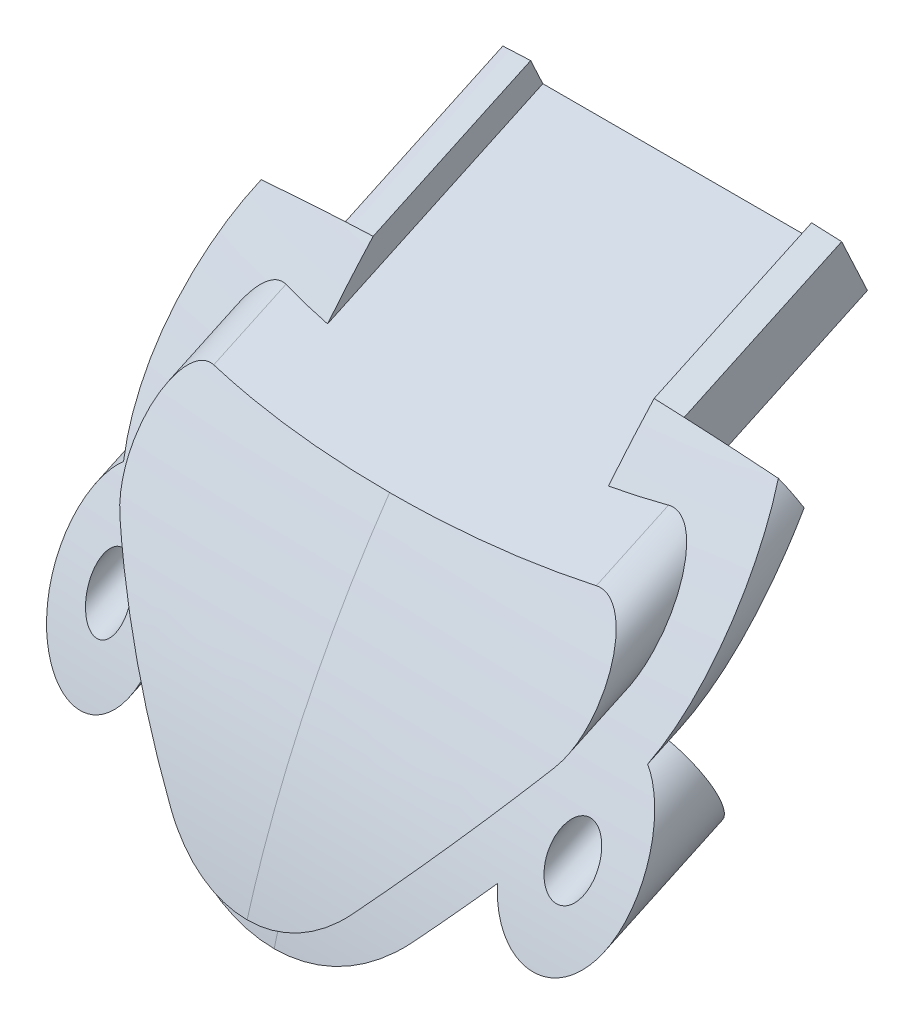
ISO-10303-21;
HEADER;
FILE_DESCRIPTION(('STEP AP214'),'2;1');
FILE_NAME('part.step','',(''),(''),'','','');
FILE_SCHEMA(('AUTOMOTIVE_DESIGN { 1 0 10303 214 1 1 1 1 }'));
ENDSEC;
DATA;
#1=APPLICATION_CONTEXT('core data for automotive mechanical design processes');
#2=APPLICATION_PROTOCOL_DEFINITION('international standard','automotive_design',2000,#1);
#3=PRODUCT_CONTEXT('',#1,'mechanical');
#4=PRODUCT('Part','Part','',(#3));
#5=PRODUCT_RELATED_PRODUCT_CATEGORY('part','',(#4));
#6=PRODUCT_DEFINITION_FORMATION('','',#4);
#7=PRODUCT_DEFINITION_CONTEXT('part definition',#1,'design');
#8=PRODUCT_DEFINITION('design','',#6,#7);
#9=PRODUCT_DEFINITION_SHAPE('','',#8);
#10=(LENGTH_UNIT() NAMED_UNIT(*) SI_UNIT(.MILLI.,.METRE.));
#11=(NAMED_UNIT(*) PLANE_ANGLE_UNIT() SI_UNIT($,.RADIAN.));
#12=(NAMED_UNIT(*) SI_UNIT($,.STERADIAN.) SOLID_ANGLE_UNIT());
#13=UNCERTAINTY_MEASURE_WITH_UNIT(LENGTH_MEASURE(1.E-05),#10,'distance_accuracy_value','');
#14=(GEOMETRIC_REPRESENTATION_CONTEXT(3) GLOBAL_UNCERTAINTY_ASSIGNED_CONTEXT((#13)) GLOBAL_UNIT_ASSIGNED_CONTEXT((#10,
#11,#12)) REPRESENTATION_CONTEXT('',''));
#15=CARTESIAN_POINT('',(0.,0.,0.));
#16=DIRECTION('',(0.,0.,1.));
#17=DIRECTION('',(1.,0.,0.));
#18=AXIS2_PLACEMENT_3D('',#15,#16,#17);
#19=CARTESIAN_POINT('',(0.,-12.67854785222,27.1892336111));
#20=DIRECTION('',(0.,0.422618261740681,-0.906307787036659));
#21=DIRECTION('',(0.,0.906307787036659,0.422618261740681));
#22=AXIS2_PLACEMENT_3D('',#19,#20,#21);
#23=PLANE('',#22);
#24=CARTESIAN_POINT('',(6.82749258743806,22.3788733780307,43.5367776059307));
#25=CARTESIAN_POINT('',(6.93608677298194,22.3681125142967,43.5317597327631));
#26=CARTESIAN_POINT('',(7.04464528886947,22.3570555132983,43.5266037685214));
#27=CARTESIAN_POINT('',(7.26167755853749,22.3343429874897,43.5160127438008));
#28=CARTESIAN_POINT('',(7.3701513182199,22.3226875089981,43.5105777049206));
#29=CARTESIAN_POINT('',(7.58701313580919,22.2987705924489,43.4994250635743));
#30=CARTESIAN_POINT('',(7.69540119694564,22.2865091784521,43.4937074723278));
#31=CARTESIAN_POINT('',(7.91209083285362,22.2613728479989,43.4819862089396));
#32=CARTESIAN_POINT('',(8.02039240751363,22.2484979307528,43.4759825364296));
#33=CARTESIAN_POINT('',(8.23690771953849,22.2221270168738,43.4636855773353));
#34=CARTESIAN_POINT('',(8.34512145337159,22.2086309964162,43.4573922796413));
#35=CARTESIAN_POINT('',(8.56145988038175,22.1810101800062,43.4445124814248));
#36=CARTESIAN_POINT('',(8.66958456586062,22.1668853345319,43.4379259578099));
#37=CARTESIAN_POINT('',(8.77765766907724,22.1524430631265,43.4311914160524));
#38=B_SPLINE_CURVE_WITH_KNOTS('',3,(#24,#25,#26,#27,#28,#29,#30,#31,#32,#33,#34,#35,#36,#37),
.UNSPECIFIED.,.F.,.F.,(4,2,2,2,2,2,4),(0.,0.327723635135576,0.655421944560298,0.98310725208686,
1.31079298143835,1.63849129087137,1.96621545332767),.UNSPECIFIED.);
#39=CARTESIAN_POINT('',(6.82749258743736,22.3788733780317,43.5367776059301));
#40=VERTEX_POINT('',#39);
#41=CARTESIAN_POINT('',(8.77765766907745,22.1524430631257,43.4311914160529));
#42=VERTEX_POINT('',#41);
#43=EDGE_CURVE('E24',#40,#42,#38,.T.);
#44=ORIENTED_EDGE('',*,*,#43,.T.);
#45=CARTESIAN_POINT('',(6.604566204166,24.0269175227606,44.3052732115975));
#46=DIRECTION('',(0.,-0.422618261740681,0.906307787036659));
#47=DIRECTION('',(0.,-0.906307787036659,-0.422618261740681));
#48=AXIS2_PLACEMENT_3D('',#45,#46,#47);
#49=CIRCLE('',#48,3.);
#50=CARTESIAN_POINT('',(9.04922814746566,22.4509767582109,43.5703999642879));
#51=VERTEX_POINT('',#50);
#52=EDGE_CURVE('E211',#51,#42,#49,.F.);
#53=ORIENTED_EDGE('',*,*,#52,.F.);
#54=CARTESIAN_POINT('',(8.,20.8548402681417,42.8261092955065));
#55=DIRECTION('',(0.,0.422618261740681,-0.906307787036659));
#56=DIRECTION('',(0.,0.906307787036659,0.422618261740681));
#57=AXIS2_PLACEMENT_3D('',#54,#55,#56);
#58=CIRCLE('',#57,2.05);
#59=EDGE_CURVE('E203',#40,#51,#58,.F.);
#60=ORIENTED_EDGE('',*,*,#59,.F.);
#61=EDGE_LOOP('',(#44,#53,#60));
#62=FACE_BOUND('',#61,.T.);
#63=CARTESIAN_POINT('',(8.,20.85484026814,42.82610929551));
#64=DIRECTION('',(0.,0.422618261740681,-0.906307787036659));
#65=DIRECTION('',(0.,0.906307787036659,0.422618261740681));
#66=AXIS2_PLACEMENT_3D('',#63,#64,#65);
#67=CIRCLE('',#66,0.754999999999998);
#68=CARTESIAN_POINT('',(8.,21.5391026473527,43.1451860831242));
#69=VERTEX_POINT('',#68);
#70=EDGE_CURVE('E818',#69,#69,#67,.F.);
#71=ORIENTED_EDGE('',*,*,#70,.T.);
#72=EDGE_LOOP('',(#71));
#73=FACE_BOUND('',#72,.T.);
#74=ADVANCED_FACE('F17',(#62,#73),#23,.T.);
#75=CARTESIAN_POINT('',(-0.07664210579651,28.58287381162,39.24971410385));
#76=CARTESIAN_POINT('',(3.152522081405,28.36996880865,39.44941635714));
#77=CARTESIAN_POINT('',(6.412730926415,28.02548152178,39.43914821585));
#78=CARTESIAN_POINT('',(9.55569913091,27.54262926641,39.18213003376));
#79=CARTESIAN_POINT('',(9.630052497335,27.5311187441,39.17590566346));
#80=CARTESIAN_POINT('',(-0.07717866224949,27.15738141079,40.55548172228));
#81=CARTESIAN_POINT('',(3.174677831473,26.92713457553,40.75210156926));
#82=CARTESIAN_POINT('',(6.449121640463,26.58149938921,40.7436714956));
#83=CARTESIAN_POINT('',(9.599305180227,26.11202367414,40.48853844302));
#84=CARTESIAN_POINT('',(9.673825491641,26.10083799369,40.48235865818));
#85=CARTESIAN_POINT('',(-0.07858301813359,23.44431056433,43.49354434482));
#86=CARTESIAN_POINT('',(3.232648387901,23.18286313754,43.66358539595));
#87=CARTESIAN_POINT('',(6.544330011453,22.84394695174,43.64848158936));
#88=CARTESIAN_POINT('',(9.713425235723,22.41470367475,43.39374460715));
#89=CARTESIAN_POINT('',(9.788383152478,22.40448934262,43.38757795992));
#90=CARTESIAN_POINT('',(-0.08023273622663,18.62262452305,45.96305880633));
#91=CARTESIAN_POINT('',(3.300649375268,18.39539739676,46.05611325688));
#92=CARTESIAN_POINT('',(6.655624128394,18.11333753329,45.99898311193));
#93=CARTESIAN_POINT('',(9.847058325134,17.76175640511,45.72354292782));
#94=CARTESIAN_POINT('',(9.922533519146,17.75339262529,45.71689782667));
#95=CARTESIAN_POINT('',(-0.08108046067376,15.17633314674,47.05424845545));
#96=CARTESIAN_POINT('',(3.335572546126,15.00955358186,47.1062405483));
#97=CARTESIAN_POINT('',(6.711012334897,14.79077624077,47.02031905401));
#98=CARTESIAN_POINT('',(9.913005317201,14.50744305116,46.72593564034));
#99=CARTESIAN_POINT('',(9.988725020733,14.50069805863,46.71884747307));
#100=CARTESIAN_POINT('',(-0.08127976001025,14.28541341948,47.29517672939));
#101=CARTESIAN_POINT('',(3.343782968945,14.13570354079,47.33796058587));
#102=CARTESIAN_POINT('',(6.723858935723,13.93419015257,47.24505801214));
#103=CARTESIAN_POINT('',(9.92821010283,13.66898501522,46.94579207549));
#104=CARTESIAN_POINT('',(10.00398438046,13.66266975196,46.93858946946));
#105=B_SPLINE_SURFACE_WITH_KNOTS('',3,3,((#75,#76,#77,#78,#79),(#80,#81,#82,#83,#84),(#85,#86,
#87,#88,#89),(#90,#91,#92,#93,#94),(#95,#96,#97,#98,#99),(#100,#101,#102,#103,#104)),
.UNSPECIFIED.,.F.,.F.,.F.,(4,1,1,4),(4,1,4),(0.293095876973,0.375,0.5,0.5426598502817),
(-0.001331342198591,0.1669196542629,0.1710001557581),.UNSPECIFIED.);
#106=CARTESIAN_POINT('',(6.12173898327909,18.6811154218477,45.5441691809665));
#107=CARTESIAN_POINT('',(6.09918602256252,18.7518830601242,45.5144992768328));
#108=CARTESIAN_POINT('',(6.07908864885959,18.8231138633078,45.4841318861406));
#109=CARTESIAN_POINT('',(6.04355086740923,18.9660680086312,45.4221984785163));
#110=CARTESIAN_POINT('',(6.02810271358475,19.0377903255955,45.390634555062));
#111=CARTESIAN_POINT('',(6.00154123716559,19.181501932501,45.3264178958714));
#112=CARTESIAN_POINT('',(5.9904260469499,19.2534910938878,45.2937656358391));
#113=CARTESIAN_POINT('',(5.97226860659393,19.3976577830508,45.2274150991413));
#114=CARTESIAN_POINT('',(5.96523380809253,19.4698354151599,45.1937150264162));
#115=CARTESIAN_POINT('',(5.95506070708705,19.6140751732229,45.1254124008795));
#116=CARTESIAN_POINT('',(5.95192413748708,19.6861372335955,45.0908094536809));
#117=CARTESIAN_POINT('',(5.94938118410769,19.8299504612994,45.0208002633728));
#118=CARTESIAN_POINT('',(5.94997575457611,19.9017015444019,44.9853938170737));
#119=CARTESIAN_POINT('',(5.95692281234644,20.1097546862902,44.8813427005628));
#120=CARTESIAN_POINT('',(5.96801805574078,20.2454457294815,44.811740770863));
#121=CARTESIAN_POINT('',(6.00257173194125,20.5141308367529,44.6704536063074));
#122=CARTESIAN_POINT('',(6.02603204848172,20.6471244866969,44.5987680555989));
#123=CARTESIAN_POINT('',(6.08495741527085,20.9094344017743,44.4538733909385));
#124=CARTESIAN_POINT('',(6.12041293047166,21.0387534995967,44.3806655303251));
#125=CARTESIAN_POINT('',(6.20336350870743,21.2928572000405,44.2332284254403));
#126=CARTESIAN_POINT('',(6.25085509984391,21.41764309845,44.1589994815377));
#127=CARTESIAN_POINT('',(6.33788822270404,21.615094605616,44.0385183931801));
#128=CARTESIAN_POINT('',(6.3735829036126,21.6895315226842,43.9923639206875));
#129=CARTESIAN_POINT('',(6.44997562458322,21.8358073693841,43.9001585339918));
#130=CARTESIAN_POINT('',(6.49067097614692,21.9076476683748,43.8541075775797));
#131=CARTESIAN_POINT('',(6.5773152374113,22.0482200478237,43.7624079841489));
#132=CARTESIAN_POINT('',(6.62325750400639,22.1169559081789,43.7167589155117));
#133=CARTESIAN_POINT('',(6.72093003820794,22.2508192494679,43.6261424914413));
#134=CARTESIAN_POINT('',(6.77266746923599,22.3159421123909,43.5811760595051));
#135=CARTESIAN_POINT('',(6.8274925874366,22.3788733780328,43.5367776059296));
#136=B_SPLINE_CURVE_WITH_KNOTS('',3,(#106,#107,#108,#109,#110,#111,#112,#113,#114,#115,#116,
#117,#118,#119,#120,#121,#122,#123,#124,#125,#126,#127,#128,#129,#130,#131,#132,#133,#134,#135),
.UNSPECIFIED.,.F.,.F.,(4,2,2,2,2,2,2,2,2,2,2,2,2,2,4),(0.,0.239866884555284,0.479331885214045,
0.718693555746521,0.958490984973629,1.19839497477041,1.43836032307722,1.8964588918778,
2.35462726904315,2.81243229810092,3.27010541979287,3.55369880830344,3.83714039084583,
4.12022700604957,4.40366748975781),.UNSPECIFIED.);
#137=CARTESIAN_POINT('',(6.12173898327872,18.6811154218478,45.5441691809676));
#138=VERTEX_POINT('',#137);
#139=EDGE_CURVE('E193',#138,#40,#136,.T.);
#140=CARTESIAN_POINT('',(6.12173898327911,18.681115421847,45.5441691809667));
#141=CARTESIAN_POINT('',(6.04370254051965,18.5865559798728,45.5920128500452));
#142=CARTESIAN_POINT('',(5.96525962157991,18.4919618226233,45.6391239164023));
#143=CARTESIAN_POINT('',(5.80762019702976,18.3027611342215,45.731876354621));
#144=CARTESIAN_POINT('',(5.72842403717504,18.2081546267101,45.7775183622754));
#145=CARTESIAN_POINT('',(5.56929148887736,18.0189300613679,45.8673574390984));
#146=CARTESIAN_POINT('',(5.4893553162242,17.9243120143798,45.9115549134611));
#147=CARTESIAN_POINT('',(5.32875592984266,17.7350650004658,45.9985297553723));
#148=CARTESIAN_POINT('',(5.24809281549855,17.6404360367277,46.0413073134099));
#149=CARTESIAN_POINT('',(5.08605457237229,17.451170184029,46.1254657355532));
#150=CARTESIAN_POINT('',(5.00467945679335,17.3565332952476,46.1668466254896));
#151=CARTESIAN_POINT('',(4.84122724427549,17.1672489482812,46.2482373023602));
#152=CARTESIAN_POINT('',(4.75915004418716,17.0726014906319,46.2882468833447));
#153=CARTESIAN_POINT('',(4.5943055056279,16.8832957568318,46.3669189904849));
#154=CARTESIAN_POINT('',(4.51153797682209,16.7886374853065,46.4055811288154));
#155=CARTESIAN_POINT('',(4.34532403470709,16.5993097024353,46.4815815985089));
#156=CARTESIAN_POINT('',(4.26187735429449,16.5046402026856,46.5189193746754));
#157=CARTESIAN_POINT('',(4.17811946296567,16.4099905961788,46.5555965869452));
#158=B_SPLINE_CURVE_WITH_KNOTS('',3,(#140,#141,#142,#143,#144,#145,#146,#147,#148,#149,#150,
#151,#152,#153,#154,#155,#156,#157),.UNSPECIFIED.,.F.,.F.,(4,2,2,2,2,2,2,2,4),(0.,
0.394815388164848,0.789457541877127,1.18398803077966,1.57846537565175,1.97293542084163,
2.36746445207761,2.76210611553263,3.15691131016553),.UNSPECIFIED.);
#159=CARTESIAN_POINT('',(4.17811946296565,16.4099905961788,46.5555965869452));
#160=VERTEX_POINT('',#159);
#161=EDGE_CURVE('E223',#138,#160,#158,.T.);
#162=CARTESIAN_POINT('',(-1.16399335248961E-07,14.40199616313,47.2634454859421));
#163=CARTESIAN_POINT('',(0.146002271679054,14.4019563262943,47.2634502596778));
#164=CARTESIAN_POINT('',(0.291990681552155,14.4083607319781,47.2614329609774));
#165=CARTESIAN_POINT('',(0.582687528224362,14.4337715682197,47.2533721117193));
#166=CARTESIAN_POINT('',(0.727396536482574,14.4527720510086,47.2473304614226));
#167=CARTESIAN_POINT('',(1.01325099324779,14.502883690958,47.2313044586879));
#168=CARTESIAN_POINT('',(1.15441588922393,14.5338947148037,47.2213526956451));
#169=CARTESIAN_POINT('',(1.4333530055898,14.6075098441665,47.197553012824));
#170=CARTESIAN_POINT('',(1.57112504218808,14.6501145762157,47.1837048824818));
#171=CARTESIAN_POINT('',(1.84212369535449,14.7461702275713,47.152206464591));
#172=CARTESIAN_POINT('',(1.97535724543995,14.7996036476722,47.1345623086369));
#173=CARTESIAN_POINT('',(2.23679132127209,14.916592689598,47.0955389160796));
#174=CARTESIAN_POINT('',(2.36498965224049,14.9801526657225,47.0741580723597));
#175=CARTESIAN_POINT('',(2.61598573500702,15.116681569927,47.0277112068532));
#176=CARTESIAN_POINT('',(2.73876950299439,15.189673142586,47.0026362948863));
#177=CARTESIAN_POINT('',(2.97815027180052,15.3440318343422,46.9489557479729));
#178=CARTESIAN_POINT('',(3.09474566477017,15.4254011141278,46.9203492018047));
#179=CARTESIAN_POINT('',(3.38671081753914,15.6446389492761,46.8422560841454));
#180=CARTESIAN_POINT('',(3.5572817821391,15.7880698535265,46.7902286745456));
#181=CARTESIAN_POINT('',(3.80001036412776,16.0140213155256,46.7063904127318));
#182=CARTESIAN_POINT('',(3.87856120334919,16.0909443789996,46.6775532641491));
#183=CARTESIAN_POINT('',(4.03146473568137,16.2480812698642,46.6179851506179));
#184=CARTESIAN_POINT('',(4.10581944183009,16.3282934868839,46.5872551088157));
#185=CARTESIAN_POINT('',(4.17811946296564,16.4099905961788,46.5555965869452));
#186=B_SPLINE_CURVE_WITH_KNOTS('',3,(#162,#163,#164,#165,#166,#167,#168,#169,#170,#171,#172,
#173,#174,#175,#176,#177,#178,#179,#180,#181,#182,#183,#184,#185),.UNSPECIFIED.,.F.,.F.,(4,2,2,
2,2,2,2,2,2,2,2,4),(0.,0.437830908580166,0.875455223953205,1.30950693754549,1.7435821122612,
2.17696133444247,2.6105274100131,3.04515449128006,3.47989394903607,4.16486642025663,
4.50574110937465,4.84645085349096),.UNSPECIFIED.);
#187=CARTESIAN_POINT('',(-1.1639933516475E-07,14.4019961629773,47.2634454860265));
#188=VERTEX_POINT('',#187);
#189=EDGE_CURVE('E694',#188,#160,#186,.T.);
#190=CARTESIAN_POINT('',(4.97640362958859E-07,28.5777969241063,39.2544150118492));
#191=CARTESIAN_POINT('',(6.00197103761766E-08,27.1518959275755,40.5601103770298));
#192=CARTESIAN_POINT('',(-6.39245199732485E-07,23.438091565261,43.4975458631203));
#193=CARTESIAN_POINT('',(9.27017898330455E-07,18.6172218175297,45.9652396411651));
#194=CARTESIAN_POINT('',(2.52424057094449E-06,15.1723655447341,47.055457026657));
#195=CARTESIAN_POINT('',(2.93143578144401E-06,14.2818509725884,47.2961671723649));
#196=B_SPLINE_CURVE_WITH_KNOTS('',3,(#190,#191,#192,#193,#194,#195),.UNSPECIFIED.,.F.,.F.,(4,1,
1,4),(0.2930958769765,0.375,0.5,0.5426598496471),.UNSPECIFIED.);
#197=CARTESIAN_POINT('',(-1.45533286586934E-07,25.3707336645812,41.8966905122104));
#198=VERTEX_POINT('',#197);
#199=EDGE_CURVE('E792',#198,#188,#196,.T.);
#200=CARTESIAN_POINT('',(5.84999999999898,25.5880023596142,41.4307562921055));
#201=CARTESIAN_POINT('',(5.60998489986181,25.568930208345,41.4716566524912));
#202=CARTESIAN_POINT('',(5.3693639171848,25.5512586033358,41.5095535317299));
#203=CARTESIAN_POINT('',(4.88712220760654,25.5185985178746,41.579593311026));
#204=CARTESIAN_POINT('',(4.64550155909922,25.5036098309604,41.6117366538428));
#205=CARTESIAN_POINT('',(3.92045136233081,25.462546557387,41.6997971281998));
#206=CARTESIAN_POINT('',(3.43579184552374,25.4402931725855,41.7475196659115));
#207=CARTESIAN_POINT('',(2.46022739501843,25.4049969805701,41.823212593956));
#208=CARTESIAN_POINT('',(1.96930558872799,25.3920391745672,41.8510006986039));
#209=CARTESIAN_POINT('',(1.23178798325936,25.3791995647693,41.8785353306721));
#210=CARTESIAN_POINT('',(0.985486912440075,25.3760193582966,41.8853553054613));
#211=CARTESIAN_POINT('',(0.492791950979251,25.3717943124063,41.8944159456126));
#212=CARTESIAN_POINT('',(0.246398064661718,25.3707493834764,41.8966568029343));
#213=CARTESIAN_POINT('',(-1.4553328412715E-07,25.3707336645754,41.8966905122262));
#214=B_SPLINE_CURVE_WITH_KNOTS('',3,(#200,#201,#202,#203,#204,#205,#206,#207,#208,#209,#210,
#211,#212,#213),.UNSPECIFIED.,.F.,.F.,(4,2,2,2,2,2,4),(0.,0.732610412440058,1.46516442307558,
2.92709789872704,4.40223493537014,5.14143847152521,5.8806110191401),.UNSPECIFIED.);
#215=CARTESIAN_POINT('',(5.85,25.5880023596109,41.4307562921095));
#216=VERTEX_POINT('',#215);
#217=EDGE_CURVE('E327',#216,#198,#214,.T.);
#218=CARTESIAN_POINT('',(5.85,27.9091379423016,39.4953148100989));
#219=CARTESIAN_POINT('',(5.85,27.815527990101,39.5796499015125));
#220=CARTESIAN_POINT('',(5.85,27.7215265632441,39.6635506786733));
#221=CARTESIAN_POINT('',(5.85,27.5327662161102,39.8304425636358));
#222=CARTESIAN_POINT('',(5.85,27.4380075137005,39.913433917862));
#223=CARTESIAN_POINT('',(5.85,27.2477240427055,40.0784971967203));
#224=CARTESIAN_POINT('',(5.85,27.1521994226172,40.1605692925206));
#225=CARTESIAN_POINT('',(5.85,26.9603754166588,40.323783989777));
#226=CARTESIAN_POINT('',(5.85,26.8640761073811,40.404926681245));
#227=CARTESIAN_POINT('',(5.85,26.6706927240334,40.5662731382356));
#228=CARTESIAN_POINT('',(5.85,26.5736086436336,40.646476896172));
#229=CARTESIAN_POINT('',(5.85,26.378647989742,40.8059336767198));
#230=CARTESIAN_POINT('',(5.85,26.280771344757,40.8851866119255));
#231=CARTESIAN_POINT('',(5.85,26.0842165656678,41.0427305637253));
#232=CARTESIAN_POINT('',(5.85,25.9855382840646,41.1210213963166));
#233=CARTESIAN_POINT('',(5.85,25.7873711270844,41.2766296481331));
#234=CARTESIAN_POINT('',(5.85,25.6878820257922,41.3539467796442));
#235=CARTESIAN_POINT('',(5.85,25.58800235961,41.4307562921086));
#236=B_SPLINE_CURVE_WITH_KNOTS('',3,(#218,#219,#220,#221,#222,#223,#224,#225,#226,#227,#228,
#229,#230,#231,#232,#233,#234,#235),.UNSPECIFIED.,.F.,.F.,(4,2,2,2,2,2,2,2,4),(0.,
0.377989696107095,0.755874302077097,1.13368733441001,1.51146346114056,1.88924263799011,
2.26705628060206,2.64494108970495,3.02293505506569),.UNSPECIFIED.);
#237=CARTESIAN_POINT('',(5.85000000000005,27.9091379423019,39.4953148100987));
#238=VERTEX_POINT('',#237);
#239=EDGE_CURVE('E293',#238,#216,#236,.T.);
#240=CARTESIAN_POINT('',(5.8500000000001,27.9091379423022,39.4953148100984));
#241=CARTESIAN_POINT('',(6.00016325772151,27.8951297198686,39.4887826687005));
#242=CARTESIAN_POINT('',(6.15026068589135,27.8805407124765,39.4819797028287));
#243=CARTESIAN_POINT('',(6.45027607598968,27.8501934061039,39.4678285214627));
#244=CARTESIAN_POINT('',(6.60019407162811,27.8344353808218,39.4604804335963));
#245=CARTESIAN_POINT('',(6.89984912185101,27.8017383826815,39.4452335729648));
#246=CARTESIAN_POINT('',(7.04958620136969,27.7847995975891,39.4373348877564));
#247=CARTESIAN_POINT('',(7.34887782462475,27.7497292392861,39.4209813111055));
#248=CARTESIAN_POINT('',(7.49843238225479,27.7315977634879,39.4125264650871));
#249=CARTESIAN_POINT('',(7.79735858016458,27.6941297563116,39.395054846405));
#250=CARTESIAN_POINT('',(7.94673021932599,27.6747932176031,39.386038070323));
#251=CARTESIAN_POINT('',(8.24528723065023,27.6349028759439,39.3674368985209));
#252=CARTESIAN_POINT('',(8.39447258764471,27.6143489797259,39.3578524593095));
#253=CARTESIAN_POINT('',(8.69265486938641,27.5720112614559,39.3381100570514));
#254=CARTESIAN_POINT('',(8.84165176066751,27.5502272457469,39.3279520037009));
#255=CARTESIAN_POINT('',(9.13945478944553,27.5054163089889,39.3070563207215));
#256=CARTESIAN_POINT('',(9.28826087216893,27.4823890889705,39.296318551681));
#257=CARTESIAN_POINT('',(9.43694619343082,27.4587375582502,39.285289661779));
#258=B_SPLINE_CURVE_WITH_KNOTS('',3,(#240,#241,#242,#243,#244,#245,#246,#247,#248,#249,#250,
#251,#252,#253,#254,#255,#256,#257),.UNSPECIFIED.,.F.,.F.,(4,2,2,2,2,2,2,2,4),(0.,
0.452868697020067,0.905631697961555,1.35832286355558,1.81097710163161,2.26363409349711,
2.71632581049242,3.16908899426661,3.62196154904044),.UNSPECIFIED.);
#259=CARTESIAN_POINT('',(9.43694619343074,27.4587375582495,39.2852896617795));
#260=VERTEX_POINT('',#259);
#261=EDGE_CURVE('E272',#238,#260,#258,.T.);
#262=CARTESIAN_POINT('',(8.77765766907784,22.1524430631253,43.4311914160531));
#263=CARTESIAN_POINT('',(8.8230543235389,22.2306070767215,43.376478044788));
#264=CARTESIAN_POINT('',(8.86593481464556,22.3096470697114,43.3209794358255));
#265=CARTESIAN_POINT('',(8.94693504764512,22.4689201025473,43.2087199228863));
#266=CARTESIAN_POINT('',(8.98506621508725,22.5491497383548,43.1519624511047));
#267=CARTESIAN_POINT('',(9.05701997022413,22.7105438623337,43.0372846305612));
#268=CARTESIAN_POINT('',(9.09084713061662,22.7917072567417,42.9793655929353));
#269=CARTESIAN_POINT('',(9.15454893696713,22.9547679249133,42.8624474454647));
#270=CARTESIAN_POINT('',(9.18442448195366,23.0366650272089,42.8034485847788));
#271=CARTESIAN_POINT('',(9.24009303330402,23.1997570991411,42.6853603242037));
#272=CARTESIAN_POINT('',(9.26594061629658,23.280944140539,42.6262855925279));
#273=CARTESIAN_POINT('',(9.3143334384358,23.4437041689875,42.5072395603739));
#274=CARTESIAN_POINT('',(9.33687708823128,23.5252773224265,42.4472678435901));
#275=CARTESIAN_POINT('',(9.3788675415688,23.6886644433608,42.3265056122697));
#276=CARTESIAN_POINT('',(9.39831310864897,23.7704784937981,42.2657147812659));
#277=CARTESIAN_POINT('',(9.4342856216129,23.9342086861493,42.1433960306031));
#278=CARTESIAN_POINT('',(9.45081221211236,24.016124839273,42.0818680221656));
#279=CARTESIAN_POINT('',(9.4920601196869,24.2391440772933,41.9134354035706));
#280=CARTESIAN_POINT('',(9.51407536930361,24.3802498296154,41.8058635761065));
#281=CARTESIAN_POINT('',(9.55066368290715,24.6620709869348,41.5889660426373));
#282=CARTESIAN_POINT('',(9.56523626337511,24.8027863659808,41.4796402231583));
#283=CARTESIAN_POINT('',(9.58752287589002,25.0836008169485,41.2594002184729));
#284=CARTESIAN_POINT('',(9.59523415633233,25.2236996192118,41.1484854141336));
#285=CARTESIAN_POINT('',(9.60425270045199,25.5030636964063,40.9252528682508));
#286=CARTESIAN_POINT('',(9.60555749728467,25.6423286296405,40.812934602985));
#287=CARTESIAN_POINT('',(9.60206901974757,25.9235891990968,40.584028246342));
#288=CARTESIAN_POINT('',(9.59710862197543,26.065555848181,40.4674072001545));
#289=CARTESIAN_POINT('',(9.58108709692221,26.3481973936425,40.233119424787));
#290=CARTESIAN_POINT('',(9.57002789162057,26.4888726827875,40.1154530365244));
#291=CARTESIAN_POINT('',(9.54201137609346,26.7687228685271,39.8793318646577));
#292=CARTESIAN_POINT('',(9.52506002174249,26.9078991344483,39.7608779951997));
#293=CARTESIAN_POINT('',(9.48534374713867,27.1845518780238,39.5234658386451));
#294=CARTESIAN_POINT('',(9.46258921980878,27.3220309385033,39.404508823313));
#295=CARTESIAN_POINT('',(9.43694619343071,27.4587375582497,39.2852896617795));
#296=B_SPLINE_CURVE_WITH_KNOTS('',3,(#262,#263,#264,#265,#266,#267,#268,#269,#270,#271,#272,
#273,#274,#275,#276,#277,#278,#279,#280,#281,#282,#283,#284,#285,#286,#287,#288,#289,#290,#291,
#292,#293,#294,#295),.UNSPECIFIED.,.F.,.F.,(4,2,2,2,2,2,2,2,2,2,2,2,2,2,2,2,4),(0.,
0.316904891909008,0.633032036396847,0.948820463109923,1.26453692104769,1.57551163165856,
1.88663544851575,2.1978831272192,2.50916867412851,3.04535354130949,3.58157323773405,
4.11800787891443,4.65464906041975,5.20591215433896,5.75700162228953,6.30753565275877,
6.85709056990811),.UNSPECIFIED.);
#297=EDGE_CURVE('E195',#42,#260,#296,.T.);
#298=ORIENTED_EDGE('',*,*,#43,.F.);
#299=ORIENTED_EDGE('',*,*,#139,.F.);
#300=ORIENTED_EDGE('',*,*,#161,.T.);
#301=ORIENTED_EDGE('',*,*,#189,.F.);
#302=ORIENTED_EDGE('',*,*,#199,.F.);
#303=ORIENTED_EDGE('',*,*,#217,.F.);
#304=ORIENTED_EDGE('',*,*,#239,.F.);
#305=ORIENTED_EDGE('',*,*,#261,.T.);
#306=ORIENTED_EDGE('',*,*,#297,.F.);
#307=EDGE_LOOP('',(#298,#299,#300,#301,#302,#303,#304,#305,#306));
#308=FACE_BOUND('',#307,.T.);
#309=ADVANCED_FACE('F192',(#308),#105,.F.);
#310=CARTESIAN_POINT('',(0.,-12.67854785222,27.1892336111));
#311=DIRECTION('',(0.,0.422618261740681,-0.906307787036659));
#312=DIRECTION('',(0.,0.906307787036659,0.422618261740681));
#313=AXIS2_PLACEMENT_3D('',#310,#311,#312);
#314=PLANE('',#313);
#315=CARTESIAN_POINT('',(-6.82749258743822,22.378873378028,43.5367776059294));
#316=CARTESIAN_POINT('',(-6.93608677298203,22.3681125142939,43.5317597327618));
#317=CARTESIAN_POINT('',(-7.04464528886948,22.3570555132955,43.52660376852));
#318=CARTESIAN_POINT('',(-7.26167755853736,22.3343429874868,43.5160127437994));
#319=CARTESIAN_POINT('',(-7.3701513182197,22.3226875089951,43.5105777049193));
#320=CARTESIAN_POINT('',(-7.58701313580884,22.2987705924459,43.4994250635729));
#321=CARTESIAN_POINT('',(-7.69540119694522,22.2865091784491,43.4937074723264));
#322=CARTESIAN_POINT('',(-7.91209083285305,22.2613728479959,43.4819862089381));
#323=CARTESIAN_POINT('',(-8.02039240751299,22.2484979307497,43.4759825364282));
#324=CARTESIAN_POINT('',(-8.23690771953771,22.2221270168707,43.4636855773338));
#325=CARTESIAN_POINT('',(-8.34512145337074,22.2086309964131,43.4573922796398));
#326=CARTESIAN_POINT('',(-8.56145988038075,22.181010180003,43.4445124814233));
#327=CARTESIAN_POINT('',(-8.66958456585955,22.1668853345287,43.4379259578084));
#328=CARTESIAN_POINT('',(-8.7776576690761,22.1524430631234,43.4311914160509));
#329=B_SPLINE_CURVE_WITH_KNOTS('',3,(#315,#316,#317,#318,#319,#320,#321,#322,#323,#324,#325,
#326,#327,#328),.UNSPECIFIED.,.F.,.F.,(4,2,2,2,2,2,4),(0.,0.327723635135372,0.655421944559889,
0.983107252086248,1.31079298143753,1.63849129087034,1.96621545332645),.UNSPECIFIED.);
#330=CARTESIAN_POINT('',(-6.82749258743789,22.3788733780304,43.5367776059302));
#331=VERTEX_POINT('',#330);
#332=CARTESIAN_POINT('',(-8.77765766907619,22.1524430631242,43.4311914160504));
#333=VERTEX_POINT('',#332);
#334=EDGE_CURVE('E300',#331,#333,#329,.T.);
#335=ORIENTED_EDGE('',*,*,#334,.F.);
#336=CARTESIAN_POINT('',(-8.,20.8548402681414,42.826109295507));
#337=DIRECTION('',(0.,0.422618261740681,-0.906307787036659));
#338=DIRECTION('',(0.,0.906307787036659,0.422618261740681));
#339=AXIS2_PLACEMENT_3D('',#336,#337,#338);
#340=CIRCLE('',#339,2.05);
#341=CARTESIAN_POINT('',(-9.04922814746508,22.4509767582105,43.570399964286));
#342=VERTEX_POINT('',#341);
#343=EDGE_CURVE('E686',#342,#331,#340,.F.);
#344=ORIENTED_EDGE('',*,*,#343,.F.);
#345=CARTESIAN_POINT('',(-6.604566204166,24.026917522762,44.3052732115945));
#346=DIRECTION('',(0.,-0.422618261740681,0.906307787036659));
#347=DIRECTION('',(0.,-0.906307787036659,-0.422618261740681));
#348=AXIS2_PLACEMENT_3D('',#345,#346,#347);
#349=CIRCLE('',#348,3.);
#350=EDGE_CURVE('E198',#342,#333,#349,.T.);
#351=ORIENTED_EDGE('',*,*,#350,.T.);
#352=EDGE_LOOP('',(#335,#344,#351));
#353=FACE_BOUND('',#352,.T.);
#354=CARTESIAN_POINT('',(-8.,20.85484026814,42.82610929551));
#355=DIRECTION('',(0.,0.422618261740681,-0.906307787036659));
#356=DIRECTION('',(0.,0.906307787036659,0.422618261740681));
#357=AXIS2_PLACEMENT_3D('',#354,#355,#356);
#358=CIRCLE('',#357,0.754999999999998);
#359=CARTESIAN_POINT('',(-8.,21.5391026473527,43.1451860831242));
#360=VERTEX_POINT('',#359);
#361=EDGE_CURVE('E212',#360,#360,#358,.F.);
#362=ORIENTED_EDGE('',*,*,#361,.T.);
#363=EDGE_LOOP('',(#362));
#364=FACE_BOUND('',#363,.T.);
#365=ADVANCED_FACE('F237',(#353,#364),#314,.T.);
#366=CARTESIAN_POINT('',(0.07663530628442,28.58287336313,39.24971452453));
#367=CARTESIAN_POINT('',(-3.15252654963,28.36996833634,39.44941634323));
#368=CARTESIAN_POINT('',(-6.41246078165,28.02550996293,39.43914889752));
#369=CARTESIAN_POINT('',(-9.555174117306,27.54270992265,39.18217296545));
#370=CARTESIAN_POINT('',(-9.629265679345,27.53124054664,39.17597152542));
#371=CARTESIAN_POINT('',(-9.66066483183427,27.5263799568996,39.1733434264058));
#372=CARTESIAN_POINT('',(-9.69206398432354,27.5215193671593,39.1707153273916));
#373=CARTESIAN_POINT('',(-9.72346313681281,27.5166587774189,39.1680872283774));
#374=CARTESIAN_POINT('',(0.07717181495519,27.15738092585,40.55548213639));
#375=CARTESIAN_POINT('',(-3.174682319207,26.9271341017,40.75210155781));
#376=CARTESIAN_POINT('',(-6.448850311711,26.58152793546,40.74367202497));
#377=CARTESIAN_POINT('',(-9.598778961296,26.11210209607,40.48858105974));
#378=CARTESIAN_POINT('',(-9.673036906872,26.10095635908,40.48242404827));
#379=CARTESIAN_POINT('',(-9.70450657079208,26.0962329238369,40.4798147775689));
#380=CARTESIAN_POINT('',(-9.73597623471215,26.0915094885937,40.4772055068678));
#381=CARTESIAN_POINT('',(-9.76744589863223,26.0867860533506,40.4745962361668));
#382=CARTESIAN_POINT('',(0.07857604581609,23.44431001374,43.4935447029));
#383=CARTESIAN_POINT('',(-3.232652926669,23.18286267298,43.66358537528));
#384=CARTESIAN_POINT('',(-6.544055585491,22.84397496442,43.64848267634));
#385=CARTESIAN_POINT('',(-9.712895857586,22.4147753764,43.3937871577));
#386=CARTESIAN_POINT('',(-9.787589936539,22.40459742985,43.38764321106));
#387=CARTESIAN_POINT('',(-9.81924442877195,22.4002841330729,43.3850394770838));
#388=CARTESIAN_POINT('',(-9.85089892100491,22.3959708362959,43.3824357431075));
#389=CARTESIAN_POINT('',(-9.88255341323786,22.3916575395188,43.3798320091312));
#390=CARTESIAN_POINT('',(0.08022561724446,18.62262405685,45.96305899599));
#391=CARTESIAN_POINT('',(-3.300653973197,18.39539702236,46.0561131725));
#392=CARTESIAN_POINT('',(-6.655346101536,18.11336086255,45.99898768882));
#393=CARTESIAN_POINT('',(-9.846525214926,17.76181514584,45.7235889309));
#394=CARTESIAN_POINT('',(-9.921734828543,17.7534811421,45.71696813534));
#395=CARTESIAN_POINT('',(-9.95360779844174,17.7499492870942,45.7141623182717));
#396=CARTESIAN_POINT('',(-9.98548076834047,17.7464174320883,45.7113565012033));
#397=CARTESIAN_POINT('',(-10.0173537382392,17.7428855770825,45.708550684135));
#398=CARTESIAN_POINT('',(0.08107326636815,15.17633282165,47.05424855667));
#399=CARTESIAN_POINT('',(-3.335577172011,15.00955330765,47.10624042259));
#400=CARTESIAN_POINT('',(-6.710732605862,14.79079434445,47.02032602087));
#401=CARTESIAN_POINT('',(-9.912470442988,14.50749040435,46.72598480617));
#402=CARTESIAN_POINT('',(-9.987923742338,14.50076945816,46.71892246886));
#403=CARTESIAN_POINT('',(-10.0198999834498,14.4979211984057,46.7159295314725));
#404=CARTESIAN_POINT('',(-10.0518762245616,14.4950729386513,46.7129365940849));
#405=CARTESIAN_POINT('',(-10.0838524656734,14.492224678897,46.7099436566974));
#406=CARTESIAN_POINT('',(0.08127254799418,14.285413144,47.29517680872));
#407=CARTESIAN_POINT('',(-3.343787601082,14.13570330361,47.3379604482));
#408=CARTESIAN_POINT('',(-6.723578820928,13.93420683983,47.24506555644));
#409=CARTESIAN_POINT('',(-9.927674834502,13.66902935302,46.94584205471));
#410=CARTESIAN_POINT('',(-10.00318252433,13.66273661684,46.93866567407));
#411=CARTESIAN_POINT('',(-10.0351818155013,13.6600698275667,46.9356244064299));
#412=CARTESIAN_POINT('',(-10.0671811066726,13.6574030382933,46.9325831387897));
#413=CARTESIAN_POINT('',(-10.0991803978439,13.65473624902,46.9295418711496));
#414=B_SPLINE_SURFACE_WITH_KNOTS('',3,3,((#366,#367,#368,#369,#370,#371,#372,#373),(#374,#375,
#376,#377,#378,#379,#380,#381),(#382,#383,#384,#385,#386,#387,#388,#389),(#390,#391,#392,#393,
#394,#395,#396,#397),(#398,#399,#400,#401,#402,#403,#404,#405),(#406,#407,#408,#409,#410,#411,
#412,#413)),.UNSPECIFIED.,.F.,.F.,.F.,(4,1,1,4),(4,1,3,4),(0.2930958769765,0.375,0.5,
0.5426598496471),(-0.001331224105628,0.1669196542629,0.1709857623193,0.172708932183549),.UNSPECIFIED.);
#415=CARTESIAN_POINT('',(-9.43694619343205,27.4587375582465,39.2852896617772));
#416=CARTESIAN_POINT('',(-9.45274792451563,27.3745500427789,39.3587056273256));
#417=CARTESIAN_POINT('',(-9.46744353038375,27.2900726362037,39.4320219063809));
#418=CARTESIAN_POINT('',(-9.49462644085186,27.1205540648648,39.5784131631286));
#419=CARTESIAN_POINT('',(-9.50711372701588,27.0355128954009,39.6514881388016));
#420=CARTESIAN_POINT('',(-9.54140207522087,26.7785701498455,39.8711410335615));
#421=CARTESIAN_POINT('',(-9.55984439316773,26.6058362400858,40.0172855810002));
#422=CARTESIAN_POINT('',(-9.58764235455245,26.2577781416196,40.3085586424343));
#423=CARTESIAN_POINT('',(-9.59696659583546,26.0824470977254,40.453681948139));
#424=CARTESIAN_POINT('',(-9.60596434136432,25.7297981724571,40.742251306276));
#425=CARTESIAN_POINT('',(-9.60562624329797,25.5524781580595,40.8856951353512));
#426=CARTESIAN_POINT('',(-9.59476717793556,25.2030301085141,41.1650668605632));
#427=CARTESIAN_POINT('',(-9.58462661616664,25.0309552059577,41.301075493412));
#428=CARTESIAN_POINT('',(-9.5538628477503,24.6860924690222,41.5705256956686));
#429=CARTESIAN_POINT('',(-9.53325401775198,24.5133059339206,41.7039705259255));
#430=CARTESIAN_POINT('',(-9.48046075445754,24.167659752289,41.9678482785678));
#431=CARTESIAN_POINT('',(-9.44829630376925,23.9948007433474,42.0982859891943));
#432=CARTESIAN_POINT('',(-9.37094185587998,23.6496811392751,42.355773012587));
#433=CARTESIAN_POINT('',(-9.32576565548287,23.4774201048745,42.4828257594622));
#434=CARTESIAN_POINT('',(-9.25311130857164,23.2408700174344,42.6554355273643));
#435=CARTESIAN_POINT('',(-9.23201762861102,23.1758321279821,42.7026976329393));
#436=CARTESIAN_POINT('',(-9.18754055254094,23.0460951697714,42.796604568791));
#437=CARTESIAN_POINT('',(-9.16415728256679,22.9813960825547,42.8432494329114));
#438=CARTESIAN_POINT('',(-9.11496938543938,22.8524530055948,42.9358615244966));
#439=CARTESIAN_POINT('',(-9.08916520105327,22.7882089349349,42.9818288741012));
#440=CARTESIAN_POINT('',(-9.03469792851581,22.6596240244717,43.0735086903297));
#441=CARTESIAN_POINT('',(-9.00600788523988,22.5952891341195,43.1192135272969));
#442=CARTESIAN_POINT('',(-8.94581976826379,22.4673380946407,43.2098162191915));
#443=CARTESIAN_POINT('',(-8.91432104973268,22.4037221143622,43.2547138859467));
#444=CARTESIAN_POINT('',(-8.84830114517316,22.2773640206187,43.3436387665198));
#445=CARTESIAN_POINT('',(-8.81377741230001,22.2146226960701,43.3876652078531));
#446=CARTESIAN_POINT('',(-8.77765766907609,22.1524430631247,43.4311914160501));
#447=B_SPLINE_CURVE_WITH_KNOTS('',3,(#415,#416,#417,#418,#419,#420,#421,#422,#423,#424,#425,
#426,#427,#428,#429,#430,#431,#432,#433,#434,#435,#436,#437,#438,#439,#440,#441,#442,#443,#444,
#445,#446),.UNSPECIFIED.,.F.,.F.,(4,2,2,2,2,2,2,2,2,2,2,2,2,2,2,4),(0.,0.338431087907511,
0.676865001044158,1.35769872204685,2.04086902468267,2.72485969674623,3.38332987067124,
4.04089816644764,4.6973347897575,5.35307791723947,5.60240530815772,5.85171897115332,
6.10098712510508,6.35284911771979,6.60476908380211,6.85690322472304),.UNSPECIFIED.);
#448=CARTESIAN_POINT('',(-9.43694619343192,27.4587375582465,39.2852896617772));
#449=VERTEX_POINT('',#448);
#450=EDGE_CURVE('E667',#449,#333,#447,.T.);
#451=CARTESIAN_POINT('',(-9.43694619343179,27.4587375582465,39.2852896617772));
#452=CARTESIAN_POINT('',(-9.2882608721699,27.4823890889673,39.2963185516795));
#453=CARTESIAN_POINT('',(-9.13945478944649,27.505416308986,39.3070563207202));
#454=CARTESIAN_POINT('',(-8.84165176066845,27.5502272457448,39.3279520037));
#455=CARTESIAN_POINT('',(-8.69265486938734,27.5720112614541,39.3381100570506));
#456=CARTESIAN_POINT('',(-8.3944725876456,27.6143489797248,39.357852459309));
#457=CARTESIAN_POINT('',(-8.24528723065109,27.6349028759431,39.3674368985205));
#458=CARTESIAN_POINT('',(-7.94673021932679,27.6747932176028,39.3860380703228));
#459=CARTESIAN_POINT('',(-7.79735858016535,27.6941297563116,39.395054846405));
#460=CARTESIAN_POINT('',(-7.49843238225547,27.7315977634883,39.4125264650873));
#461=CARTESIAN_POINT('',(-7.34887782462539,27.7497292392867,39.4209813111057));
#462=CARTESIAN_POINT('',(-7.04958620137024,27.7847995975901,39.4373348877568));
#463=CARTESIAN_POINT('',(-6.89984912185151,27.8017383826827,39.4452335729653));
#464=CARTESIAN_POINT('',(-6.6001940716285,27.8344353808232,39.460480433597));
#465=CARTESIAN_POINT('',(-6.45027607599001,27.8501934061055,39.4678285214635));
#466=CARTESIAN_POINT('',(-6.15026068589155,27.8805407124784,39.4819797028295));
#467=CARTESIAN_POINT('',(-6.00016325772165,27.8951297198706,39.4887826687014));
#468=CARTESIAN_POINT('',(-5.85000000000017,27.9091379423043,39.4953148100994));
#469=B_SPLINE_CURVE_WITH_KNOTS('',3,(#451,#452,#453,#454,#455,#456,#457,#458,#459,#460,#461,
#462,#463,#464,#465,#466,#467,#468),.UNSPECIFIED.,.F.,.F.,(4,2,2,2,2,2,2,2,4),(0.,
0.452872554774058,0.905635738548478,1.35832745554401,1.81098444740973,2.26363868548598,
2.71632985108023,3.16909285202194,3.62196154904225),.UNSPECIFIED.);
#470=CARTESIAN_POINT('',(-5.85,27.9091379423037,39.4953148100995));
#471=VERTEX_POINT('',#470);
#472=EDGE_CURVE('E674',#449,#471,#469,.T.);
#473=CARTESIAN_POINT('',(-5.85,25.588002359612,41.4307562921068));
#474=CARTESIAN_POINT('',(-5.85,25.6878820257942,41.3539467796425));
#475=CARTESIAN_POINT('',(-5.85,25.7873711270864,41.2766296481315));
#476=CARTESIAN_POINT('',(-5.85,25.9855382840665,41.1210213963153));
#477=CARTESIAN_POINT('',(-5.85,26.0842165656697,41.0427305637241));
#478=CARTESIAN_POINT('',(-5.85,26.280771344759,40.8851866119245));
#479=CARTESIAN_POINT('',(-5.85,26.3786479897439,40.8059336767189));
#480=CARTESIAN_POINT('',(-5.85,26.5736086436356,40.6464768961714));
#481=CARTESIAN_POINT('',(-5.85,26.6706927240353,40.566273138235));
#482=CARTESIAN_POINT('',(-5.85,26.864076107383,40.4049266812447));
#483=CARTESIAN_POINT('',(-5.85,26.9603754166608,40.3237839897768));
#484=CARTESIAN_POINT('',(-5.85,27.1521994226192,40.1605692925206));
#485=CARTESIAN_POINT('',(-5.85,27.2477240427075,40.0784971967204));
#486=CARTESIAN_POINT('',(-5.85,27.4380075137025,39.9134339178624));
#487=CARTESIAN_POINT('',(-5.85,27.5327662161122,39.8304425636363));
#488=CARTESIAN_POINT('',(-5.85,27.7215265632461,39.663550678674));
#489=CARTESIAN_POINT('',(-5.85,27.815527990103,39.5796499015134));
#490=CARTESIAN_POINT('',(-5.85,27.9091379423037,39.4953148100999));
#491=B_SPLINE_CURVE_WITH_KNOTS('',3,(#473,#474,#475,#476,#477,#478,#479,#480,#481,#482,#483,
#484,#485,#486,#487,#488,#489,#490),.UNSPECIFIED.,.F.,.F.,(4,2,2,2,2,2,2,2,4),(0.,
0.377993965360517,0.755878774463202,1.13369241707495,1.51147159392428,1.88924772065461,
2.26706075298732,2.6449453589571,3.02293505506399),.UNSPECIFIED.);
#492=CARTESIAN_POINT('',(-5.84999999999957,25.5880023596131,41.430756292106));
#493=VERTEX_POINT('',#492);
#494=EDGE_CURVE('E332',#493,#471,#491,.T.);
#495=CARTESIAN_POINT('',(-1.45533283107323E-07,25.370733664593,41.8966905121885));
#496=CARTESIAN_POINT('',(-0.244287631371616,25.3707492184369,41.8966571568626));
#497=CARTESIAN_POINT('',(-0.488571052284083,25.3717764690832,41.8944542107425));
#498=CARTESIAN_POINT('',(-0.977046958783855,25.3759290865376,41.8855488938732));
#499=CARTESIAN_POINT('',(-1.22123944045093,25.3790545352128,41.8788463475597));
#500=CARTESIAN_POINT('',(-1.95245893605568,25.3916717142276,41.851788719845));
#501=CARTESIAN_POINT('',(-2.43919840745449,25.4044037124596,41.8244848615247));
#502=CARTESIAN_POINT('',(-3.41482929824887,25.4393743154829,41.7494901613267));
#503=CARTESIAN_POINT('',(-3.90370556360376,25.4616901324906,41.7016337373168));
#504=CARTESIAN_POINT('',(-4.63505618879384,25.5029739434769,41.6131003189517));
#505=CARTESIAN_POINT('',(-4.87877718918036,25.5180576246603,41.5807532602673));
#506=CARTESIAN_POINT('',(-5.36520420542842,25.5509532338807,41.5102083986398));
#507=CARTESIAN_POINT('',(-5.60791014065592,25.5687653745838,41.4720101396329));
#508=CARTESIAN_POINT('',(-5.84999999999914,25.5880023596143,41.4307562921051));
#509=B_SPLINE_CURVE_WITH_KNOTS('',3,(#495,#496,#497,#498,#499,#500,#501,#502,#503,#504,#505,
#506,#507,#508),.UNSPECIFIED.,.F.,.F.,(4,2,2,2,2,2,4),(0.,0.732841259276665,1.46571111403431,
2.92824211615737,4.40278382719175,5.14166827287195,5.88061033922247),.UNSPECIFIED.);
#510=EDGE_CURVE('E325',#198,#493,#509,.T.);
#511=CARTESIAN_POINT('',(-4.17811946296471,16.4099905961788,46.5555965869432));
#512=CARTESIAN_POINT('',(-4.10896987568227,16.3318470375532,46.5858785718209));
#513=CARTESIAN_POINT('',(-4.03791665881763,16.2550453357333,46.6153167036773));
#514=CARTESIAN_POINT('',(-3.8919277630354,16.1043894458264,46.6724812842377));
#515=CARTESIAN_POINT('',(-3.81698801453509,16.0305384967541,46.7002058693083));
#516=CARTESIAN_POINT('',(-3.66327435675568,15.8861936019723,46.7538628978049));
#517=CARTESIAN_POINT('',(-3.58449923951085,15.8157007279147,46.7797947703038));
#518=CARTESIAN_POINT('',(-3.42249620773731,15.6778832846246,46.8300138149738));
#519=CARTESIAN_POINT('',(-3.33923623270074,15.6105906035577,46.8542851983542));
#520=CARTESIAN_POINT('',(-3.16898444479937,15.480225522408,46.9008779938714));
#521=CARTESIAN_POINT('',(-3.08199373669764,15.4171518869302,46.9231999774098));
#522=CARTESIAN_POINT('',(-2.90439773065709,15.2956104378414,46.9658445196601));
#523=CARTESIAN_POINT('',(-2.81379277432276,15.2371421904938,46.9861672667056));
#524=CARTESIAN_POINT('',(-2.58199007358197,15.09663584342,47.0346140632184));
#525=CARTESIAN_POINT('',(-2.43855904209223,15.0177870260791,47.0614300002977));
#526=CARTESIAN_POINT('',(-2.14460046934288,14.8728402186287,47.1102211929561));
#527=CARTESIAN_POINT('',(-1.9940730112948,14.8067420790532,47.1321965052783));
#528=CARTESIAN_POINT('',(-1.68776602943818,14.6888340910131,47.1710680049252));
#529=CARTESIAN_POINT('',(-1.5320173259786,14.6369528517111,47.1879896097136));
#530=CARTESIAN_POINT('',(-1.21594938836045,14.5481051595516,47.2167853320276));
#531=CARTESIAN_POINT('',(-1.05563295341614,14.5111297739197,47.228662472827));
#532=CARTESIAN_POINT('',(-0.746662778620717,14.4555111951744,47.2464584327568));
#533=CARTESIAN_POINT('',(-0.598279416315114,14.4355032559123,47.2528219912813));
#534=CARTESIAN_POINT('',(-0.299940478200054,14.4087127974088,47.2613216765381));
#535=CARTESIAN_POINT('',(-0.149982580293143,14.4019538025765,47.2634502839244));
#536=CARTESIAN_POINT('',(-1.16399336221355E-07,14.4019961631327,47.2634454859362));
#537=B_SPLINE_CURVE_WITH_KNOTS('',3,(#511,#512,#513,#514,#515,#516,#517,#518,#519,#520,#521,
#522,#523,#524,#525,#526,#527,#528,#529,#530,#531,#532,#533,#534,#535,#536),.UNSPECIFIED.,.F.,
.F.,(4,2,2,2,2,2,2,2,2,2,2,2,4),(0.,0.325942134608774,0.652232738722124,0.978626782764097,
1.30778504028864,1.6368464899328,1.96587691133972,2.46273397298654,2.9595852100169,
3.45389375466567,3.94790562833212,4.39684695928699,4.84658469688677),.UNSPECIFIED.);
#538=CARTESIAN_POINT('',(-4.17811946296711,16.4099905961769,46.5555965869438));
#539=VERTEX_POINT('',#538);
#540=EDGE_CURVE('E796',#539,#188,#537,.T.);
#541=CARTESIAN_POINT('',(-4.17811946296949,16.409990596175,46.5555965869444));
#542=CARTESIAN_POINT('',(-4.26187735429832,16.5046402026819,46.5189193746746));
#543=CARTESIAN_POINT('',(-4.34532403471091,16.5993097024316,46.4815815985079));
#544=CARTESIAN_POINT('',(-4.51153797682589,16.7886374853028,46.4055811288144));
#545=CARTESIAN_POINT('',(-4.59430550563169,16.8832957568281,46.3669189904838));
#546=CARTESIAN_POINT('',(-4.75915004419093,17.0726014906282,46.2882468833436));
#547=CARTESIAN_POINT('',(-4.84122724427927,17.1672489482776,46.248237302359));
#548=CARTESIAN_POINT('',(-5.00467945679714,17.356533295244,46.1668466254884));
#549=CARTESIAN_POINT('',(-5.08605457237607,17.4511701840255,46.1254657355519));
#550=CARTESIAN_POINT('',(-5.24809281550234,17.6404360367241,46.0413073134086));
#551=CARTESIAN_POINT('',(-5.32875592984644,17.7350650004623,45.9985297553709));
#552=CARTESIAN_POINT('',(-5.48935531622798,17.9243120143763,45.9115549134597));
#553=CARTESIAN_POINT('',(-5.56929148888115,18.0189300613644,45.8673574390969));
#554=CARTESIAN_POINT('',(-5.72842403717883,18.2081546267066,45.7775183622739));
#555=CARTESIAN_POINT('',(-5.80762019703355,18.3027611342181,45.7318763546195));
#556=CARTESIAN_POINT('',(-5.96525962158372,18.4919618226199,45.6391239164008));
#557=CARTESIAN_POINT('',(-6.04370254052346,18.5865559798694,45.5920128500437));
#558=CARTESIAN_POINT('',(-6.12173898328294,18.6811154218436,45.5441691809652));
#559=B_SPLINE_CURVE_WITH_KNOTS('',3,(#541,#542,#543,#544,#545,#546,#547,#548,#549,#550,#551,
#552,#553,#554,#555,#556,#557,#558),.UNSPECIFIED.,.F.,.F.,(4,2,2,2,2,2,2,2,4),(0.,
0.394805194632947,0.789446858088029,1.18397588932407,1.578445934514,1.97292327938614,
2.36745376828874,2.76209592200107,3.15691131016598),.UNSPECIFIED.);
#560=CARTESIAN_POINT('',(-6.12173898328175,18.6811154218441,45.5441691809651));
#561=VERTEX_POINT('',#560);
#562=EDGE_CURVE('E689',#539,#561,#559,.T.);
#563=CARTESIAN_POINT('',(-6.82749258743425,22.3788733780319,43.5367776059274));
#564=CARTESIAN_POINT('',(-6.78176911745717,22.326412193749,43.5737908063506));
#565=CARTESIAN_POINT('',(-6.7382006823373,22.2724096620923,43.6112095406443));
#566=CARTESIAN_POINT('',(-6.65518903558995,22.1618527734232,43.6865384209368));
#567=CARTESIAN_POINT('',(-6.61573798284,22.1053035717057,43.7244474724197));
#568=CARTESIAN_POINT('',(-6.54061816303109,21.9900038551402,43.8005653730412));
#569=CARTESIAN_POINT('',(-6.50494766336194,21.9312543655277,43.8387740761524));
#570=CARTESIAN_POINT('',(-6.43708909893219,21.8116791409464,43.9154325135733));
#571=CARTESIAN_POINT('',(-6.40490999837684,21.750848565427,43.9538826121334));
#572=CARTESIAN_POINT('',(-6.34396826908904,21.6274658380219,44.0308070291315));
#573=CARTESIAN_POINT('',(-6.31520742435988,21.5649128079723,44.0692813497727));
#574=CARTESIAN_POINT('',(-6.26100728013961,21.4383026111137,44.1461275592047));
#575=CARTESIAN_POINT('',(-6.23556897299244,21.3742450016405,44.1844994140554));
#576=CARTESIAN_POINT('',(-6.1655841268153,21.1840424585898,44.2969647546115));
#577=CARTESIAN_POINT('',(-6.12551399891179,21.0560572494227,44.370780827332));
#578=CARTESIAN_POINT('',(-6.05739194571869,20.7961489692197,44.5170330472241));
#579=CARTESIAN_POINT('',(-6.02934298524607,20.6642249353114,44.5894688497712));
#580=CARTESIAN_POINT('',(-5.98549725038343,20.3974891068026,44.7323616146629));
#581=CARTESIAN_POINT('',(-5.96968692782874,20.2626806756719,44.8028206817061));
#582=CARTESIAN_POINT('',(-5.95083454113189,19.9909588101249,44.9413231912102));
#583=CARTESIAN_POINT('',(-5.94778836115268,19.8540460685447,45.0093674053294));
#584=CARTESIAN_POINT('',(-5.95398425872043,19.630169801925,45.1177819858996));
#585=CARTESIAN_POINT('',(-5.95908765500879,19.5435148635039,45.1590559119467));
#586=CARTESIAN_POINT('',(-5.97503402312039,19.3701357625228,45.2402510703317));
#587=CARTESIAN_POINT('',(-5.98587431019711,19.283411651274,45.2801729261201));
#588=CARTESIAN_POINT('',(-6.0136616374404,19.1103009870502,45.3584664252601));
#589=CARTESIAN_POINT('',(-6.03060437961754,19.023914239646,45.39683913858));
#590=CARTESIAN_POINT('',(-6.07109420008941,18.8518385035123,45.4718658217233));
#591=CARTESIAN_POINT('',(-6.09464831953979,18.7661503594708,45.5085179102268));
#592=CARTESIAN_POINT('',(-6.12173898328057,18.6811154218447,45.5441691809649));
#593=B_SPLINE_CURVE_WITH_KNOTS('',3,(#563,#564,#565,#566,#567,#568,#569,#570,#571,#572,#573,
#574,#575,#576,#577,#578,#579,#580,#581,#582,#583,#584,#585,#586,#587,#588,#589,#590,#591,#592),
.UNSPECIFIED.,.F.,.F.,(4,2,2,2,2,2,2,2,2,2,2,2,2,2,4),(0.,0.23636896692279,0.472279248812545,
0.70808094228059,0.944474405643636,1.18099070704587,1.41757748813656,1.87623298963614,
2.3350015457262,2.79326151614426,3.25137370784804,3.53957118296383,3.82763390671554,
4.11549414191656,4.40366212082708),.UNSPECIFIED.);
#594=EDGE_CURVE('E680',#331,#561,#593,.T.);
#595=ORIENTED_EDGE('',*,*,#334,.T.);
#596=ORIENTED_EDGE('',*,*,#450,.F.);
#597=ORIENTED_EDGE('',*,*,#472,.T.);
#598=ORIENTED_EDGE('',*,*,#494,.F.);
#599=ORIENTED_EDGE('',*,*,#510,.F.);
#600=ORIENTED_EDGE('',*,*,#199,.T.);
#601=ORIENTED_EDGE('',*,*,#540,.F.);
#602=ORIENTED_EDGE('',*,*,#562,.T.);
#603=ORIENTED_EDGE('',*,*,#594,.F.);
#604=EDGE_LOOP('',(#595,#596,#597,#598,#599,#600,#601,#602,#603));
#605=FACE_BOUND('',#604,.T.);
#606=ADVANCED_FACE('F241',(#605),#414,.T.);
#607=CARTESIAN_POINT('',(5.85,31.18531959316,34.40275588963));
#608=DIRECTION('',(1.,0.,0.));
#609=DIRECTION('',(0.,0.,-1.));
#610=AXIS2_PLACEMENT_3D('',#607,#608,#609);
#611=PLANE('',#610);
#612=DIRECTION('',(0.,0.42261826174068,-0.906307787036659));
#613=VECTOR('',#612,1.);
#614=CARTESIAN_POINT('',(5.85,28.6496098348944,39.840603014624));
#615=LINE('',#614,#613);
#616=CARTESIAN_POINT('',(5.85000418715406,28.6496100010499,39.8406026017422));
#617=VERTEX_POINT('',#616);
#618=CARTESIAN_POINT('',(5.84999999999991,31.1853195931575,34.4027558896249));
#619=VERTEX_POINT('',#618);
#620=EDGE_CURVE('E347',#617,#619,#615,.T.);
#621=ORIENTED_EDGE('',*,*,#620,.F.);
#622=DIRECTION('',(0.,0.906307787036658,0.422618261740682));
#623=VECTOR('',#622,1.);
#624=CARTESIAN_POINT('',(5.85,27.9091379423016,39.4953148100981));
#625=LINE('',#624,#623);
#626=EDGE_CURVE('E813',#617,#238,#625,.F.);
#627=ORIENTED_EDGE('',*,*,#626,.T.);
#628=ORIENTED_EDGE('',*,*,#239,.T.);
#629=DIRECTION('',(0.,0.422618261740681,-0.906307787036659));
#630=VECTOR('',#629,1.);
#631=CARTESIAN_POINT('',(5.85,29.27959822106,33.51410341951));
#632=LINE('',#631,#630);
#633=CARTESIAN_POINT('',(5.84999999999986,29.2795982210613,33.5141034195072));
#634=VERTEX_POINT('',#633);
#635=EDGE_CURVE('E299',#634,#216,#632,.F.);
#636=ORIENTED_EDGE('',*,*,#635,.F.);
#637=DIRECTION('',(0.,0.906307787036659,0.422618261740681));
#638=VECTOR('',#637,1.);
#639=CARTESIAN_POINT('',(5.84999999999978,-7.607128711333,16.31354016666));
#640=LINE('',#639,#638);
#641=EDGE_CURVE('E842',#619,#634,#640,.F.);
#642=ORIENTED_EDGE('',*,*,#641,.F.);
#643=EDGE_LOOP('',(#621,#627,#628,#636,#642));
#644=FACE_BOUND('',#643,.T.);
#645=ADVANCED_FACE('F305',(#644),#611,.T.);
#646=CARTESIAN_POINT('',(4.85,29.27959822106,33.51410341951));
#647=DIRECTION('',(0.,-0.906307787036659,-0.422618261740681));
#648=DIRECTION('',(0.,0.422618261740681,-0.906307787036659));
#649=AXIS2_PLACEMENT_3D('',#646,#647,#648);
#650=PLANE('',#649);
#651=DIRECTION('',(0.,-0.42261826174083,0.906307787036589));
#652=VECTOR('',#651,1.);
#653=CARTESIAN_POINT('',(-5.85,29.279598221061,33.5141034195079));
#654=LINE('',#653,#652);
#655=CARTESIAN_POINT('',(-5.85,29.2795982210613,33.5141034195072));
#656=VERTEX_POINT('',#655);
#657=EDGE_CURVE('E339',#656,#493,#654,.T.);
#658=ORIENTED_EDGE('',*,*,#657,.F.);
#659=DIRECTION('',(1.,0.,0.));
#660=VECTOR('',#659,1.);
#661=CARTESIAN_POINT('',(0.,29.2795982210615,33.5141034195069));
#662=LINE('',#661,#660);
#663=EDGE_CURVE('E844',#634,#656,#662,.F.);
#664=ORIENTED_EDGE('',*,*,#663,.F.);
#665=ORIENTED_EDGE('',*,*,#635,.T.);
#666=ORIENTED_EDGE('',*,*,#217,.T.);
#667=ORIENTED_EDGE('',*,*,#510,.T.);
#668=EDGE_LOOP('',(#658,#664,#665,#666,#667));
#669=FACE_BOUND('',#668,.T.);
#670=ADVANCED_FACE('F308',(#669),#650,.T.);
#671=CARTESIAN_POINT('',(-5.85,29.27959822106,33.51410341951));
#672=DIRECTION('',(-1.,0.,0.));
#673=DIRECTION('',(0.,0.,1.));
#674=AXIS2_PLACEMENT_3D('',#671,#672,#673);
#675=PLANE('',#674);
#676=DIRECTION('',(0.,0.906307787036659,0.422618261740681));
#677=VECTOR('',#676,1.);
#678=CARTESIAN_POINT('',(-5.85,-7.607128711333,16.31354016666));
#679=LINE('',#678,#677);
#680=CARTESIAN_POINT('',(-5.85000000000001,31.185319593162,34.4027558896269));
#681=VERTEX_POINT('',#680);
#682=EDGE_CURVE('E847',#656,#681,#679,.T.);
#683=ORIENTED_EDGE('',*,*,#682,.F.);
#684=ORIENTED_EDGE('',*,*,#657,.T.);
#685=ORIENTED_EDGE('',*,*,#494,.T.);
#686=DIRECTION('',(0.,-0.906307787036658,-0.422618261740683));
#687=VECTOR('',#686,1.);
#688=CARTESIAN_POINT('',(-5.85,28.6496060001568,39.8406007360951));
#689=LINE('',#688,#687);
#690=CARTESIAN_POINT('',(-5.850005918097,28.6496098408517,39.8406025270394));
#691=VERTEX_POINT('',#690);
#692=EDGE_CURVE('E830',#471,#691,#689,.F.);
#693=ORIENTED_EDGE('',*,*,#692,.T.);
#694=DIRECTION('',(0.,0.422618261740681,-0.906307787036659));
#695=VECTOR('',#694,1.);
#696=CARTESIAN_POINT('',(-5.85,28.6496098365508,39.8406030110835));
#697=LINE('',#696,#695);
#698=EDGE_CURVE('E840',#691,#681,#697,.T.);
#699=ORIENTED_EDGE('',*,*,#698,.T.);
#700=EDGE_LOOP('',(#683,#684,#685,#693,#699));
#701=FACE_BOUND('',#700,.T.);
#702=ADVANCED_FACE('F314',(#701),#675,.T.);
#703=CARTESIAN_POINT('',(4.84999999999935,28.7174990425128,39.9144748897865));
#704=CARTESIAN_POINT('',(4.84999999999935,31.2693779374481,34.441952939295));
#705=CARTESIAN_POINT('',(5.18349259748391,28.6911512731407,39.9021887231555));
#706=CARTESIAN_POINT('',(5.18349259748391,31.2430301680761,34.429666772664));
#707=CARTESIAN_POINT('',(5.51884554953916,28.6629697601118,39.8890474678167));
#708=CARTESIAN_POINT('',(5.51884554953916,31.2148486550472,34.4165255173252));
#709=CARTESIAN_POINT('',(5.85401949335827,28.6330823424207,39.8751107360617));
#710=CARTESIAN_POINT('',(5.85401949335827,31.1849612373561,34.4025887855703));
#711=CARTESIAN_POINT('',(5.85602923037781,28.6329030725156,39.8750271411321));
#712=CARTESIAN_POINT('',(5.85602923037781,31.184781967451,34.4025051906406));
#713=B_SPLINE_SURFACE_WITH_KNOTS('',3,1,((#703,#704),(#705,#706),(#707,#708),(#709,#710),(#711,
#712)),.UNSPECIFIED.,.F.,.F.,.F.,(4,1,4),(2,2),(0.07817241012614,0.9218312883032,
0.926920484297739),(0.,1.),.UNSPECIFIED.);
#714=CARTESIAN_POINT('',(4.84999999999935,31.269377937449,34.4419529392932));
#715=CARTESIAN_POINT('',(4.93388010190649,31.2627509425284,34.4388627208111));
#716=CARTESIAN_POINT('',(5.01775006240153,31.256018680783,34.4357234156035));
#717=CARTESIAN_POINT('',(5.18546901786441,31.2423429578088,34.4293463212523));
#718=CARTESIAN_POINT('',(5.26931801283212,31.2353994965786,34.4261085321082));
#719=CARTESIAN_POINT('',(5.5188139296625,31.2144210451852,34.4163261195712));
#720=CARTESIAN_POINT('',(5.68442941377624,31.2000783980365,34.4096380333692));
#721=CARTESIAN_POINT('',(5.84999999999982,31.1853195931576,34.4027558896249));
#722=B_SPLINE_CURVE_WITH_KNOTS('',3,(#714,#715,#716,#717,#718,#719,#720,#721),.UNSPECIFIED.,.F.,
.F.,(4,2,2,4),(0.,0.252594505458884,0.505189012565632,1.00429624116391),.UNSPECIFIED.);
#723=CARTESIAN_POINT('',(4.84999999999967,31.2693779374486,34.4419529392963));
#724=VERTEX_POINT('',#723);
#725=EDGE_CURVE('E374',#724,#619,#722,.T.);
#726=DIRECTION('',(0.,-0.422618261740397,0.906307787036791));
#727=VECTOR('',#726,1.);
#728=CARTESIAN_POINT('',(4.85,31.2693779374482,34.4419529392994));
#729=LINE('',#728,#727);
#730=CARTESIAN_POINT('',(4.84999999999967,28.7336683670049,39.8797996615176));
#731=VERTEX_POINT('',#730);
#732=EDGE_CURVE('E759',#724,#731,#729,.T.);
#733=CARTESIAN_POINT('',(4.84999999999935,28.7336683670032,39.8797996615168));
#734=CARTESIAN_POINT('',(4.89202752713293,28.7301899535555,39.878590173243));
#735=CARTESIAN_POINT('',(4.93405292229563,28.7267046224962,39.8773264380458));
#736=CARTESIAN_POINT('',(5.01800155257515,28.7197284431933,39.8746929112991));
#737=CARTESIAN_POINT('',(5.05992479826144,28.7162376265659,39.8733233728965));
#738=CARTESIAN_POINT('',(5.14366905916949,28.7092507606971,39.8704783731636));
#739=CARTESIAN_POINT('',(5.18549008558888,28.7057547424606,39.869003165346));
#740=CARTESIAN_POINT('',(5.26902983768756,28.6987577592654,39.8659469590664));
#741=CARTESIAN_POINT('',(5.31074857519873,28.6952568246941,39.8643662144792));
#742=CARTESIAN_POINT('',(5.39408368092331,28.6882502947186,39.8610990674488));
#743=CARTESIAN_POINT('',(5.43570006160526,28.6847447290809,39.8594129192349));
#744=CARTESIAN_POINT('',(5.5188303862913,28.6777292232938,39.8559350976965));
#745=CARTESIAN_POINT('',(5.5603443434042,28.6742193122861,39.8541436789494));
#746=CARTESIAN_POINT('',(5.64326975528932,28.6671954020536,39.8504554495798));
#747=CARTESIAN_POINT('',(5.68468122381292,28.6636814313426,39.8485588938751));
#748=CARTESIAN_POINT('',(5.76740159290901,28.6566496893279,39.8446605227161));
#749=CARTESIAN_POINT('',(5.80871050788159,28.6531319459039,39.8426589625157));
#750=CARTESIAN_POINT('',(5.85001618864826,28.6496083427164,39.8406024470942));
#751=B_SPLINE_CURVE_WITH_KNOTS('',3,(#733,#734,#735,#736,#737,#738,#739,#740,#741,#742,#743,
#744,#745,#746,#747,#748,#749,#750),.UNSPECIFIED.,.F.,.F.,(4,2,2,2,2,2,2,2,4),(0.,
0.126565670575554,0.252837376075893,0.37881568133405,0.504501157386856,0.629894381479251,
0.75499593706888,0.879806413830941,1.00432640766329),.UNSPECIFIED.);
#752=EDGE_CURVE('E342',#731,#617,#751,.T.);
#753=ORIENTED_EDGE('',*,*,#620,.T.);
#754=ORIENTED_EDGE('',*,*,#725,.F.);
#755=ORIENTED_EDGE('',*,*,#732,.T.);
#756=ORIENTED_EDGE('',*,*,#752,.T.);
#757=EDGE_LOOP('',(#753,#754,#755,#756));
#758=FACE_BOUND('',#757,.T.);
#759=ADVANCED_FACE('F349',(#758),#713,.T.);
#760=CARTESIAN_POINT('',(8.,20.85484026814,42.82610929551));
#761=DIRECTION('',(0.,0.422618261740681,-0.906307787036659));
#762=DIRECTION('',(0.,0.906307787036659,0.422618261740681));
#763=AXIS2_PLACEMENT_3D('',#760,#761,#762);
#764=CYLINDRICAL_SURFACE('',#763,0.754999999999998);
#765=CARTESIAN_POINT('',(7.245,19.3985730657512,45.9490843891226));
#766=CARTESIAN_POINT('',(7.24499408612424,19.4925679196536,45.9053761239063));
#767=CARTESIAN_POINT('',(7.25378323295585,19.5861466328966,45.8604777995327));
#768=CARTESIAN_POINT('',(7.27962835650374,19.7236828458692,45.7924191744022));
#769=CARTESIAN_POINT('',(7.2903746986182,19.7691104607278,45.7695858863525));
#770=CARTESIAN_POINT('',(7.31619316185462,19.8586723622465,45.72384261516));
#771=CARTESIAN_POINT('',(7.33126303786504,19.9028073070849,45.7009326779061));
#772=CARTESIAN_POINT('',(7.37180388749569,20.0041026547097,45.6474446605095));
#773=CARTESIAN_POINT('',(7.39906921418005,20.0605830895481,45.6169108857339));
#774=CARTESIAN_POINT('',(7.46242286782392,20.1688439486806,45.5567976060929));
#775=CARTESIAN_POINT('',(7.49848960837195,20.2206354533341,45.5272159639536));
#776=CARTESIAN_POINT('',(7.56654763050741,20.3004242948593,45.4799957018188));
#777=CARTESIAN_POINT('',(7.59567249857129,20.3304778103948,45.461749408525));
#778=CARTESIAN_POINT('',(7.64286632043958,20.3722710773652,45.4355407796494));
#779=CARTESIAN_POINT('',(7.65917123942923,20.385647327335,45.4270027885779));
#780=CARTESIAN_POINT('',(7.69301792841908,20.4111275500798,45.4103996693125));
#781=CARTESIAN_POINT('',(7.71056140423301,20.4232297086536,45.4023352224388));
#782=CARTESIAN_POINT('',(7.75538197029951,20.4511985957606,45.3831881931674));
#783=CARTESIAN_POINT('',(7.78337704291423,20.4661822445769,45.3724559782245));
#784=CARTESIAN_POINT('',(7.84184539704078,20.491845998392,45.352850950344));
#785=CARTESIAN_POINT('',(7.87231241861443,20.5025365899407,45.3439736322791));
#786=CARTESIAN_POINT('',(7.92962028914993,20.5171599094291,45.330039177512));
#787=CARTESIAN_POINT('',(7.95614013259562,20.5219572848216,45.3245832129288));
#788=CARTESIAN_POINT('',(8.00993296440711,20.5274463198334,45.3156662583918));
#789=CARTESIAN_POINT('',(8.03720537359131,20.5281410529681,45.3122037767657));
#790=CARTESIAN_POINT('',(8.09179434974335,20.5251786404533,45.3074873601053));
#791=CARTESIAN_POINT('',(8.11911080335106,20.5215084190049,45.306240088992));
#792=CARTESIAN_POINT('',(8.17284179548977,20.5099375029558,45.306002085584));
#793=CARTESIAN_POINT('',(8.19925602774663,20.5020353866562,45.3070121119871));
#794=CARTESIAN_POINT('',(8.24945750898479,20.4828808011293,45.3110334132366));
#795=CARTESIAN_POINT('',(8.27330724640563,20.471772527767,45.3139643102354));
#796=CARTESIAN_POINT('',(8.31918693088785,20.4466708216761,45.3214916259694));
#797=CARTESIAN_POINT('',(8.34121310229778,20.4326716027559,45.3260913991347));
#798=CARTESIAN_POINT('',(8.39482421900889,20.3940328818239,45.3395845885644));
#799=CARTESIAN_POINT('',(8.42500032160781,20.367777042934,45.3494479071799));
#800=CARTESIAN_POINT('',(8.48057394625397,20.3115275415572,45.3715458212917));
#801=CARTESIAN_POINT('',(8.50596289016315,20.2815273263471,45.3837845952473));
#802=CARTESIAN_POINT('',(8.56487750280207,20.2021770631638,45.4169813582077));
#803=CARTESIAN_POINT('',(8.59542322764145,20.1511061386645,45.4390857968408));
#804=CARTESIAN_POINT('',(8.64772937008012,20.0456930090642,45.4856594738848));
#805=CARTESIAN_POINT('',(8.66947246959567,19.9913445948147,45.5101332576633));
#806=CARTESIAN_POINT('',(8.70077665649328,19.894768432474,45.5541829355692));
#807=CARTESIAN_POINT('',(8.71202610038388,19.8529285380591,45.5734433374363));
#808=CARTESIAN_POINT('',(8.73054607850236,19.7686357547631,45.6125304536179));
#809=CARTESIAN_POINT('',(8.73781528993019,19.7261826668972,45.6323573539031));
#810=CARTESIAN_POINT('',(8.75400951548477,19.5982870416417,45.6924390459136));
#811=CARTESIAN_POINT('',(8.75730725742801,19.5123532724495,45.7332741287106));
#812=CARTESIAN_POINT('',(8.74950603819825,19.3391073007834,45.8163804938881));
#813=CARTESIAN_POINT('',(8.738023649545,19.2518188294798,45.8586611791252));
#814=CARTESIAN_POINT('',(8.69946956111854,19.0804495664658,45.9425666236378));
#815=CARTESIAN_POINT('',(8.67243005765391,18.9963625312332,45.9841925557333));
#816=CARTESIAN_POINT('',(8.61429268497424,18.8648523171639,46.0503527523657));
#817=CARTESIAN_POINT('',(8.58842813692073,18.8154069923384,46.0754952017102));
#818=CARTESIAN_POINT('',(8.52910645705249,18.7205400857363,46.1244737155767));
#819=CARTESIAN_POINT('',(8.49565943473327,18.675113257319,46.1483114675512));
#820=CARTESIAN_POINT('',(8.43045462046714,18.6018303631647,46.1877330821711));
#821=CARTESIAN_POINT('',(8.40063835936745,18.572524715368,46.2038191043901));
#822=CARTESIAN_POINT('',(8.33621825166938,18.5185724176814,46.2343134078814));
#823=CARTESIAN_POINT('',(8.30161749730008,18.4939227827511,46.2487227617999));
#824=CARTESIAN_POINT('',(8.23700582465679,18.4564858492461,46.271779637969));
#825=CARTESIAN_POINT('',(8.20801869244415,18.4422738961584,46.2809660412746));
#826=CARTESIAN_POINT('',(8.1477812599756,18.4184424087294,46.2975292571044));
#827=CARTESIAN_POINT('',(8.11653734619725,18.4088104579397,46.3049109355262));
#828=CARTESIAN_POINT('',(8.05206068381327,18.3949273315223,46.3175127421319));
#829=CARTESIAN_POINT('',(8.01881043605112,18.3907339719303,46.3227092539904));
#830=CARTESIAN_POINT('',(7.95180368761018,18.3885751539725,46.3304372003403));
#831=CARTESIAN_POINT('',(7.91804769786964,18.3906037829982,46.3329711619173));
#832=CARTESIAN_POINT('',(7.85623368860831,18.4001548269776,46.3350718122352));
#833=CARTESIAN_POINT('',(7.82805511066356,18.4068440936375,46.335013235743));
#834=CARTESIAN_POINT('',(7.77312179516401,18.4244164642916,46.332924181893));
#835=CARTESIAN_POINT('',(7.74636731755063,18.4353003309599,46.3308933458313));
#836=CARTESIAN_POINT('',(7.69463130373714,18.4607709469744,46.3250302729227));
#837=CARTESIAN_POINT('',(7.66966702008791,18.4753887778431,46.3211826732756));
#838=CARTESIAN_POINT('',(7.62202674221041,18.507617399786,46.3119322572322));
#839=CARTESIAN_POINT('',(7.59935557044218,18.5252342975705,46.306526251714));
#840=CARTESIAN_POINT('',(7.54410811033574,18.5736090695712,46.2909368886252));
#841=CARTESIAN_POINT('',(7.51332020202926,18.6061036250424,46.2797928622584));
#842=CARTESIAN_POINT('',(7.45754935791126,18.6748968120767,46.2551449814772));
#843=CARTESIAN_POINT('',(7.43257585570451,18.7112014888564,46.2416373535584));
#844=CARTESIAN_POINT('',(7.37715054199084,18.8043514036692,46.2059436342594));
#845=CARTESIAN_POINT('',(7.34985554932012,18.8626663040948,46.1827116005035));
#846=CARTESIAN_POINT('',(7.30526130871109,18.9818776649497,46.1337371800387));
#847=CARTESIAN_POINT('',(7.28796875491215,19.042775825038,46.1079931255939));
#848=CARTESIAN_POINT('',(7.26479964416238,19.1529337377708,46.0602579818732));
#849=CARTESIAN_POINT('',(7.25730445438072,19.2020043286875,46.0385874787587));
#850=CARTESIAN_POINT('',(7.24740514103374,19.3002787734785,45.994414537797));
#851=CARTESIAN_POINT('',(7.24500308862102,19.3494826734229,45.971911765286));
#852=CARTESIAN_POINT('',(7.245,19.3985730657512,45.9490843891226));
#853=B_SPLINE_CURVE_WITH_KNOTS('',3,(#765,#766,#767,#768,#769,#770,#771,#772,#773,#774,#775,
#776,#777,#778,#779,#780,#781,#782,#783,#784,#785,#786,#787,#788,#789,#790,#791,#792,#793,#794,
#795,#796,#797,#798,#799,#800,#801,#802,#803,#804,#805,#806,#807,#808,#809,#810,#811,#812,#813,
#814,#815,#816,#817,#818,#819,#820,#821,#822,#823,#824,#825,#826,#827,#828,#829,#830,#831,#832,
#833,#834,#835,#836,#837,#838,#839,#840,#841,#842,#843,#844,#845,#846,#847,#848,#849,#850,#851,
#852),.UNSPECIFIED.,.T.,.F.,(4,2,2,2,2,2,2,2,2,2,2,2,2,2,2,2,2,2,2,2,2,2,2,2,2,2,2,2,2,2,2,2,2,
2,2,2,2,2,2,2,2,2,2,4),(0.,0.310745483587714,0.466502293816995,0.622178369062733,
0.830844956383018,1.03900482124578,1.17555390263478,1.24374709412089,1.31203610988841,
1.41223227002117,1.5121821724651,1.5943251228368,1.67640652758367,1.7587344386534,
1.84109002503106,1.92020235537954,1.9994745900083,2.12236411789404,2.2454718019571,
2.43486801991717,2.62463506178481,2.76669388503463,2.90879989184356,3.19316473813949,
3.48505742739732,3.77634819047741,3.95949857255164,4.14240618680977,4.27638537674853,
4.41027837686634,4.51060667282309,4.61066140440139,4.71177129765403,4.81278513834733,
4.89925336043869,4.98573731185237,5.07296605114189,5.16037457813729,5.29797895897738,
5.43580506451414,5.64002939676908,5.84439024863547,6.00661634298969,6.16890839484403),.UNSPECIFIED.);
#854=CARTESIAN_POINT('',(7.245,19.3985730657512,45.9490843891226));
#855=VERTEX_POINT('',#854);
#856=EDGE_CURVE('E384',#855,#855,#853,.T.);
#857=ORIENTED_EDGE('',*,*,#856,.F.);
#858=EDGE_LOOP('',(#857));
#859=FACE_BOUND('',#858,.T.);
#860=ORIENTED_EDGE('',*,*,#70,.F.);
#861=EDGE_LOOP('',(#860));
#862=FACE_BOUND('',#861,.T.);
#863=ADVANCED_FACE('F360',(#859,#862),#764,.F.);
#864=CARTESIAN_POINT('',(6.604566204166,36.70546537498,17.1160396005));
#865=DIRECTION('',(0.,-0.422618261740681,0.906307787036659));
#866=DIRECTION('',(0.,-0.906307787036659,-0.422618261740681));
#867=AXIS2_PLACEMENT_3D('',#864,#865,#866);
#868=CYLINDRICAL_SURFACE('',#867,3.);
#869=ORIENTED_EDGE('',*,*,#297,.T.);
#870=CARTESIAN_POINT('',(6.604566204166,26.5626270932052,38.8674264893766));
#871=DIRECTION('',(0.,-0.422618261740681,0.906307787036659));
#872=DIRECTION('',(0.,-0.906307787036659,-0.422618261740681));
#873=AXIS2_PLACEMENT_3D('',#870,#871,#872);
#874=CIRCLE('',#873,3.);
#875=CARTESIAN_POINT('',(8.92963536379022,28.2808043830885,39.6686257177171));
#876=VERTEX_POINT('',#875);
#877=EDGE_CURVE('E807',#260,#876,#874,.T.);
#878=ORIENTED_EDGE('',*,*,#877,.T.);
#879=CARTESIAN_POINT('',(9.04922814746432,22.1101936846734,44.3012116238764));
#880=CARTESIAN_POINT('',(9.1030488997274,22.2310200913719,44.2213093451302));
#881=CARTESIAN_POINT('',(9.15205088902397,22.3530391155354,44.1400988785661));
#882=CARTESIAN_POINT('',(9.24117180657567,22.5984801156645,43.9755733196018));
#883=CARTESIAN_POINT('',(9.28130991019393,22.7218984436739,43.8922632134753));
#884=CARTESIAN_POINT('',(9.35366605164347,22.9696243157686,43.723742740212));
#885=CARTESIAN_POINT('',(9.38588827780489,23.0939313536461,43.6385334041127));
#886=CARTESIAN_POINT('',(9.44316020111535,23.3432320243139,43.4662682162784));
#887=CARTESIAN_POINT('',(9.46819755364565,23.4682264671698,43.379209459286));
#888=CARTESIAN_POINT('',(9.51161023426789,23.7183818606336,43.2035446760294));
#889=CARTESIAN_POINT('',(9.52998183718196,23.8435428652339,43.1149378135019));
#890=CARTESIAN_POINT('',(9.56051587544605,24.0937038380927,42.9363806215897));
#891=CARTESIAN_POINT('',(9.57267658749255,24.2187037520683,42.8464299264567));
#892=CARTESIAN_POINT('',(9.59695564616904,24.5463083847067,42.6087567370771));
#893=CARTESIAN_POINT('',(9.60429563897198,24.7485797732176,42.4600695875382));
#894=CARTESIAN_POINT('',(9.60482210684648,25.1513161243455,42.160199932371));
#895=CARTESIAN_POINT('',(9.59800507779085,25.35178062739,42.0090168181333));
#896=CARTESIAN_POINT('',(9.57093854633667,25.7504601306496,41.7046650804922));
#897=CARTESIAN_POINT('',(9.55068121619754,25.9486737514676,41.5514953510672));
#898=CARTESIAN_POINT('',(9.49701541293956,26.3421298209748,41.2439979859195));
#899=CARTESIAN_POINT('',(9.46361819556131,26.5373746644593,41.0896714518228));
#900=CARTESIAN_POINT('',(9.38342580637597,26.9245354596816,40.7805389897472));
#901=CARTESIAN_POINT('',(9.3366378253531,27.1164531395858,40.6257333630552));
#902=CARTESIAN_POINT('',(9.22876141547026,27.4963991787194,40.3166345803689));
#903=CARTESIAN_POINT('',(9.16768724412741,27.684431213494,40.16234106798));
#904=CARTESIAN_POINT('',(9.07268182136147,27.9393305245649,39.9518911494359));
#905=CARTESIAN_POINT('',(9.045773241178,28.008174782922,39.8949203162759));
#906=CARTESIAN_POINT('',(8.98955470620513,28.1450723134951,39.7814287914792));
#907=CARTESIAN_POINT('',(8.96024814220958,28.2131265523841,39.7249075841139));
#908=CARTESIAN_POINT('',(8.92963536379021,28.2808043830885,39.6686257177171));
#909=B_SPLINE_CURVE_WITH_KNOTS('',3,(#879,#880,#881,#882,#883,#884,#885,#886,#887,#888,#889,
#890,#891,#892,#893,#894,#895,#896,#897,#898,#899,#900,#901,#902,#903,#904,#905,#906,#907,#908),
.UNSPECIFIED.,.F.,.F.,(4,2,2,2,2,2,2,2,2,2,2,2,2,2,4),(0.,0.463409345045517,0.925806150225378,
1.38795776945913,1.85089873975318,2.31409802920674,2.77742577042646,3.53038189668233,
4.28352441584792,5.03710595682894,5.79004337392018,6.54257722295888,7.29436322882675,
7.5743045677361,7.85385668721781),.UNSPECIFIED.);
#910=CARTESIAN_POINT('',(9.04922814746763,22.1101936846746,44.3012116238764));
#911=VERTEX_POINT('',#910);
#912=EDGE_CURVE('E444',#911,#876,#909,.T.);
#913=ORIENTED_EDGE('',*,*,#912,.F.);
#914=DIRECTION('',(0.,0.422618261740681,-0.906307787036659));
#915=VECTOR('',#914,1.);
#916=CARTESIAN_POINT('',(9.04922814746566,22.4509767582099,43.5703999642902));
#917=LINE('',#916,#915);
#918=EDGE_CURVE('E806',#51,#911,#917,.F.);
#919=ORIENTED_EDGE('',*,*,#918,.F.);
#920=ORIENTED_EDGE('',*,*,#52,.T.);
#921=EDGE_LOOP('',(#869,#878,#913,#919,#920));
#922=FACE_BOUND('',#921,.T.);
#923=ADVANCED_FACE('F937',(#922),#868,.T.);
#924=CARTESIAN_POINT('',(-56.92630306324,29.28155045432,40.1352812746));
#925=DIRECTION('',(0.,-0.422618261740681,0.906307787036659));
#926=DIRECTION('',(0.,-0.906307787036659,-0.422618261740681));
#927=AXIS2_PLACEMENT_3D('',#924,#925,#926);
#928=PLANE('',#927);
#929=ORIENTED_EDGE('',*,*,#261,.F.);
#930=ORIENTED_EDGE('',*,*,#626,.F.);
#931=CARTESIAN_POINT('',(8.92963536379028,28.2808043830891,39.6686257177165));
#932=CARTESIAN_POINT('',(8.75925352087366,28.3059860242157,39.6803681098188));
#933=CARTESIAN_POINT('',(8.58872857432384,28.3303711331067,39.6917390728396));
#934=CARTESIAN_POINT('',(8.24744728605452,28.3775583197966,39.7137428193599));
#935=CARTESIAN_POINT('',(8.07669099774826,28.4003607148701,39.7243757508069));
#936=CARTESIAN_POINT('',(7.73495007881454,28.4444004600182,39.7449118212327));
#937=CARTESIAN_POINT('',(7.56396547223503,28.4656379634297,39.7548150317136));
#938=CARTESIAN_POINT('',(7.22177148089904,28.5065653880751,39.7738998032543));
#939=CARTESIAN_POINT('',(7.0505620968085,28.5262553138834,39.7830813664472));
#940=CARTESIAN_POINT('',(6.70792004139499,28.5641048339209,39.8007308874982));
#941=CARTESIAN_POINT('',(6.53648734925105,28.58226427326,39.8091987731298));
#942=CARTESIAN_POINT('',(6.19340072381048,28.6170696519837,39.8254287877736));
#943=CARTESIAN_POINT('',(6.02174675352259,28.6337152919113,39.8331907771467));
#944=CARTESIAN_POINT('',(5.85000837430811,28.649609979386,39.8406025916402));
#945=B_SPLINE_CURVE_WITH_KNOTS('',3,(#931,#932,#933,#934,#935,#936,#937,#938,#939,#940,#941,
#942,#943,#944),.UNSPECIFIED.,.F.,.F.,(4,2,2,2,2,2,4),(0.,0.517894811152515,1.03568550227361,
1.55342538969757,2.07116374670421,2.58895443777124,3.10684733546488),.UNSPECIFIED.);
#946=EDGE_CURVE('E419',#876,#617,#945,.T.);
#947=ORIENTED_EDGE('',*,*,#946,.F.);
#948=ORIENTED_EDGE('',*,*,#877,.F.);
#949=EDGE_LOOP('',(#929,#930,#947,#948));
#950=FACE_BOUND('',#949,.T.);
#951=ADVANCED_FACE('F931',(#950),#928,.F.);
#952=CARTESIAN_POINT('',(8.532929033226,34.62264924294,16.1448064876));
#953=DIRECTION('',(-0.642787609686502,0.694272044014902,0.323744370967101));
#954=DIRECTION('',(-0.733790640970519,-0.679375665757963,0.));
#955=AXIS2_PLACEMENT_3D('',#952,#953,#954);
#956=PLANE('',#955);
#957=ORIENTED_EDGE('',*,*,#161,.F.);
#958=DIRECTION('',(0.,0.422618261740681,-0.906307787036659));
#959=VECTOR('',#958,1.);
#960=CARTESIAN_POINT('',(6.12173898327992,20.1104334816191,42.4789867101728));
#961=LINE('',#960,#959);
#962=CARTESIAN_POINT('',(6.12173898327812,18.2049102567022,46.5653944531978));
#963=VERTEX_POINT('',#962);
#964=EDGE_CURVE('E207',#963,#138,#961,.T.);
#965=ORIENTED_EDGE('',*,*,#964,.F.);
#966=CARTESIAN_POINT('',(4.17811946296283,15.9718569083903,47.4951773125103));
#967=CARTESIAN_POINT('',(4.26158050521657,16.0648248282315,47.4615171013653));
#968=CARTESIAN_POINT('',(4.34476239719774,16.1578210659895,47.4272419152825));
#969=CARTESIAN_POINT('',(4.51051855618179,16.3438264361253,47.3574574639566));
#970=CARTESIAN_POINT('',(4.59309303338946,16.4368355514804,47.3219486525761));
#971=CARTESIAN_POINT('',(4.75762523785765,16.6228673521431,47.2496773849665));
#972=CARTESIAN_POINT('',(4.83958311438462,16.71589002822,47.2129152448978));
#973=CARTESIAN_POINT('',(5.00287286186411,16.9019494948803,47.1381177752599));
#974=CARTESIAN_POINT('',(5.08420481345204,16.9949862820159,47.1000826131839));
#975=CARTESIAN_POINT('',(5.24623405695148,17.1810766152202,47.0227162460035));
#976=CARTESIAN_POINT('',(5.32693133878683,17.2741301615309,46.9833850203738));
#977=CARTESIAN_POINT('',(5.48767807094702,17.460251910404,46.9034048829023));
#978=CARTESIAN_POINT('',(5.56772744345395,17.5533201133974,46.8627558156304));
#979=CARTESIAN_POINT('',(5.72716675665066,17.7394710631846,46.7801172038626));
#980=CARTESIAN_POINT('',(5.80655652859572,17.8325538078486,46.7381273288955));
#981=CARTESIAN_POINT('',(5.96466478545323,18.0187335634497,46.6527841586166));
#982=CARTESIAN_POINT('',(6.04338300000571,18.1118305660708,46.609430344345));
#983=CARTESIAN_POINT('',(6.12173898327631,18.2049102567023,46.5653944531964));
#984=B_SPLINE_CURVE_WITH_KNOTS('',3,(#966,#967,#968,#969,#970,#971,#972,#973,#974,#975,#976,
#977,#978,#979,#980,#981,#982,#983),.UNSPECIFIED.,.F.,.F.,(4,2,2,2,2,2,2,2,4),(0.,
0.388168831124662,0.77619633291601,1.16412666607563,1.5520061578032,1.93989179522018,
2.32782334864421,2.71585126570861,3.10402865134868),.UNSPECIFIED.);
#985=CARTESIAN_POINT('',(4.17811946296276,15.9718569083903,47.4951773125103));
#986=VERTEX_POINT('',#985);
#987=EDGE_CURVE('E478',#986,#963,#984,.T.);
#988=ORIENTED_EDGE('',*,*,#987,.F.);
#989=DIRECTION('',(0.,-0.422618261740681,0.906307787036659));
#990=VECTOR('',#989,1.);
#991=CARTESIAN_POINT('',(4.17811946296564,31.3108926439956,14.6005090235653));
#992=LINE('',#991,#990);
#993=EDGE_CURVE('E804',#160,#986,#992,.T.);
#994=ORIENTED_EDGE('',*,*,#993,.F.);
#995=EDGE_LOOP('',(#957,#965,#988,#994));
#996=FACE_BOUND('',#995,.T.);
#997=ADVANCED_FACE('F925',(#996),#956,.F.);
#998=CARTESIAN_POINT('',(8.,20.85484026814,42.82610929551));
#999=DIRECTION('',(0.,0.422618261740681,-0.906307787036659));
#1000=DIRECTION('',(0.,0.906307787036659,0.422618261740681));
#1001=AXIS2_PLACEMENT_3D('',#998,#999,#1000);
#1002=CYLINDRICAL_SURFACE('',#1001,2.05);
#1003=ORIENTED_EDGE('',*,*,#139,.T.);
#1004=ORIENTED_EDGE('',*,*,#59,.T.);
#1005=ORIENTED_EDGE('',*,*,#918,.T.);
#1006=CARTESIAN_POINT('',(6.12173898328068,18.2049102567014,46.5653944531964));
#1007=CARTESIAN_POINT('',(6.14675167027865,18.1278687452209,46.5953536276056));
#1008=CARTESIAN_POINT('',(6.17475955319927,18.0514186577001,46.6245042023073));
#1009=CARTESIAN_POINT('',(6.23732235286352,17.9002169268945,46.6809871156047));
#1010=CARTESIAN_POINT('',(6.27189957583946,17.825472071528,46.708312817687));
#1011=CARTESIAN_POINT('',(6.34848664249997,17.6777842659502,46.7610750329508));
#1012=CARTESIAN_POINT('',(6.39058744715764,17.6048774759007,46.7864822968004));
#1013=CARTESIAN_POINT('',(6.48229590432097,17.4631308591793,46.8345572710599));
#1014=CARTESIAN_POINT('',(6.53189176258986,17.3942848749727,46.8572291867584));
#1015=CARTESIAN_POINT('',(6.64802681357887,17.2508168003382,46.9029262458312));
#1016=CARTESIAN_POINT('',(6.71601259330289,17.1771615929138,46.9253732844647));
#1017=CARTESIAN_POINT('',(6.86273420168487,17.0403157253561,46.964862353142));
#1018=CARTESIAN_POINT('',(6.94141970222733,16.9770789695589,46.9819285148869));
#1019=CARTESIAN_POINT('',(7.0967456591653,16.8724459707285,47.0076620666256));
#1020=CARTESIAN_POINT('',(7.17199169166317,16.8292064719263,47.0171944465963));
#1021=CARTESIAN_POINT('',(7.32878371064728,16.7548109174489,47.0309941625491));
#1022=CARTESIAN_POINT('',(7.41033061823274,16.7236566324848,47.0352607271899));
#1023=CARTESIAN_POINT('',(7.5779803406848,16.6752257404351,47.038080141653));
#1024=CARTESIAN_POINT('',(7.6641018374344,16.658011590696,47.0366074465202));
#1025=CARTESIAN_POINT('',(7.83771159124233,16.6386697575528,47.0278039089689));
#1026=CARTESIAN_POINT('',(7.9251994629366,16.6365378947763,47.0204746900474));
#1027=CARTESIAN_POINT('',(8.09170324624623,16.6466268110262,47.0011083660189));
#1028=CARTESIAN_POINT('',(8.17084129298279,16.6577240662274,46.9894901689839));
#1029=CARTESIAN_POINT('',(8.32586638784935,16.6913694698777,46.9620951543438));
#1030=CARTESIAN_POINT('',(8.40175229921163,16.7139215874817,46.9463168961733));
#1031=CARTESIAN_POINT('',(8.57237198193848,16.7777877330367,46.9055981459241));
#1032=CARTESIAN_POINT('',(8.66541021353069,16.8227897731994,46.8793400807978));
#1033=CARTESIAN_POINT('',(8.8418542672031,16.9264755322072,46.8219703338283));
#1034=CARTESIAN_POINT('',(8.92524255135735,16.9851835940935,46.7908500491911));
#1035=CARTESIAN_POINT('',(9.11171134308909,17.137310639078,46.7123244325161));
#1036=CARTESIAN_POINT('',(9.21021678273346,17.2354385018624,46.6632273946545));
#1037=CARTESIAN_POINT('',(9.38871665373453,17.4449446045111,46.5600294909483));
#1038=CARTESIAN_POINT('',(9.46867747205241,17.5563463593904,46.5059197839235));
#1039=CARTESIAN_POINT('',(9.59233087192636,17.75678916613,46.409129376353));
#1040=CARTESIAN_POINT('',(9.6400012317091,17.843827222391,46.3672694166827));
#1041=CARTESIAN_POINT('',(9.72678235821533,18.0213633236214,46.2820072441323));
#1042=CARTESIAN_POINT('',(9.76588934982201,18.1118628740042,46.2386043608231));
#1043=CARTESIAN_POINT('',(9.87123106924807,18.3872150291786,46.1064747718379));
#1044=CARTESIAN_POINT('',(9.9254511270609,18.575861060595,46.0158558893));
#1045=CARTESIAN_POINT('',(9.99148017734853,18.892570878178,45.8629692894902));
#1046=CARTESIAN_POINT('',(10.0114364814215,19.0194809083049,45.8015103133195));
#1047=CARTESIAN_POINT('',(10.0393561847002,19.2742645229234,45.6776708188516));
#1048=CARTESIAN_POINT('',(10.0473151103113,19.4021384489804,45.6152899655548));
#1049=CARTESIAN_POINT('',(10.0515459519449,19.6581304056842,45.4899558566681));
#1050=CARTESIAN_POINT('',(10.047791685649,19.786248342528,45.4270016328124));
#1051=CARTESIAN_POINT('',(10.0285658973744,20.041605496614,45.3011528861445));
#1052=CARTESIAN_POINT('',(10.0130979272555,20.168844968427,45.2382583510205));
#1053=CARTESIAN_POINT('',(9.97524941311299,20.3914408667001,45.128050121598));
#1054=CARTESIAN_POINT('',(9.95539724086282,20.4871639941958,45.0805978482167));
#1055=CARTESIAN_POINT('',(9.90840493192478,20.6771567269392,44.9864118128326));
#1056=CARTESIAN_POINT('',(9.8812664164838,20.7714266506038,44.9396778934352));
#1057=CARTESIAN_POINT('',(9.8194514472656,20.9572946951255,44.8476930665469));
#1058=CARTESIAN_POINT('',(9.78483094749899,21.0489072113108,44.8024338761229));
#1059=CARTESIAN_POINT('',(9.70726129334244,21.2294504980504,44.7136179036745));
#1060=CARTESIAN_POINT('',(9.66431170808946,21.3183811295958,44.6700612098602));
#1061=CARTESIAN_POINT('',(9.58139391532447,21.4701014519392,44.5963562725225));
#1062=CARTESIAN_POINT('',(9.54349131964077,21.5337406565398,44.5656366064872));
#1063=CARTESIAN_POINT('',(9.46215639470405,21.658224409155,44.5061139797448));
#1064=CARTESIAN_POINT('',(9.41873088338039,21.719072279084,44.4773087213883));
#1065=CARTESIAN_POINT('',(9.32515701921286,21.837964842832,44.4218419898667));
#1066=CARTESIAN_POINT('',(9.27492883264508,21.8959629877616,44.3952131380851));
#1067=CARTESIAN_POINT('',(9.19439255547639,21.9793042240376,44.3578401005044));
#1068=CARTESIAN_POINT('',(9.16662099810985,22.0065258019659,44.345789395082));
#1069=CARTESIAN_POINT('',(9.109283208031,22.0595120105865,44.3227015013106));
#1070=CARTESIAN_POINT('',(9.07971563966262,22.0852755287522,44.3116650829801));
#1071=CARTESIAN_POINT('',(9.04922814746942,22.1101936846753,44.3012116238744));
#1072=B_SPLINE_CURVE_WITH_KNOTS('',3,(#1006,#1007,#1008,#1009,#1010,#1011,#1012,#1013,#1014,
#1015,#1016,#1017,#1018,#1019,#1020,#1021,#1022,#1023,#1024,#1025,#1026,#1027,#1028,#1029,#1030,
#1031,#1032,#1033,#1034,#1035,#1036,#1037,#1038,#1039,#1040,#1041,#1042,#1043,#1044,#1045,#1046,
#1047,#1048,#1049,#1050,#1051,#1052,#1053,#1054,#1055,#1056,#1057,#1058,#1059,#1060,#1061,#1062,
#1063,#1064,#1065,#1066,#1067,#1068,#1069,#1070,#1071),.UNSPECIFIED.,.F.,.F.,(4,2,2,2,2,2,2,2,2,
2,2,2,2,2,2,2,2,2,2,2,2,2,2,2,2,2,2,2,2,2,2,2,4),(0.,0.259119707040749,0.519135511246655,
0.78253870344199,1.04553163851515,1.35261877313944,1.65830844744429,1.91913819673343,
2.18000614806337,2.4420365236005,2.70399428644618,2.94520187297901,3.18649309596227,
3.5046400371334,3.82335639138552,4.2633077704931,4.70405045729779,5.02674087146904,
5.34957325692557,5.99546170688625,6.42228132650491,6.84926005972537,7.27719389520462,
7.70499802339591,8.03077476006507,8.35647906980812,8.67982705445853,9.00319177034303,
9.24353565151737,9.48358566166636,9.72674669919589,9.8488139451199,9.9709731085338),.UNSPECIFIED.);
#1073=EDGE_CURVE('E472',#963,#911,#1072,.T.);
#1074=ORIENTED_EDGE('',*,*,#1073,.F.);
#1075=ORIENTED_EDGE('',*,*,#964,.T.);
#1076=EDGE_LOOP('',(#1003,#1004,#1005,#1074,#1075));
#1077=FACE_BOUND('',#1076,.T.);
#1078=ADVANCED_FACE('F202',(#1077),#1002,.T.);
#1079=CARTESIAN_POINT('',(7.504468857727,14.60257142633,61.97818683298));
#1080=DIRECTION('',(-0.642787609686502,0.694272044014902,0.323744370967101));
#1081=DIRECTION('',(-0.733790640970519,-0.679375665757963,0.));
#1082=AXIS2_PLACEMENT_3D('',#1079,#1080,#1081);
#1083=PLANE('',#1082);
#1084=DIRECTION('',(0.,-0.422618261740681,0.906307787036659));
#1085=VECTOR('',#1084,1.);
#1086=CARTESIAN_POINT('',(7.50446885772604,14.6025714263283,61.9781868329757));
#1087=LINE('',#1086,#1085);
#1088=CARTESIAN_POINT('',(7.5044688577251,22.0668421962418,45.9710065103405));
#1089=VERTEX_POINT('',#1088);
#1090=CARTESIAN_POINT('',(7.50446885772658,23.0055631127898,43.9579130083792));
#1091=VERTEX_POINT('',#1090);
#1092=EDGE_CURVE('E857',#1089,#1091,#1087,.F.);
#1093=ORIENTED_EDGE('',*,*,#1092,.F.);
#1094=CARTESIAN_POINT('',(3.14965928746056,16.824244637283,48.5674108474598));
#1095=CARTESIAN_POINT('',(3.53987364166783,17.2599730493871,48.4077506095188));
#1096=CARTESIAN_POINT('',(3.92425488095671,17.6963301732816,48.2351605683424));
#1097=CARTESIAN_POINT('',(4.67825354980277,18.5678831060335,47.863157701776));
#1098=CARTESIAN_POINT('',(5.04791078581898,19.0030785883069,47.6638246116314));
#1099=CARTESIAN_POINT('',(5.77579781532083,19.8774109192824,47.2340171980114));
#1100=CARTESIAN_POINT('',(6.13384884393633,20.3165360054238,47.0032131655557));
#1101=CARTESIAN_POINT('',(6.65781185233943,20.9738633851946,46.6338875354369));
#1102=CARTESIAN_POINT('',(6.8305320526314,21.1930765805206,46.5067156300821));
#1103=CARTESIAN_POINT('',(7.17116715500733,21.6306494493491,46.2446613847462));
#1104=CARTESIAN_POINT('',(7.33908177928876,21.8490090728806,46.1097786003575));
#1105=CARTESIAN_POINT('',(7.50446885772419,22.0668421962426,45.9710065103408));
#1106=B_SPLINE_CURVE_WITH_KNOTS('',3,(#1094,#1095,#1096,#1097,#1098,#1099,#1100,#1101,#1102,
#1103,#1104,#1105),.UNSPECIFIED.,.F.,.F.,(4,2,2,2,2,4),(0.,1.81892146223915,3.63253552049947,
5.46686598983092,6.38682045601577,7.30682799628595),.UNSPECIFIED.);
#1107=CARTESIAN_POINT('',(3.14965928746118,16.8242446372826,48.5674108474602));
#1108=VERTEX_POINT('',#1107);
#1109=EDGE_CURVE('E589',#1108,#1089,#1106,.T.);
#1110=ORIENTED_EDGE('',*,*,#1109,.F.);
#1111=DIRECTION('',(0.,-0.422618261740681,0.906307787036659));
#1112=VECTOR('',#1111,1.);
#1113=CARTESIAN_POINT('',(3.14965928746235,11.2908148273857,60.4338893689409));
#1114=LINE('',#1113,#1112);
#1115=CARTESIAN_POINT('',(3.14965928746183,17.5688548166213,46.9705891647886));
#1116=VERTEX_POINT('',#1115);
#1117=EDGE_CURVE('E215',#1116,#1108,#1114,.T.);
#1118=ORIENTED_EDGE('',*,*,#1117,.F.);
#1119=CARTESIAN_POINT('',(7.50446885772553,23.0055631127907,43.9579130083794));
#1120=CARTESIAN_POINT('',(7.39717733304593,22.856617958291,44.0643018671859));
#1121=CARTESIAN_POINT('',(7.28853425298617,22.7073008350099,44.1688049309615));
#1122=CARTESIAN_POINT('',(7.06885927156,22.4083241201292,44.3738025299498));
#1123=CARTESIAN_POINT('',(6.95783304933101,22.2586659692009,44.4743052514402));
#1124=CARTESIAN_POINT('',(6.73342997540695,21.9590156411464,44.6713598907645));
#1125=CARTESIAN_POINT('',(6.62005739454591,21.8090244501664,44.7679181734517));
#1126=CARTESIAN_POINT('',(6.39100377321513,21.5087169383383,44.9571485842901));
#1127=CARTESIAN_POINT('',(6.27532571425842,21.3584012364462,45.0498253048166));
#1128=CARTESIAN_POINT('',(6.04170468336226,21.0574538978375,45.2313593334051));
#1129=CARTESIAN_POINT('',(5.9237635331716,20.9068225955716,45.3202195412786));
#1130=CARTESIAN_POINT('',(5.68566155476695,20.6052535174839,45.4941900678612));
#1131=CARTESIAN_POINT('',(5.56550151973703,20.4543158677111,45.5793016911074));
#1132=CARTESIAN_POINT('',(5.32304244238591,20.1521864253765,45.7458229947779));
#1133=CARTESIAN_POINT('',(5.20074390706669,20.0009947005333,45.8272335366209));
#1134=CARTESIAN_POINT('',(4.95401630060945,19.6983172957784,45.9864548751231));
#1135=CARTESIAN_POINT('',(4.82958625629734,19.5468315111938,46.0642639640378));
#1136=CARTESIAN_POINT('',(4.57863688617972,19.2435682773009,46.2163593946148));
#1137=CARTESIAN_POINT('',(4.45211584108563,19.0917906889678,46.2906426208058));
#1138=CARTESIAN_POINT('',(4.19702538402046,18.7879459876,46.4357629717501));
#1139=CARTESIAN_POINT('',(4.06845362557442,18.6358787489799,46.5065957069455));
#1140=CARTESIAN_POINT('',(3.80930226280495,18.3314570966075,46.6448904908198));
#1141=CARTESIAN_POINT('',(3.67871979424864,18.1791026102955,46.7123470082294));
#1142=CARTESIAN_POINT('',(3.41558582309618,17.8741076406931,46.8439638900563));
#1143=CARTESIAN_POINT('',(3.28303103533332,17.7214671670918,46.9081177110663));
#1144=CARTESIAN_POINT('',(3.14965928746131,17.5688548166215,46.970589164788));
#1145=B_SPLINE_CURVE_WITH_KNOTS('',3,(#1119,#1120,#1121,#1122,#1123,#1124,#1125,#1126,#1127,
#1128,#1129,#1130,#1131,#1132,#1133,#1134,#1135,#1136,#1137,#1138,#1139,#1140,#1141,#1142,#1143,
#1144),.UNSPECIFIED.,.F.,.F.,(4,2,2,2,2,2,2,2,2,2,2,2,4),(0.,0.63648569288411,1.27159381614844,
1.90563299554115,2.53889951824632,3.17167604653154,3.80423059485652,4.43663715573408,
5.06934058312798,5.70259304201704,6.33663111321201,6.97167603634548,7.60793419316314),.UNSPECIFIED.);
#1146=EDGE_CURVE('E418',#1091,#1116,#1145,.T.);
#1147=ORIENTED_EDGE('',*,*,#1146,.F.);
#1148=EDGE_LOOP('',(#1093,#1110,#1118,#1147));
#1149=FACE_BOUND('',#1148,.T.);
#1150=ADVANCED_FACE('F598',(#1149),#1083,.F.);
#1151=CARTESIAN_POINT('',(-8.,20.85484026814,42.82610929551));
#1152=DIRECTION('',(0.,0.422618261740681,-0.906307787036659));
#1153=DIRECTION('',(0.,0.906307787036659,0.422618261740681));
#1154=AXIS2_PLACEMENT_3D('',#1151,#1152,#1153);
#1155=CYLINDRICAL_SURFACE('',#1154,0.754999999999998);
#1156=CARTESIAN_POINT('',(-8.755,19.4953677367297,45.7415075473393));
#1157=CARTESIAN_POINT('',(-8.75500507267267,19.4019617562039,45.786079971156));
#1158=CARTESIAN_POINT('',(-8.74644845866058,19.3085628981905,45.8311207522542));
#1159=CARTESIAN_POINT('',(-8.72055596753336,19.1708216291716,45.8982770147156));
#1160=CARTESIAN_POINT('',(-8.70972836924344,19.125248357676,45.9206210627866));
#1161=CARTESIAN_POINT('',(-8.68349849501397,19.0352975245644,45.9650126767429));
#1162=CARTESIAN_POINT('',(-8.66809874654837,18.9909193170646,45.9870603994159));
#1163=CARTESIAN_POINT('',(-8.62842399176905,18.8940969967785,46.0355598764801));
#1164=CARTESIAN_POINT('',(-8.60293328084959,18.8420749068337,46.0618909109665));
#1165=CARTESIAN_POINT('',(-8.55869743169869,18.7671544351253,46.1003740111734));
#1166=CARTESIAN_POINT('',(-8.54297185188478,18.7427237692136,46.1130200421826));
#1167=CARTESIAN_POINT('',(-8.50940890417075,18.6951270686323,46.1378920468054));
#1168=CARTESIAN_POINT('',(-8.49156838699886,18.6719629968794,46.1501173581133));
#1169=CARTESIAN_POINT('',(-8.4178826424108,18.5850866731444,46.1965388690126));
#1170=CARTESIAN_POINT('',(-8.35340969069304,18.5266393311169,46.2290248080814));
#1171=CARTESIAN_POINT('',(-8.25162495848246,18.4642783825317,46.2668675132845));
#1172=CARTESIAN_POINT('',(-8.22259972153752,18.449139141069,46.276470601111));
#1173=CARTESIAN_POINT('',(-8.16205635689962,18.423417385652,46.2939022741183));
#1174=CARTESIAN_POINT('',(-8.13053983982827,18.412831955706,46.3017319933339));
#1175=CARTESIAN_POINT('',(-8.06533508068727,18.3971209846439,46.3152103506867));
#1176=CARTESIAN_POINT('',(-8.03162796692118,18.3920522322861,46.3208359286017));
#1177=CARTESIAN_POINT('',(-7.96352280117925,18.3883262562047,46.3293590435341));
#1178=CARTESIAN_POINT('',(-7.9291255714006,18.3896618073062,46.3322596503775));
#1179=CARTESIAN_POINT('',(-7.86633491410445,18.3981291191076,46.3349309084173));
#1180=CARTESIAN_POINT('',(-7.8378299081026,18.4043403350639,46.3351134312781));
#1181=CARTESIAN_POINT('',(-7.78218331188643,18.4210753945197,46.3334615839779));
#1182=CARTESIAN_POINT('',(-7.7550419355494,18.4315999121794,46.331626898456));
#1183=CARTESIAN_POINT('',(-7.70285615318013,18.4563092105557,46.3261428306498));
#1184=CARTESIAN_POINT('',(-7.6778027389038,18.4704770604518,46.3225017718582));
#1185=CARTESIAN_POINT('',(-7.62993428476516,18.5018447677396,46.3136539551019));
#1186=CARTESIAN_POINT('',(-7.60712392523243,18.5190507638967,46.3084440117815));
#1187=CARTESIAN_POINT('',(-7.55183157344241,18.5661206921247,46.293438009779));
#1188=CARTESIAN_POINT('',(-7.52105357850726,18.5976910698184,46.2827049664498));
#1189=CARTESIAN_POINT('',(-7.46515351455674,18.6646601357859,46.2588902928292));
#1190=CARTESIAN_POINT('',(-7.44004042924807,18.7000647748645,46.24580499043));
#1191=CARTESIAN_POINT('',(-7.38420433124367,18.7909014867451,46.2112102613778));
#1192=CARTESIAN_POINT('',(-7.35654188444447,18.8478141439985,46.1886648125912));
#1193=CARTESIAN_POINT('',(-7.31096101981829,18.9643493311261,46.1410507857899));
#1194=CARTESIAN_POINT('',(-7.29305879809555,19.023976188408,46.1159780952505));
#1195=CARTESIAN_POINT('',(-7.2599875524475,19.169978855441,46.0530460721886));
#1196=CARTESIAN_POINT('',(-7.24920770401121,19.2569608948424,46.0142783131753));
#1197=CARTESIAN_POINT('',(-7.24280737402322,19.4305032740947,45.9345786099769));
#1198=CARTESIAN_POINT('',(-7.24721420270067,19.5170625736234,45.8936428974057));
#1199=CARTESIAN_POINT('',(-7.27065889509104,19.689578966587,45.8097032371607));
#1200=CARTESIAN_POINT('',(-7.29000824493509,19.7754834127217,45.7666737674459));
#1201=CARTESIAN_POINT('',(-7.3305333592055,19.9004312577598,45.7021555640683));
#1202=CARTESIAN_POINT('',(-7.34594597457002,19.9414058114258,45.6806666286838));
#1203=CARTESIAN_POINT('',(-7.38079944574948,20.0216867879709,45.6378637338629));
#1204=CARTESIAN_POINT('',(-7.40023775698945,20.0609942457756,45.6165496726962));
#1205=CARTESIAN_POINT('',(-7.44646554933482,20.1428088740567,45.5713572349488));
#1206=CARTESIAN_POINT('',(-7.47390451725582,20.1849881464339,45.5475399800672));
#1207=CARTESIAN_POINT('',(-7.53496170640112,20.2653044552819,45.5009979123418));
#1208=CARTESIAN_POINT('',(-7.56857313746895,20.3034458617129,45.4782719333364));
#1209=CARTESIAN_POINT('',(-7.63339190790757,20.3649656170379,45.4402758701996));
#1210=CARTESIAN_POINT('',(-7.66308148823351,20.3896454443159,45.424567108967));
#1211=CARTESIAN_POINT('',(-7.71063604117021,20.4231973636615,45.4023427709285));
#1212=CARTESIAN_POINT('',(-7.72697790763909,20.4337968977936,45.3951625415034));
#1213=CARTESIAN_POINT('',(-7.7607002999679,20.4536650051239,45.3813374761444));
#1214=CARTESIAN_POINT('',(-7.77808206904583,20.4629319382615,45.3746933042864));
#1215=CARTESIAN_POINT('',(-7.82207641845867,20.4837960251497,45.3591669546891));
#1216=CARTESIAN_POINT('',(-7.84925831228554,20.4945052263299,45.3506605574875));
#1217=CARTESIAN_POINT('',(-7.90538740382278,20.5117492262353,45.3355427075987));
#1218=CARTESIAN_POINT('',(-7.93433116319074,20.5182918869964,45.3289276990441));
#1219=CARTESIAN_POINT('',(-7.99365024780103,20.526527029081,45.3179895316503));
#1220=CARTESIAN_POINT('',(-8.02403663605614,20.5281724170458,45.3136889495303));
#1221=CARTESIAN_POINT('',(-8.0848812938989,20.5260433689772,45.3078357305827));
#1222=CARTESIAN_POINT('',(-8.11533949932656,20.5222726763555,45.3062811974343));
#1223=CARTESIAN_POINT('',(-8.1711562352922,20.5103410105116,45.3059889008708));
#1224=CARTESIAN_POINT('',(-8.19665574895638,20.5028279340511,45.3069052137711));
#1225=CARTESIAN_POINT('',(-8.24620375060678,20.484296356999,45.310684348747));
#1226=CARTESIAN_POINT('',(-8.27025069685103,20.4732742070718,45.313549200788));
#1227=CARTESIAN_POINT('',(-8.32399413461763,20.4442437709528,45.3221775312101));
#1228=CARTESIAN_POINT('',(-8.35298802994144,20.4251291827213,45.3285803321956));
#1229=CARTESIAN_POINT('',(-8.40739293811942,20.3831049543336,45.3436881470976));
#1230=CARTESIAN_POINT('',(-8.43279690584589,20.360188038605,45.3523975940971));
#1231=CARTESIAN_POINT('',(-8.49132270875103,20.3001380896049,45.3760736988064));
#1232=CARTESIAN_POINT('',(-8.52239450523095,20.2614157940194,45.3920493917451));
#1233=CARTESIAN_POINT('',(-8.57778174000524,20.1803911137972,45.4264217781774));
#1234=CARTESIAN_POINT('',(-8.60207952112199,20.1380797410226,45.4448246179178));
#1235=CARTESIAN_POINT('',(-8.65676781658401,20.0268248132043,45.4940236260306));
#1236=CARTESIAN_POINT('',(-8.68288785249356,19.9562977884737,45.5259644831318));
#1237=CARTESIAN_POINT('',(-8.72290304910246,19.8129556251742,45.591829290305));
#1238=CARTESIAN_POINT('',(-8.73680275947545,19.7401413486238,45.6257524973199));
#1239=CARTESIAN_POINT('',(-8.74849479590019,19.6384524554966,45.6735975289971));
#1240=CARTESIAN_POINT('',(-8.7509408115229,19.6098546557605,45.6871041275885));
#1241=CARTESIAN_POINT('',(-8.75419256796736,19.5526269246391,45.7142283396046));
#1242=CARTESIAN_POINT('',(-8.7549984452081,19.5239969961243,45.727845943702));
#1243=CARTESIAN_POINT('',(-8.755,19.4953677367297,45.7415075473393));
#1244=B_SPLINE_CURVE_WITH_KNOTS('',3,(#1156,#1157,#1158,#1159,#1160,#1161,#1162,#1163,#1164,
#1165,#1166,#1167,#1168,#1169,#1170,#1171,#1172,#1173,#1174,#1175,#1176,#1177,#1178,#1179,#1180,
#1181,#1182,#1183,#1184,#1185,#1186,#1187,#1188,#1189,#1190,#1191,#1192,#1193,#1194,#1195,#1196,
#1197,#1198,#1199,#1200,#1201,#1202,#1203,#1204,#1205,#1206,#1207,#1208,#1209,#1210,#1211,#1212,
#1213,#1214,#1215,#1216,#1217,#1218,#1219,#1220,#1221,#1222,#1223,#1224,#1225,#1226,#1227,#1228,
#1229,#1230,#1231,#1232,#1233,#1234,#1235,#1236,#1237,#1238,#1239,#1240,#1241,#1242,#1243),
.UNSPECIFIED.,.T.,.F.,(4,2,2,2,2,2,2,2,2,2,2,2,2,2,2,2,2,2,2,2,2,2,2,2,2,2,2,2,2,2,2,2,2,2,2,2,
2,2,2,2,2,2,2,4),(0.,0.310339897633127,0.465877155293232,0.621328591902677,0.811628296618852,
0.9065787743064,1.0016724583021,1.27477184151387,1.37678852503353,1.47873978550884,
1.58173088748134,1.68460582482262,1.77170010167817,1.85880799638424,1.94551818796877,
2.03240563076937,2.16776769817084,2.30334294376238,2.50375389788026,2.70449640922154,
2.99048711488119,3.27699238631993,3.56963680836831,3.71578492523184,3.86184094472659,
4.02844607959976,4.19486902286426,4.31947805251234,4.38169189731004,4.44398166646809,
4.53491438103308,4.62567499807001,4.71730561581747,4.80887293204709,4.88830782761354,
4.96782560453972,5.0731766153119,5.17873158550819,5.33432377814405,5.49031782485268,
5.734129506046,5.97785037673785,6.07297855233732,6.16809881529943),.UNSPECIFIED.);
#1245=CARTESIAN_POINT('',(-8.755,19.4953677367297,45.7415075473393));
#1246=VERTEX_POINT('',#1245);
#1247=EDGE_CURVE('E607',#1246,#1246,#1244,.T.);
#1248=ORIENTED_EDGE('',*,*,#1247,.T.);
#1249=EDGE_LOOP('',(#1248));
#1250=FACE_BOUND('',#1249,.T.);
#1251=ORIENTED_EDGE('',*,*,#361,.F.);
#1252=EDGE_LOOP('',(#1251));
#1253=FACE_BOUND('',#1252,.T.);
#1254=ADVANCED_FACE('F601',(#1250,#1253),#1155,.F.);
#1255=CARTESIAN_POINT('',(-3.149659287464,11.29081482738,60.43388936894));
#1256=DIRECTION('',(0.642787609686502,0.694272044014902,0.323744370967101));
#1257=DIRECTION('',(-0.733790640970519,0.679375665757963,0.));
#1258=AXIS2_PLACEMENT_3D('',#1255,#1256,#1257);
#1259=PLANE('',#1258);
#1260=DIRECTION('',(0.,-0.422618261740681,0.906307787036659));
#1261=VECTOR('',#1260,1.);
#1262=CARTESIAN_POINT('',(-3.14965928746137,11.290814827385,60.4338893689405));
#1263=LINE('',#1262,#1261);
#1264=CARTESIAN_POINT('',(-3.14965928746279,16.8242446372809,48.5674108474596));
#1265=VERTEX_POINT('',#1264);
#1266=CARTESIAN_POINT('',(-3.14965928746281,17.5688548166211,46.9705891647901));
#1267=VERTEX_POINT('',#1266);
#1268=EDGE_CURVE('E721',#1265,#1267,#1263,.F.);
#1269=ORIENTED_EDGE('',*,*,#1268,.F.);
#1270=CARTESIAN_POINT('',(-3.14965928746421,16.8242446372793,48.5674108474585));
#1271=CARTESIAN_POINT('',(-3.53987364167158,17.2599730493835,48.4077506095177));
#1272=CARTESIAN_POINT('',(-3.92425488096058,17.6963301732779,48.2351605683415));
#1273=CARTESIAN_POINT('',(-4.67825354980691,18.5678831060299,47.8631577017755));
#1274=CARTESIAN_POINT('',(-5.04791078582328,19.0030785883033,47.6638246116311));
#1275=CARTESIAN_POINT('',(-5.77579781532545,19.877410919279,47.2340171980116));
#1276=CARTESIAN_POINT('',(-6.13384884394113,20.3165360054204,47.0032131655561));
#1277=CARTESIAN_POINT('',(-6.65781185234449,20.9738633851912,46.6338875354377));
#1278=CARTESIAN_POINT('',(-6.83053205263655,21.1930765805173,46.506715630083));
#1279=CARTESIAN_POINT('',(-7.17116715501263,21.6306494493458,46.2446613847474));
#1280=CARTESIAN_POINT('',(-7.33908177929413,21.8490090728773,46.1097786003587));
#1281=CARTESIAN_POINT('',(-7.5044688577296,22.0668421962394,45.9710065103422));
#1282=B_SPLINE_CURVE_WITH_KNOTS('',3,(#1270,#1271,#1272,#1273,#1274,#1275,#1276,#1277,#1278,
#1279,#1280,#1281),.UNSPECIFIED.,.F.,.F.,(4,2,2,2,2,4),(0.,1.8189214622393,3.63253552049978,
5.46686598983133,6.38682045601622,7.30682799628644),.UNSPECIFIED.);
#1283=CARTESIAN_POINT('',(-7.50446885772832,22.0668421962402,45.971006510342));
#1284=VERTEX_POINT('',#1283);
#1285=EDGE_CURVE('E568',#1265,#1284,#1282,.T.);
#1286=ORIENTED_EDGE('',*,*,#1285,.T.);
#1287=DIRECTION('',(0.,-0.422618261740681,0.906307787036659));
#1288=VECTOR('',#1287,1.);
#1289=CARTESIAN_POINT('',(-7.50446885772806,14.6025714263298,61.9781868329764));
#1290=LINE('',#1289,#1288);
#1291=CARTESIAN_POINT('',(-7.50446885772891,23.0055631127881,43.9579130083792));
#1292=VERTEX_POINT('',#1291);
#1293=EDGE_CURVE('E573',#1292,#1284,#1290,.T.);
#1294=ORIENTED_EDGE('',*,*,#1293,.F.);
#1295=CARTESIAN_POINT('',(-7.50446885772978,23.0055631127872,43.9579130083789));
#1296=CARTESIAN_POINT('',(-7.39717733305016,22.8566179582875,44.0643018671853));
#1297=CARTESIAN_POINT('',(-7.28853425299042,22.7073008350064,44.168804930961));
#1298=CARTESIAN_POINT('',(-7.06885927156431,22.4083241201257,44.3738025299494));
#1299=CARTESIAN_POINT('',(-6.95783304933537,22.2586659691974,44.4743052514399));
#1300=CARTESIAN_POINT('',(-6.7334299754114,21.9590156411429,44.6713598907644));
#1301=CARTESIAN_POINT('',(-6.6200573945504,21.8090244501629,44.7679181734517));
#1302=CARTESIAN_POINT('',(-6.39100377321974,21.5087169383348,44.9571485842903));
#1303=CARTESIAN_POINT('',(-6.27532571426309,21.3584012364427,45.049825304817));
#1304=CARTESIAN_POINT('',(-6.04170468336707,21.057453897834,45.2313593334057));
#1305=CARTESIAN_POINT('',(-5.92376353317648,20.9068225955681,45.3202195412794));
#1306=CARTESIAN_POINT('',(-5.68566155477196,20.6052535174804,45.4941900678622));
#1307=CARTESIAN_POINT('',(-5.56550151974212,20.4543158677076,45.5793016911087));
#1308=CARTESIAN_POINT('',(-5.32304244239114,20.1521864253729,45.7458229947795));
#1309=CARTESIAN_POINT('',(-5.20074390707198,20.0009947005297,45.8272335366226));
#1310=CARTESIAN_POINT('',(-4.95401630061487,19.6983172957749,45.9864548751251));
#1311=CARTESIAN_POINT('',(-4.8295862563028,19.5468315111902,46.0642639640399));
#1312=CARTESIAN_POINT('',(-4.57863688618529,19.2435682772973,46.2163593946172));
#1313=CARTESIAN_POINT('',(-4.45211584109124,19.0917906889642,46.2906426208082));
#1314=CARTESIAN_POINT('',(-4.19702538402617,18.7879459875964,46.4357629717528));
#1315=CARTESIAN_POINT('',(-4.06845362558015,18.6358787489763,46.5065957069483));
#1316=CARTESIAN_POINT('',(-3.80930226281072,18.3314570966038,46.6448904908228));
#1317=CARTESIAN_POINT('',(-3.67871979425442,18.1791026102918,46.7123470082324));
#1318=CARTESIAN_POINT('',(-3.41558582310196,17.8741076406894,46.8439638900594));
#1319=CARTESIAN_POINT('',(-3.28303103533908,17.721467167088,46.9081177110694));
#1320=CARTESIAN_POINT('',(-3.14965928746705,17.5688548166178,46.9705891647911));
#1321=B_SPLINE_CURVE_WITH_KNOTS('',3,(#1295,#1296,#1297,#1298,#1299,#1300,#1301,#1302,#1303,
#1304,#1305,#1306,#1307,#1308,#1309,#1310,#1311,#1312,#1313,#1314,#1315,#1316,#1317,#1318,#1319,
#1320),.UNSPECIFIED.,.F.,.F.,(4,2,2,2,2,2,2,2,2,2,2,2,4),(0.,0.636485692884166,1.27159381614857,
1.90563299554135,2.53889951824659,3.17167604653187,3.8042305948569,4.43663715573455,
5.06934058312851,5.70259304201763,6.33663111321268,6.97167603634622,7.60793419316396),.UNSPECIFIED.);
#1322=EDGE_CURVE('E624',#1292,#1267,#1321,.T.);
#1323=ORIENTED_EDGE('',*,*,#1322,.T.);
#1324=EDGE_LOOP('',(#1269,#1286,#1294,#1323));
#1325=FACE_BOUND('',#1324,.T.);
#1326=ADVANCED_FACE('F503',(#1325),#1259,.F.);
#1327=CARTESIAN_POINT('',(0.,14.69274784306,62.02023678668));
#1328=DIRECTION('',(0.,-0.422618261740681,0.906307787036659));
#1329=DIRECTION('',(0.,-0.906307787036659,-0.422618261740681));
#1330=AXIS2_PLACEMENT_3D('',#1327,#1328,#1329);
#1331=CYLINDRICAL_SURFACE('',#1330,4.9);
#1332=CARTESIAN_POINT('',(-3.14965928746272,17.5688548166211,46.97058916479));
#1333=CARTESIAN_POINT('',(-3.0716936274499,17.4796372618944,47.0071139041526));
#1334=CARTESIAN_POINT('',(-2.99050749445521,17.3926272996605,47.0423147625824));
#1335=CARTESIAN_POINT('',(-2.82159334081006,17.2238269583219,47.1098942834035));
#1336=CARTESIAN_POINT('',(-2.733857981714,17.1420426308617,47.1422696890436));
#1337=CARTESIAN_POINT('',(-2.55095928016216,16.9838726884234,47.2042660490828));
#1338=CARTESIAN_POINT('',(-2.45572716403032,16.9075533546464,47.2338542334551));
#1339=CARTESIAN_POINT('',(-2.25885621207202,16.7623418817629,47.2896348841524));
#1340=CARTESIAN_POINT('',(-2.15721959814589,16.6934471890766,47.3158285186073));
#1341=CARTESIAN_POINT('',(-1.94701174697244,16.5636272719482,47.3647795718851));
#1342=CARTESIAN_POINT('',(-1.83839209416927,16.502769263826,47.3875082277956));
#1343=CARTESIAN_POINT('',(-1.61552700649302,16.3908016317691,47.4290260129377));
#1344=CARTESIAN_POINT('',(-1.50128274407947,16.3396899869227,47.4478159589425));
#1345=CARTESIAN_POINT('',(-1.26864654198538,16.2485419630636,47.4811296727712));
#1346=CARTESIAN_POINT('',(-1.15028356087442,16.2084410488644,47.4956783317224));
#1347=CARTESIAN_POINT('',(-0.909865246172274,16.1398491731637,47.5204565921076));
#1348=CARTESIAN_POINT('',(-0.787812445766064,16.1113504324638,47.530689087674));
#1349=CARTESIAN_POINT('',(-0.555221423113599,16.0691850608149,47.5457897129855));
#1350=CARTESIAN_POINT('',(-0.444952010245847,16.0542003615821,47.5511355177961));
#1351=CARTESIAN_POINT('',(-0.2231313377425,16.0341169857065,47.5582891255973));
#1352=CARTESIAN_POINT('',(-0.111577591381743,16.029042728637,47.560088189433));
#1353=CARTESIAN_POINT('',(-1.13394959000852E-07,16.0290774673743,47.560080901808));
#1354=B_SPLINE_CURVE_WITH_KNOTS('',3,(#1332,#1333,#1334,#1335,#1336,#1337,#1338,#1339,#1340,
#1341,#1342,#1343,#1344,#1345,#1346,#1347,#1348,#1349,#1350,#1351,#1352,#1353),.UNSPECIFIED.,
.F.,.F.,(4,2,2,2,2,2,2,2,2,2,4),(0.,0.371958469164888,0.744340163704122,1.12066208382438,
1.49685415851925,1.87601639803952,2.25509993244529,2.63191173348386,3.00847046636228,
3.34221085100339,3.67677254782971),.UNSPECIFIED.);
#1355=CARTESIAN_POINT('',(-1.13394960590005E-07,16.0290774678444,47.5600809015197));
#1356=VERTEX_POINT('',#1355);
#1357=EDGE_CURVE('E714',#1267,#1356,#1354,.T.);
#1358=ORIENTED_EDGE('',*,*,#1357,.T.);
#1359=CARTESIAN_POINT('',(3.14965928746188,17.5688548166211,46.9705891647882));
#1360=CARTESIAN_POINT('',(3.07169362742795,17.4796372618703,47.0071139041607));
#1361=CARTESIAN_POINT('',(2.99050749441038,17.3926272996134,47.0423147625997));
#1362=CARTESIAN_POINT('',(2.82159334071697,17.2238269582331,47.1098942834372));
#1363=CARTESIAN_POINT('',(2.73385798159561,17.142042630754,47.1422696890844));
#1364=CARTESIAN_POINT('',(2.55095928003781,16.9838726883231,47.2042660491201));
#1365=CARTESIAN_POINT('',(2.45572716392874,16.9075533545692,47.2338542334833));
#1366=CARTESIAN_POINT('',(2.25885621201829,16.7623418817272,47.2896348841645));
#1367=CARTESIAN_POINT('',(2.15721959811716,16.6934471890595,47.3158285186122));
#1368=CARTESIAN_POINT('',(1.94701174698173,16.5636272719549,47.3647795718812));
#1369=CARTESIAN_POINT('',(1.8383920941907,16.502769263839,47.3875082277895));
#1370=CARTESIAN_POINT('',(1.61552700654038,16.390801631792,47.4290260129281));
#1371=CARTESIAN_POINT('',(1.50128274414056,16.3396899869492,47.4478159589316));
#1372=CARTESIAN_POINT('',(1.26864654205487,16.2485419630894,47.481129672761));
#1373=CARTESIAN_POINT('',(1.15028356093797,16.2084410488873,47.4956783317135));
#1374=CARTESIAN_POINT('',(0.909865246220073,16.1398491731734,47.5204565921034));
#1375=CARTESIAN_POINT('',(0.787812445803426,16.111350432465,47.5306890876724));
#1376=CARTESIAN_POINT('',(0.555221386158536,16.0691850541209,47.545789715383));
#1377=CARTESIAN_POINT('',(0.444951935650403,16.0542003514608,47.5511355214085));
#1378=CARTESIAN_POINT('',(0.223131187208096,16.0341169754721,47.5582891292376));
#1379=CARTESIAN_POINT('',(0.111577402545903,16.0290427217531,47.5600881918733));
#1380=CARTESIAN_POINT('',(-1.13394965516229E-07,16.0290774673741,47.5600809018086));
#1381=B_SPLINE_CURVE_WITH_KNOTS('',3,(#1359,#1360,#1361,#1362,#1363,#1364,#1365,#1366,#1367,
#1368,#1369,#1370,#1371,#1372,#1373,#1374,#1375,#1376,#1377,#1378,#1379,#1380),.UNSPECIFIED.,
.F.,.F.,(4,2,2,2,2,2,2,2,2,2,4),(0.,0.371958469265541,0.744340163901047,1.12066208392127,
1.49685415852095,1.8760163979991,2.25509993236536,2.6319117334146,3.0084704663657,
3.34221096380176,3.67677277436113),.UNSPECIFIED.);
#1382=EDGE_CURVE('E497',#1116,#1356,#1381,.T.);
#1383=ORIENTED_EDGE('',*,*,#1382,.F.);
#1384=ORIENTED_EDGE('',*,*,#1117,.T.);
#1385=CARTESIAN_POINT('',(0.,15.3187358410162,49.0834134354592));
#1386=CARTESIAN_POINT('',(0.110772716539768,15.3187039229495,49.0834196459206));
#1387=CARTESIAN_POINT('',(0.221533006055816,15.3236007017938,49.0818661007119));
#1388=CARTESIAN_POINT('',(0.442062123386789,15.3430190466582,49.0756757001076));
#1389=CARTESIAN_POINT('',(0.551831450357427,15.357535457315,49.0710404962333));
#1390=CARTESIAN_POINT('',(0.768611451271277,15.3957983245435,49.0587750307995));
#1391=CARTESIAN_POINT('',(0.875637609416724,15.419465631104,49.0511704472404));
#1392=CARTESIAN_POINT('',(1.08709771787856,15.4756183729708,49.0330355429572));
#1393=CARTESIAN_POINT('',(1.19153148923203,15.5081044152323,49.0225050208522));
#1394=CARTESIAN_POINT('',(1.39690371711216,15.5812957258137,48.9986339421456));
#1395=CARTESIAN_POINT('',(1.49784862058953,15.6219847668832,48.9852989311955));
#1396=CARTESIAN_POINT('',(1.69593061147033,15.7110282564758,48.9559101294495));
#1397=CARTESIAN_POINT('',(1.79306602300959,15.7593860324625,48.9398551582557));
#1398=CARTESIAN_POINT('',(1.98327739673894,15.8632243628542,48.9051071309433));
#1399=CARTESIAN_POINT('',(2.07634242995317,15.9187226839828,48.8864074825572));
#1400=CARTESIAN_POINT('',(2.2578378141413,16.0360665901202,48.8465270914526));
#1401=CARTESIAN_POINT('',(2.34626699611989,16.0979137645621,48.8253457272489));
#1402=CARTESIAN_POINT('',(2.56374415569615,16.2614929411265,48.7688000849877));
#1403=CARTESIAN_POINT('',(2.6895378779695,16.3670188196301,48.7318597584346));
#1404=CARTESIAN_POINT('',(2.92872858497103,16.5883975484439,48.6531527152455));
#1405=CARTESIAN_POINT('',(3.0421892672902,16.7041911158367,48.6114133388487));
#1406=CARTESIAN_POINT('',(3.14965928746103,16.8242446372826,48.5674108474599));
#1407=B_SPLINE_CURVE_WITH_KNOTS('',3,(#1385,#1386,#1387,#1388,#1389,#1390,#1391,#1392,#1393,
#1394,#1395,#1396,#1397,#1398,#1399,#1400,#1401,#1402,#1403,#1404,#1405,#1406),.UNSPECIFIED.,
.F.,.F.,(4,2,2,2,2,2,2,2,2,2,4),(0.,0.332179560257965,0.664181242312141,0.993373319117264,
1.32258805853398,1.65115782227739,1.9798705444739,2.30941756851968,2.63904729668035,
3.14302304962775,3.64425799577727),.UNSPECIFIED.);
#1408=CARTESIAN_POINT('',(0.,15.318735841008,49.0834134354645));
#1409=VERTEX_POINT('',#1408);
#1410=EDGE_CURVE('E534',#1409,#1108,#1407,.T.);
#1411=ORIENTED_EDGE('',*,*,#1410,.F.);
#1412=CARTESIAN_POINT('',(0.,15.3187358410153,49.083413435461));
#1413=CARTESIAN_POINT('',(-0.11077271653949,15.3187039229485,49.0834196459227));
#1414=CARTESIAN_POINT('',(-0.221533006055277,15.3236007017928,49.0818661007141));
#1415=CARTESIAN_POINT('',(-0.442062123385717,15.3430190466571,49.0756757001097));
#1416=CARTESIAN_POINT('',(-0.551831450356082,15.3575354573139,49.0710404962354));
#1417=CARTESIAN_POINT('',(-0.768611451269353,15.3957983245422,49.0587750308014));
#1418=CARTESIAN_POINT('',(-0.875637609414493,15.4194656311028,49.0511704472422));
#1419=CARTESIAN_POINT('',(-1.08709771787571,15.4756183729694,49.0330355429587));
#1420=CARTESIAN_POINT('',(-1.19153148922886,15.5081044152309,49.0225050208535));
#1421=CARTESIAN_POINT('',(-1.39690371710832,15.5812957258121,48.9986339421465));
#1422=CARTESIAN_POINT('',(-1.49784862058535,15.6219847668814,48.9852989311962));
#1423=CARTESIAN_POINT('',(-1.69593061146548,15.7110282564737,48.9559101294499));
#1424=CARTESIAN_POINT('',(-1.79306602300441,15.7593860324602,48.9398551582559));
#1425=CARTESIAN_POINT('',(-1.98327739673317,15.8632243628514,48.9051071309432));
#1426=CARTESIAN_POINT('',(-2.07634242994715,15.9187226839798,48.886407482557));
#1427=CARTESIAN_POINT('',(-2.25783781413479,16.0360665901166,48.8465270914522));
#1428=CARTESIAN_POINT('',(-2.34626699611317,16.0979137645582,48.8253457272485));
#1429=CARTESIAN_POINT('',(-2.56374415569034,16.2614929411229,48.7688000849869));
#1430=CARTESIAN_POINT('',(-2.68953787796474,16.3670188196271,48.7318597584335));
#1431=CARTESIAN_POINT('',(-2.92872858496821,16.5883975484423,48.6531527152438));
#1432=CARTESIAN_POINT('',(-3.04218926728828,16.704191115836,48.6114133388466));
#1433=CARTESIAN_POINT('',(-3.14965928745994,16.8242446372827,48.5674108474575));
#1434=B_SPLINE_CURVE_WITH_KNOTS('',3,(#1412,#1413,#1414,#1415,#1416,#1417,#1418,#1419,#1420,
#1421,#1422,#1423,#1424,#1425,#1426,#1427,#1428,#1429,#1430,#1431,#1432,#1433),.UNSPECIFIED.,
.F.,.F.,(4,2,2,2,2,2,2,2,2,2,4),(0.,0.332179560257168,0.66418124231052,0.993373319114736,
1.32258805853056,1.65115782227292,1.9798705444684,2.30941756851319,2.63904729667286,
3.14302304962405,3.64425799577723),.UNSPECIFIED.);
#1435=EDGE_CURVE('E532',#1409,#1265,#1434,.T.);
#1436=ORIENTED_EDGE('',*,*,#1435,.T.);
#1437=ORIENTED_EDGE('',*,*,#1268,.T.);
#1438=EDGE_LOOP('',(#1358,#1383,#1384,#1411,#1436,#1437));
#1439=FACE_BOUND('',#1438,.T.);
#1440=ADVANCED_FACE('F498',(#1439),#1331,.T.);
#1441=CARTESIAN_POINT('',(0.,35.82366093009,16.70484743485));
#1442=DIRECTION('',(0.,-0.422618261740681,0.906307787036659));
#1443=DIRECTION('',(0.,-0.906307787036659,-0.422618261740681));
#1444=AXIS2_PLACEMENT_3D('',#1441,#1442,#1443);
#1445=CYLINDRICAL_SURFACE('',#1444,6.5);
#1446=ORIENTED_EDGE('',*,*,#540,.T.);
#1447=ORIENTED_EDGE('',*,*,#189,.T.);
#1448=ORIENTED_EDGE('',*,*,#993,.T.);
#1449=CARTESIAN_POINT('',(-1.16920610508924E-07,13.9894343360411,48.1481871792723));
#1450=CARTESIAN_POINT('',(0.147738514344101,13.9893951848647,48.1481912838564));
#1451=CARTESIAN_POINT('',(0.295463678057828,13.9958777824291,48.1462840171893));
#1452=CARTESIAN_POINT('',(0.58963502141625,14.0216057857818,48.1386586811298));
#1453=CARTESIAN_POINT('',(0.73608174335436,14.0408454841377,48.1329423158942));
#1454=CARTESIAN_POINT('',(1.02546964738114,14.091612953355,48.1177688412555));
#1455=CARTESIAN_POINT('',(1.16842905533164,14.1230458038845,48.108340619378));
#1456=CARTESIAN_POINT('',(1.4509389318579,14.1976896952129,48.0857797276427));
#1457=CARTESIAN_POINT('',(1.59048923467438,14.2409013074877,48.0726468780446));
#1458=CARTESIAN_POINT('',(1.86505045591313,14.3383764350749,48.0427522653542));
#1459=CARTESIAN_POINT('',(2.00006721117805,14.3926250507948,48.0259953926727));
#1460=CARTESIAN_POINT('',(2.26497993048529,14.5114322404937,47.9889135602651));
#1461=CARTESIAN_POINT('',(2.39487536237,14.5759918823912,47.9685882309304));
#1462=CARTESIAN_POINT('',(2.64921032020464,14.7147290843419,47.9244014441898));
#1463=CARTESIAN_POINT('',(2.77363567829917,14.7889298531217,47.9005314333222));
#1464=CARTESIAN_POINT('',(3.01617410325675,14.9458886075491,47.8493992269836));
#1465=CARTESIAN_POINT('',(3.13428796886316,15.0286455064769,47.8221374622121));
#1466=CARTESIAN_POINT('',(3.41916249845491,15.2435135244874,47.7503970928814));
#1467=CARTESIAN_POINT('',(3.58200057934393,15.3802197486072,47.7039437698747));
#1468=CARTESIAN_POINT('',(3.81446948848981,15.5952882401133,47.6292577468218));
#1469=CARTESIAN_POINT('',(3.88984082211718,15.6684732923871,47.6035902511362));
#1470=CARTESIAN_POINT('',(4.03680125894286,15.8179246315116,47.5506102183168));
#1471=CARTESIAN_POINT('',(4.10839173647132,15.8941897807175,47.5232982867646));
#1472=CARTESIAN_POINT('',(4.17811946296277,15.9718569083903,47.4951773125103));
#1473=B_SPLINE_CURVE_WITH_KNOTS('',3,(#1449,#1450,#1451,#1452,#1453,#1454,#1455,#1456,#1457,
#1458,#1459,#1460,#1461,#1462,#1463,#1464,#1465,#1466,#1467,#1468,#1469,#1470,#1471,#1472),
.UNSPECIFIED.,.F.,.F.,(4,2,2,2,2,2,2,2,2,2,2,4),(0.,0.443040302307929,0.885882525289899,
1.32534437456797,1.7648275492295,2.20372132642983,2.64266058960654,3.08267678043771,
3.52263715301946,4.17418291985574,4.49852587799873,4.82275011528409),.UNSPECIFIED.);
#1474=CARTESIAN_POINT('',(-1.16920610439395E-07,13.9894343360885,48.1481871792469));
#1475=VERTEX_POINT('',#1474);
#1476=EDGE_CURVE('E775',#1475,#986,#1473,.T.);
#1477=ORIENTED_EDGE('',*,*,#1476,.F.);
#1478=CARTESIAN_POINT('',(-1.16920610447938E-07,13.9894343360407,48.1481871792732));
#1479=CARTESIAN_POINT('',(-0.147738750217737,13.9893951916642,48.1481912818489));
#1480=CARTESIAN_POINT('',(-0.295463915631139,13.9958777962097,48.1462840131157));
#1481=CARTESIAN_POINT('',(-0.589635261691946,14.0216058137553,48.1386586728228));
#1482=CARTESIAN_POINT('',(-0.736081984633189,14.0408455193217,48.1329423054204));
#1483=CARTESIAN_POINT('',(-1.02546989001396,14.091613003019,48.1177688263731));
#1484=CARTESIAN_POINT('',(-1.1684292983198,14.1230458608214,48.1083406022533));
#1485=CARTESIAN_POINT('',(-1.45093917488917,14.1976897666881,48.085779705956));
#1486=CARTESIAN_POINT('',(-1.59048947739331,14.2409013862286,48.072646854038));
#1487=CARTESIAN_POINT('',(-1.86505069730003,14.3383765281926,48.0427522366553));
#1488=CARTESIAN_POINT('',(-2.00006745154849,14.3926251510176,48.0259953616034));
#1489=CARTESIAN_POINT('',(-2.26498016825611,14.5114323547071,47.9889135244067));
#1490=CARTESIAN_POINT('',(-2.39487559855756,14.57599200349,47.9685881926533));
#1491=CARTESIAN_POINT('',(-2.64921055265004,14.7147292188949,47.9244014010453));
#1492=CARTESIAN_POINT('',(-2.77363590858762,14.7889299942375,47.9005313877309));
#1493=CARTESIAN_POINT('',(-3.0161743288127,14.9458887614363,47.8493991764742));
#1494=CARTESIAN_POINT('',(-3.13428819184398,15.0286456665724,47.8221374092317));
#1495=CARTESIAN_POINT('',(-3.41916267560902,15.2435136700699,47.75039704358));
#1496=CARTESIAN_POINT('',(-3.58200071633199,15.3802198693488,47.7039437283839));
#1497=CARTESIAN_POINT('',(-3.81446957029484,15.5952883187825,47.6292577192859));
#1498=CARTESIAN_POINT('',(-3.8898408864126,15.6684733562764,47.6035902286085));
#1499=CARTESIAN_POINT('',(-4.03680128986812,15.8179246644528,47.5506102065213));
#1500=CARTESIAN_POINT('',(-4.10839175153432,15.8941897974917,47.5232982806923));
#1501=CARTESIAN_POINT('',(-4.17811946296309,15.9718569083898,47.4951773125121));
#1502=B_SPLINE_CURVE_WITH_KNOTS('',3,(#1478,#1479,#1480,#1481,#1482,#1483,#1484,#1485,#1486,
#1487,#1488,#1489,#1490,#1491,#1492,#1493,#1494,#1495,#1496,#1497,#1498,#1499,#1500,#1501),
.UNSPECIFIED.,.F.,.F.,(4,2,2,2,2,2,2,2,2,2,2,4),(0.,0.443040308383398,0.885882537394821,
1.32534439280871,1.76482757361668,2.20372135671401,2.64266062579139,3.08267682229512,
3.52263720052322,4.17418282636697,4.4985257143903,4.82274988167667),.UNSPECIFIED.);
#1503=CARTESIAN_POINT('',(-4.17811946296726,15.971856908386,47.4951773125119));
#1504=VERTEX_POINT('',#1503);
#1505=EDGE_CURVE('E706',#1475,#1504,#1502,.T.);
#1506=ORIENTED_EDGE('',*,*,#1505,.T.);
#1507=DIRECTION('',(-2.058149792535E-12,0.422618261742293,-0.906307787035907));
#1508=VECTOR('',#1507,1.);
#1509=CARTESIAN_POINT('',(-4.1781194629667,15.971856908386,47.4951773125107));
#1510=LINE('',#1509,#1508);
#1511=EDGE_CURVE('E688',#1504,#539,#1510,.T.);
#1512=ORIENTED_EDGE('',*,*,#1511,.T.);
#1513=EDGE_LOOP('',(#1446,#1447,#1448,#1477,#1506,#1512));
#1514=FACE_BOUND('',#1513,.T.);
#1515=ADVANCED_FACE('F502',(#1514),#1445,.T.);
#1516=CARTESIAN_POINT('',(-4.178119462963,31.31089264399,14.60050902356));
#1517=DIRECTION('',(0.642787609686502,0.694272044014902,0.323744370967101));
#1518=DIRECTION('',(-0.733790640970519,0.679375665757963,0.));
#1519=AXIS2_PLACEMENT_3D('',#1516,#1517,#1518);
#1520=PLANE('',#1519);
#1521=CARTESIAN_POINT('',(-4.17811946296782,15.9718569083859,47.4951773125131));
#1522=CARTESIAN_POINT('',(-4.26158050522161,16.0648248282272,47.4615171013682));
#1523=CARTESIAN_POINT('',(-4.34476239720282,16.1578210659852,47.4272419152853));
#1524=CARTESIAN_POINT('',(-4.51051855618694,16.3438264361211,47.3574574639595));
#1525=CARTESIAN_POINT('',(-4.59309303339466,16.4368355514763,47.3219486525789));
#1526=CARTESIAN_POINT('',(-4.75762523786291,16.622867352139,47.2496773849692));
#1527=CARTESIAN_POINT('',(-4.8395831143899,16.715890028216,47.2129152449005));
#1528=CARTESIAN_POINT('',(-5.00287286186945,16.9019494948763,47.1381177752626));
#1529=CARTESIAN_POINT('',(-5.08420481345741,16.994986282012,47.1000826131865));
#1530=CARTESIAN_POINT('',(-5.24623405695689,17.1810766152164,47.0227162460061));
#1531=CARTESIAN_POINT('',(-5.32693133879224,17.2741301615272,46.9833850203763));
#1532=CARTESIAN_POINT('',(-5.48767807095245,17.4602519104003,46.9034048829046));
#1533=CARTESIAN_POINT('',(-5.5677274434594,17.5533201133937,46.8627558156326));
#1534=CARTESIAN_POINT('',(-5.72716675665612,17.739471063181,46.7801172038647));
#1535=CARTESIAN_POINT('',(-5.80655652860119,17.832553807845,46.7381273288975));
#1536=CARTESIAN_POINT('',(-5.96466478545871,18.0187335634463,46.6527841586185));
#1537=CARTESIAN_POINT('',(-6.0433830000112,18.1118305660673,46.6094303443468));
#1538=CARTESIAN_POINT('',(-6.1217389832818,18.2049102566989,46.5653944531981));
#1539=B_SPLINE_CURVE_WITH_KNOTS('',3,(#1521,#1522,#1523,#1524,#1525,#1526,#1527,#1528,#1529,
#1530,#1531,#1532,#1533,#1534,#1535,#1536,#1537,#1538),.UNSPECIFIED.,.F.,.F.,(4,2,2,2,2,2,2,2,
4),(0.,0.388168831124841,0.776196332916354,1.16412666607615,1.55200615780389,1.93989179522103,
2.32782334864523,2.71585126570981,3.10402865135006),.UNSPECIFIED.);
#1540=CARTESIAN_POINT('',(-6.12173898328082,18.2049102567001,46.5653944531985));
#1541=VERTEX_POINT('',#1540);
#1542=EDGE_CURVE('E700',#1504,#1541,#1539,.T.);
#1543=ORIENTED_EDGE('',*,*,#1542,.T.);
#1544=DIRECTION('',(0.,0.422618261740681,-0.906307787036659));
#1545=VECTOR('',#1544,1.);
#1546=CARTESIAN_POINT('',(-6.12173898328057,20.1104334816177,42.4789867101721));
#1547=LINE('',#1546,#1545);
#1548=EDGE_CURVE('E685',#561,#1541,#1547,.F.);
#1549=ORIENTED_EDGE('',*,*,#1548,.F.);
#1550=ORIENTED_EDGE('',*,*,#562,.F.);
#1551=ORIENTED_EDGE('',*,*,#1511,.F.);
#1552=EDGE_LOOP('',(#1543,#1549,#1550,#1551));
#1553=FACE_BOUND('',#1552,.T.);
#1554=ADVANCED_FACE('F695',(#1553),#1520,.F.);
#1555=CARTESIAN_POINT('',(-8.,20.85484026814,42.82610929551));
#1556=DIRECTION('',(0.,0.422618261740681,-0.906307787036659));
#1557=DIRECTION('',(0.,0.906307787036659,0.422618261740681));
#1558=AXIS2_PLACEMENT_3D('',#1555,#1556,#1557);
#1559=CYLINDRICAL_SURFACE('',#1558,2.05);
#1560=ORIENTED_EDGE('',*,*,#1548,.T.);
#1561=CARTESIAN_POINT('',(-6.12173898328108,18.2049102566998,46.5653944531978));
#1562=CARTESIAN_POINT('',(-6.14675167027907,18.1278687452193,46.5953536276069));
#1563=CARTESIAN_POINT('',(-6.17475955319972,18.0514186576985,46.6245042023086));
#1564=CARTESIAN_POINT('',(-6.23732235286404,17.9002169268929,46.6809871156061));
#1565=CARTESIAN_POINT('',(-6.27189957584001,17.8254720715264,46.7083128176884));
#1566=CARTESIAN_POINT('',(-6.34848664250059,17.6777842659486,46.7610750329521));
#1567=CARTESIAN_POINT('',(-6.39058744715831,17.6048774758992,46.7864822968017));
#1568=CARTESIAN_POINT('',(-6.48229590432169,17.4631308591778,46.8345572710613));
#1569=CARTESIAN_POINT('',(-6.53189176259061,17.3942848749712,46.8572291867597));
#1570=CARTESIAN_POINT('',(-6.64802681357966,17.2508168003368,46.9029262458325));
#1571=CARTESIAN_POINT('',(-6.71601259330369,17.1771615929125,46.9253732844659));
#1572=CARTESIAN_POINT('',(-6.86273420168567,17.040315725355,46.9648623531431));
#1573=CARTESIAN_POINT('',(-6.9414197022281,16.9770789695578,46.981928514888));
#1574=CARTESIAN_POINT('',(-7.09674565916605,16.8724459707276,47.0076620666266));
#1575=CARTESIAN_POINT('',(-7.17199169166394,16.8292064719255,47.0171944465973));
#1576=CARTESIAN_POINT('',(-7.32878371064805,16.7548109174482,47.03099416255));
#1577=CARTESIAN_POINT('',(-7.41033061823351,16.7236566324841,47.0352607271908));
#1578=CARTESIAN_POINT('',(-7.57798034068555,16.6752257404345,47.0380801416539));
#1579=CARTESIAN_POINT('',(-7.66410183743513,16.6580115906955,47.036607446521));
#1580=CARTESIAN_POINT('',(-7.83771159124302,16.6386697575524,47.0278039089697));
#1581=CARTESIAN_POINT('',(-7.92519946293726,16.6365378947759,47.0204746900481));
#1582=CARTESIAN_POINT('',(-8.09170324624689,16.6466268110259,47.0011083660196));
#1583=CARTESIAN_POINT('',(-8.17084129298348,16.6577240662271,46.9894901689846));
#1584=CARTESIAN_POINT('',(-8.32586638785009,16.6913694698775,46.9620951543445));
#1585=CARTESIAN_POINT('',(-8.40175229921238,16.7139215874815,46.946316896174));
#1586=CARTESIAN_POINT('',(-8.57237198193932,16.7777877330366,46.9055981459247));
#1587=CARTESIAN_POINT('',(-8.6654102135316,16.8227897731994,46.8793400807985));
#1588=CARTESIAN_POINT('',(-8.84185426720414,16.9264755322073,46.821970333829));
#1589=CARTESIAN_POINT('',(-8.92524255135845,16.9851835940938,46.7908500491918));
#1590=CARTESIAN_POINT('',(-9.11171134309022,17.1373106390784,46.712324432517));
#1591=CARTESIAN_POINT('',(-9.21021678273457,17.2354385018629,46.6632273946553));
#1592=CARTESIAN_POINT('',(-9.38871665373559,17.4449446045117,46.5600294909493));
#1593=CARTESIAN_POINT('',(-9.46867747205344,17.556346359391,46.5059197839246));
#1594=CARTESIAN_POINT('',(-9.59233087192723,17.7567891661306,46.4091293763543));
#1595=CARTESIAN_POINT('',(-9.64000123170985,17.8438272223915,46.3672694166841));
#1596=CARTESIAN_POINT('',(-9.72678235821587,18.0213633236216,46.2820072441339));
#1597=CARTESIAN_POINT('',(-9.76588934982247,18.1118628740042,46.2386043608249));
#1598=CARTESIAN_POINT('',(-9.87123106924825,18.3872150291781,46.1064747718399));
#1599=CARTESIAN_POINT('',(-9.92545112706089,18.5758610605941,46.015855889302));
#1600=CARTESIAN_POINT('',(-9.99148017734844,18.8925708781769,45.8629692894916));
#1601=CARTESIAN_POINT('',(-10.0114364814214,19.019480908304,45.8015103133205));
#1602=CARTESIAN_POINT('',(-10.0393561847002,19.2742645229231,45.6776708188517));
#1603=CARTESIAN_POINT('',(-10.0473151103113,19.4021384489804,45.6152899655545));
#1604=CARTESIAN_POINT('',(-10.0515459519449,19.6581304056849,45.4899558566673));
#1605=CARTESIAN_POINT('',(-10.047791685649,19.786248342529,45.4270016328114));
#1606=CARTESIAN_POINT('',(-10.0285658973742,20.0416054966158,45.3011528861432));
#1607=CARTESIAN_POINT('',(-10.0130979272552,20.1688449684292,45.238258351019));
#1608=CARTESIAN_POINT('',(-9.97524941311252,20.3914408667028,45.1280501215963));
#1609=CARTESIAN_POINT('',(-9.95539724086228,20.4871639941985,45.0805978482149));
#1610=CARTESIAN_POINT('',(-9.90840493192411,20.6771567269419,44.9864118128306));
#1611=CARTESIAN_POINT('',(-9.88126641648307,20.7714266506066,44.9396778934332));
#1612=CARTESIAN_POINT('',(-9.81945144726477,20.9572946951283,44.8476930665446));
#1613=CARTESIAN_POINT('',(-9.78483094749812,21.0489072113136,44.8024338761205));
#1614=CARTESIAN_POINT('',(-9.70726129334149,21.2294504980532,44.7136179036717));
#1615=CARTESIAN_POINT('',(-9.66431170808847,21.3183811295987,44.6700612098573));
#1616=CARTESIAN_POINT('',(-9.58139391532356,21.4701014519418,44.5963562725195));
#1617=CARTESIAN_POINT('',(-9.54349131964,21.5337406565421,44.5656366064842));
#1618=CARTESIAN_POINT('',(-9.46215639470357,21.6582244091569,44.5061139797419));
#1619=CARTESIAN_POINT('',(-9.41873088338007,21.7190722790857,44.4773087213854));
#1620=CARTESIAN_POINT('',(-9.32515701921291,21.8379648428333,44.4218419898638));
#1621=CARTESIAN_POINT('',(-9.27492883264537,21.8959629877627,44.3952131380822));
#1622=CARTESIAN_POINT('',(-9.19439255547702,21.9793042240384,44.3578401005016));
#1623=CARTESIAN_POINT('',(-9.16662099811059,22.0065258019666,44.3457893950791));
#1624=CARTESIAN_POINT('',(-9.109283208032,22.0595120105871,44.3227015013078));
#1625=CARTESIAN_POINT('',(-9.07971563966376,22.0852755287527,44.3116650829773));
#1626=CARTESIAN_POINT('',(-9.04922814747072,22.1101936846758,44.3012116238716));
#1627=B_SPLINE_CURVE_WITH_KNOTS('',3,(#1561,#1562,#1563,#1564,#1565,#1566,#1567,#1568,#1569,
#1570,#1571,#1572,#1573,#1574,#1575,#1576,#1577,#1578,#1579,#1580,#1581,#1582,#1583,#1584,#1585,
#1586,#1587,#1588,#1589,#1590,#1591,#1592,#1593,#1594,#1595,#1596,#1597,#1598,#1599,#1600,#1601,
#1602,#1603,#1604,#1605,#1606,#1607,#1608,#1609,#1610,#1611,#1612,#1613,#1614,#1615,#1616,#1617,
#1618,#1619,#1620,#1621,#1622,#1623,#1624,#1625,#1626),.UNSPECIFIED.,.F.,.F.,(4,2,2,2,2,2,2,2,2,
2,2,2,2,2,2,2,2,2,2,2,2,2,2,2,2,2,2,2,2,2,2,2,4),(0.,0.259119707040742,0.519135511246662,
0.782538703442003,1.04553163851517,1.35261877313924,1.65830844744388,1.91913819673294,
2.18000614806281,2.44203652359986,2.70399428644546,2.94520187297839,3.18649309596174,
3.50464003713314,3.82335639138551,4.2633077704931,4.70405045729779,5.02674087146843,
5.34957325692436,5.99546170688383,6.42228132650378,6.84926005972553,7.27719389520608,
7.70499802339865,8.03077476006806,8.35647906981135,8.67982705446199,9.00319177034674,
9.24353565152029,9.48358566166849,9.72674669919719,9.84881394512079,9.97097310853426),.UNSPECIFIED.);
#1628=CARTESIAN_POINT('',(-9.04922814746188,22.110193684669,44.3012116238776));
#1629=VERTEX_POINT('',#1628);
#1630=EDGE_CURVE('E653',#1541,#1629,#1627,.T.);
#1631=ORIENTED_EDGE('',*,*,#1630,.T.);
#1632=DIRECTION('',(0.,-0.422618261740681,0.906307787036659));
#1633=VECTOR('',#1632,1.);
#1634=CARTESIAN_POINT('',(-9.0492281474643,35.1295246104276,16.3811663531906));
#1635=LINE('',#1634,#1633);
#1636=EDGE_CURVE('E675',#342,#1629,#1635,.T.);
#1637=ORIENTED_EDGE('',*,*,#1636,.F.);
#1638=ORIENTED_EDGE('',*,*,#343,.T.);
#1639=ORIENTED_EDGE('',*,*,#594,.T.);
#1640=EDGE_LOOP('',(#1560,#1631,#1637,#1638,#1639));
#1641=FACE_BOUND('',#1640,.T.);
#1642=ADVANCED_FACE('F662',(#1641),#1559,.T.);
#1643=CARTESIAN_POINT('',(-6.604566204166,36.70546537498,17.1160396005));
#1644=DIRECTION('',(0.,-0.422618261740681,0.906307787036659));
#1645=DIRECTION('',(0.,-0.906307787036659,-0.422618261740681));
#1646=AXIS2_PLACEMENT_3D('',#1643,#1644,#1645);
#1647=CYLINDRICAL_SURFACE('',#1646,3.);
#1648=CARTESIAN_POINT('',(-6.604566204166,26.5626270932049,38.8674264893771));
#1649=DIRECTION('',(0.,-0.422618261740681,0.906307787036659));
#1650=DIRECTION('',(0.,-0.906307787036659,-0.422618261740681));
#1651=AXIS2_PLACEMENT_3D('',#1648,#1649,#1650);
#1652=CIRCLE('',#1651,3.);
#1653=CARTESIAN_POINT('',(-8.92963536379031,28.2808043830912,39.6686257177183));
#1654=VERTEX_POINT('',#1653);
#1655=EDGE_CURVE('E836',#1654,#449,#1652,.T.);
#1656=ORIENTED_EDGE('',*,*,#1655,.T.);
#1657=ORIENTED_EDGE('',*,*,#450,.T.);
#1658=ORIENTED_EDGE('',*,*,#350,.F.);
#1659=ORIENTED_EDGE('',*,*,#1636,.T.);
#1660=CARTESIAN_POINT('',(-9.04922814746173,22.1101936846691,44.3012116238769));
#1661=CARTESIAN_POINT('',(-9.10304889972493,22.2310200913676,44.2213093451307));
#1662=CARTESIAN_POINT('',(-9.15205088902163,22.3530391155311,44.1400988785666));
#1663=CARTESIAN_POINT('',(-9.24117180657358,22.59848011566,43.9755733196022));
#1664=CARTESIAN_POINT('',(-9.28130991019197,22.7218984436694,43.8922632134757));
#1665=CARTESIAN_POINT('',(-9.35366605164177,22.9696243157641,43.7237427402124));
#1666=CARTESIAN_POINT('',(-9.38588827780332,23.0939313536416,43.6385334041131));
#1667=CARTESIAN_POINT('',(-9.44316020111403,23.3432320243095,43.4662682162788));
#1668=CARTESIAN_POINT('',(-9.46819755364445,23.4682264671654,43.3792094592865));
#1669=CARTESIAN_POINT('',(-9.51161023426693,23.7183818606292,43.2035446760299));
#1670=CARTESIAN_POINT('',(-9.52998183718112,23.8435428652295,43.1149378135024));
#1671=CARTESIAN_POINT('',(-9.56051587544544,24.0937038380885,42.9363806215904));
#1672=CARTESIAN_POINT('',(-9.57267658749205,24.2187037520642,42.8464299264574));
#1673=CARTESIAN_POINT('',(-9.59695564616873,24.5463083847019,42.6087567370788));
#1674=CARTESIAN_POINT('',(-9.60429563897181,24.748579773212,42.4600695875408));
#1675=CARTESIAN_POINT('',(-9.60482210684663,25.1513161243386,42.1601999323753));
#1676=CARTESIAN_POINT('',(-9.5980050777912,25.3517806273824,42.0090168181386));
#1677=CARTESIAN_POINT('',(-9.57093854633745,25.7504601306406,41.7046650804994));
#1678=CARTESIAN_POINT('',(-9.55068121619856,25.948673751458,41.5514953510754));
#1679=CARTESIAN_POINT('',(-9.49701541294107,26.342129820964,41.2439979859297));
#1680=CARTESIAN_POINT('',(-9.46361819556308,26.5373746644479,41.0896714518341));
#1681=CARTESIAN_POINT('',(-9.38342580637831,26.9245354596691,40.7805389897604));
#1682=CARTESIAN_POINT('',(-9.33663782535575,27.1164531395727,40.6257333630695));
#1683=CARTESIAN_POINT('',(-9.2287614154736,27.4963991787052,40.3166345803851));
#1684=CARTESIAN_POINT('',(-9.16768724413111,27.6844312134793,40.1623410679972));
#1685=CARTESIAN_POINT('',(-9.07268182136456,27.9393305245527,39.9518911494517));
#1686=CARTESIAN_POINT('',(-9.04577324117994,28.0081747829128,39.8949203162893));
#1687=CARTESIAN_POINT('',(-8.98955470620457,28.1450723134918,39.781428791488));
#1688=CARTESIAN_POINT('',(-8.96024814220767,28.2131265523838,39.7249075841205));
#1689=CARTESIAN_POINT('',(-8.92963536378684,28.2808043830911,39.6686257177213));
#1690=B_SPLINE_CURVE_WITH_KNOTS('',3,(#1660,#1661,#1662,#1663,#1664,#1665,#1666,#1667,#1668,
#1669,#1670,#1671,#1672,#1673,#1674,#1675,#1676,#1677,#1678,#1679,#1680,#1681,#1682,#1683,#1684,
#1685,#1686,#1687,#1688,#1689),.UNSPECIFIED.,.F.,.F.,(4,2,2,2,2,2,2,2,2,2,2,2,2,2,4),(0.,
0.46340934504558,0.925806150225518,1.38795776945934,1.85089873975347,2.31409802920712,
2.77742577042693,3.53038189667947,4.28352441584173,5.03710595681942,5.79004337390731,
6.54257722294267,7.29436322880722,7.57430456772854,7.85385668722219),.UNSPECIFIED.);
#1691=EDGE_CURVE('E647',#1629,#1654,#1690,.T.);
#1692=ORIENTED_EDGE('',*,*,#1691,.T.);
#1693=EDGE_LOOP('',(#1656,#1657,#1658,#1659,#1692));
#1694=FACE_BOUND('',#1693,.T.);
#1695=ADVANCED_FACE('F659',(#1694),#1647,.T.);
#1696=CARTESIAN_POINT('',(-56.92630306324,29.28155045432,40.1352812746));
#1697=DIRECTION('',(0.,-0.422618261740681,0.906307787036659));
#1698=DIRECTION('',(0.,-0.906307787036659,-0.422618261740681));
#1699=AXIS2_PLACEMENT_3D('',#1696,#1697,#1698);
#1700=PLANE('',#1699);
#1701=CARTESIAN_POINT('',(-8.92963536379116,28.2808043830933,39.6686257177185));
#1702=CARTESIAN_POINT('',(-8.7592537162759,28.3059859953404,39.680368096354));
#1703=CARTESIAN_POINT('',(-8.5887289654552,28.330371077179,39.6917390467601));
#1704=CARTESIAN_POINT('',(-8.24744806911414,28.377558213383,39.7137427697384));
#1705=CARTESIAN_POINT('',(-8.07669197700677,28.4003605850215,39.7243756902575));
#1706=CARTESIAN_POINT('',(-7.7349514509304,28.4444002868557,39.7449117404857));
#1707=CARTESIAN_POINT('',(-7.56396704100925,28.4656377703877,39.7548149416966));
#1708=CARTESIAN_POINT('',(-7.22177344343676,28.5065651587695,39.7738996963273));
#1709=CARTESIAN_POINT('',(-7.05056425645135,28.5262550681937,39.7830812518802));
#1710=CARTESIAN_POINT('',(-6.70792259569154,28.5641045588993,39.8007307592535));
#1711=CARTESIAN_POINT('',(-6.53649010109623,28.5822639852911,39.8091986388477));
#1712=CARTESIAN_POINT('',(-6.19340387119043,28.6170693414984,39.8254286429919));
#1713=CARTESIAN_POINT('',(-6.0217500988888,28.6337149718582,39.8331906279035));
#1714=CARTESIAN_POINT('',(-5.85001191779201,28.6496096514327,39.8406024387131));
#1715=B_SPLINE_CURVE_WITH_KNOTS('',3,(#1701,#1702,#1703,#1704,#1705,#1706,#1707,#1708,#1709,
#1710,#1711,#1712,#1713,#1714),.UNSPECIFIED.,.F.,.F.,(4,2,2,2,2,2,4),(0.,0.517894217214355,
1.03568431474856,1.55342360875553,2.07116137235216,2.58895146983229,3.1068437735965),.UNSPECIFIED.);
#1716=EDGE_CURVE('E641',#1654,#691,#1715,.T.);
#1717=ORIENTED_EDGE('',*,*,#1716,.T.);
#1718=ORIENTED_EDGE('',*,*,#692,.F.);
#1719=ORIENTED_EDGE('',*,*,#472,.F.);
#1720=ORIENTED_EDGE('',*,*,#1655,.F.);
#1721=EDGE_LOOP('',(#1717,#1718,#1719,#1720));
#1722=FACE_BOUND('',#1721,.T.);
#1723=ADVANCED_FACE('F399',(#1722),#1700,.F.);
#1724=CARTESIAN_POINT('',(-4.85000000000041,28.708311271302,39.9341781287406));
#1725=CARTESIAN_POINT('',(-4.85000000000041,28.7336683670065,39.8797996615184));
#1726=CARTESIAN_POINT('',(-4.85000000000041,31.26937793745,34.4419529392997));
#1727=CARTESIAN_POINT('',(-5.18359564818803,28.6830771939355,39.9224112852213));
#1728=CARTESIAN_POINT('',(-5.18359564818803,28.7084342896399,39.8680328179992));
#1729=CARTESIAN_POINT('',(-5.18359564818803,31.2441438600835,34.4301860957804));
#1730=CARTESIAN_POINT('',(-5.51695326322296,28.6550770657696,39.9093546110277));
#1731=CARTESIAN_POINT('',(-5.51695326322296,28.680434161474,39.8549761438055));
#1732=CARTESIAN_POINT('',(-5.51695326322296,31.2161437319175,34.4171294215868));
#1733=CARTESIAN_POINT('',(-5.85000000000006,28.6242529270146,39.8949810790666));
#1734=CARTESIAN_POINT('',(-5.85000000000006,28.6496100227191,39.8406026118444));
#1735=CARTESIAN_POINT('',(-5.85000000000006,31.1853195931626,34.4027558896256));
#1736=CARTESIAN_POINT('',(-5.85333046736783,28.6239446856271,39.8948373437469));
#1737=CARTESIAN_POINT('',(-5.85333046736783,28.6493017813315,39.8404588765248));
#1738=CARTESIAN_POINT('',(-5.85333046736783,31.185011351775,34.402612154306));
#1739=CARTESIAN_POINT('',(-5.8566609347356,28.6236364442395,39.8946936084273));
#1740=CARTESIAN_POINT('',(-5.8566609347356,28.648993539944,39.8403151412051));
#1741=CARTESIAN_POINT('',(-5.8566609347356,31.1847031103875,34.4024684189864));
#1742=CARTESIAN_POINT('',(-5.85999140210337,28.623328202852,39.8945498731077));
#1743=CARTESIAN_POINT('',(-5.85999140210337,28.6486852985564,39.8401714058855));
#1744=CARTESIAN_POINT('',(-5.85999140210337,31.1843948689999,34.4023246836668));
#1745=B_SPLINE_SURFACE_WITH_KNOTS('',3,1,((#1724,#1725,#1726),(#1727,#1728,#1729),(#1730,#1731,
#1732),(#1733,#1734,#1735),(#1736,#1737,#1738),(#1739,#1740,#1741),(#1742,#1743,#1744)),
.UNSPECIFIED.,.F.,.F.,.F.,(4,3,4),(2,1,2),(0.0781739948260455,0.921831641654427,
0.930268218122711),(-0.01,0.,1.),.UNSPECIFIED.);
#1746=CARTESIAN_POINT('',(-4.85000000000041,28.7336683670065,39.8797996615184));
#1747=CARTESIAN_POINT('',(-5.18359564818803,28.70843428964,39.8680328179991));
#1748=CARTESIAN_POINT('',(-5.51695326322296,28.680434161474,39.8549761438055));
#1749=CARTESIAN_POINT('',(-5.85000000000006,28.6496100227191,39.8406026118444));
#1750=CARTESIAN_POINT('',(-5.85333046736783,28.6493017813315,39.8404588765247));
#1751=CARTESIAN_POINT('',(-5.8566609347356,28.648993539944,39.8403151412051));
#1752=CARTESIAN_POINT('',(-5.85999140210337,28.6486852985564,39.8401714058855));
#1753=B_SPLINE_CURVE_WITH_KNOTS('',3,(#1746,#1747,#1748,#1749,#1750,#1751,#1752),.UNSPECIFIED.,
.F.,.F.,(4,3,4),(0.0781739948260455,0.921831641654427,0.930268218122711),.UNSPECIFIED.);
#1754=CARTESIAN_POINT('',(-4.8500000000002,28.7336683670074,39.8797996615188));
#1755=VERTEX_POINT('',#1754);
#1756=EDGE_CURVE('E612',#691,#1755,#1753,.F.);
#1757=DIRECTION('',(0.,0.422618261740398,-0.906307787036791));
#1758=VECTOR('',#1757,1.);
#1759=CARTESIAN_POINT('',(-4.85,28.7336683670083,39.8797996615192));
#1760=LINE('',#1759,#1758);
#1761=CARTESIAN_POINT('',(-4.8500000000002,31.26937793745,34.4419529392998));
#1762=VERTEX_POINT('',#1761);
#1763=EDGE_CURVE('E639',#1755,#1762,#1760,.T.);
#1764=CARTESIAN_POINT('',(-5.85000000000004,31.185319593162,34.402755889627));
#1765=CARTESIAN_POINT('',(-5.76590349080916,31.193102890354,34.4063853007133));
#1766=CARTESIAN_POINT('',(-5.68178677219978,31.200706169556,34.4099307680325));
#1767=CARTESIAN_POINT('',(-5.51351486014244,31.2155545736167,34.416854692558));
#1768=CARTESIAN_POINT('',(-5.42935966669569,31.2227996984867,34.4202331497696));
#1769=CARTESIAN_POINT('',(-5.18019189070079,31.2437191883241,34.4299880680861));
#1770=CARTESIAN_POINT('',(-5.01512738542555,31.256887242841,34.4361284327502));
#1771=CARTESIAN_POINT('',(-4.85000000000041,31.26937793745,34.4419529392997));
#1772=B_SPLINE_CURVE_WITH_KNOTS('',3,(#1764,#1765,#1766,#1767,#1768,#1769,#1770,#1771),
.UNSPECIFIED.,.F.,.F.,(4,2,2,4),(0.,0.253601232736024,0.507202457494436,1.00430403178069),.UNSPECIFIED.);
#1773=EDGE_CURVE('E383',#681,#1762,#1772,.T.);
#1774=ORIENTED_EDGE('',*,*,#698,.F.);
#1775=ORIENTED_EDGE('',*,*,#1756,.T.);
#1776=ORIENTED_EDGE('',*,*,#1763,.T.);
#1777=ORIENTED_EDGE('',*,*,#1773,.F.);
#1778=EDGE_LOOP('',(#1774,#1775,#1776,#1777));
#1779=FACE_BOUND('',#1778,.T.);
#1780=ADVANCED_FACE('F362',(#1779),#1745,.F.);
#1781=CARTESIAN_POINT('',(0.,-7.607128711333,16.31354016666));
#1782=DIRECTION('',(0.,0.422618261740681,-0.906307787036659));
#1783=DIRECTION('',(0.,0.906307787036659,0.422618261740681));
#1784=AXIS2_PLACEMENT_3D('',#1781,#1782,#1783);
#1785=PLANE('',#1784);
#1786=DIRECTION('',(0.,0.906307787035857,0.422618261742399));
#1787=VECTOR('',#1786,1.);
#1788=CARTESIAN_POINT('',(4.85,30.3671675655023,34.0212453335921));
#1789=LINE('',#1788,#1787);
#1790=CARTESIAN_POINT('',(4.85,30.3671675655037,34.0212453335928));
#1791=VERTEX_POINT('',#1790);
#1792=EDGE_CURVE('E382',#1791,#724,#1789,.T.);
#1793=ORIENTED_EDGE('',*,*,#1792,.T.);
#1794=ORIENTED_EDGE('',*,*,#725,.T.);
#1795=ORIENTED_EDGE('',*,*,#641,.T.);
#1796=ORIENTED_EDGE('',*,*,#663,.T.);
#1797=ORIENTED_EDGE('',*,*,#682,.T.);
#1798=ORIENTED_EDGE('',*,*,#1773,.T.);
#1799=DIRECTION('',(0.,-0.906307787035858,-0.422618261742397));
#1800=VECTOR('',#1799,1.);
#1801=CARTESIAN_POINT('',(-4.85,31.2693779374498,34.4419529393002));
#1802=LINE('',#1801,#1800);
#1803=CARTESIAN_POINT('',(-4.85,30.3671675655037,34.0212453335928));
#1804=VERTEX_POINT('',#1803);
#1805=EDGE_CURVE('E640',#1762,#1804,#1802,.T.);
#1806=ORIENTED_EDGE('',*,*,#1805,.T.);
#1807=DIRECTION('',(1.,0.,0.));
#1808=VECTOR('',#1807,1.);
#1809=CARTESIAN_POINT('',(-6.604566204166,30.3671675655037,34.0212453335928));
#1810=LINE('',#1809,#1808);
#1811=EDGE_CURVE('E746',#1804,#1791,#1810,.T.);
#1812=ORIENTED_EDGE('',*,*,#1811,.T.);
#1813=EDGE_LOOP('',(#1793,#1794,#1795,#1796,#1797,#1798,#1806,#1812));
#1814=FACE_BOUND('',#1813,.T.);
#1815=ADVANCED_FACE('F392',(#1814),#1785,.T.);
#1816=CARTESIAN_POINT('',(4.85,37.97429627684,17.70770516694));
#1817=DIRECTION('',(1.,0.,0.));
#1818=DIRECTION('',(0.,0.,-1.));
#1819=AXIS2_PLACEMENT_3D('',#1816,#1817,#1818);
#1820=PLANE('',#1819);
#1821=ORIENTED_EDGE('',*,*,#1792,.F.);
#1822=DIRECTION('',(0.,0.422618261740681,-0.906307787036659));
#1823=VECTOR('',#1822,1.);
#1824=CARTESIAN_POINT('',(4.85,16.8433831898,63.02309451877));
#1825=LINE('',#1824,#1823);
#1826=CARTESIAN_POINT('',(4.84999999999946,26.9009540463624,41.4545642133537));
#1827=VERTEX_POINT('',#1826);
#1828=EDGE_CURVE('E743',#1791,#1827,#1825,.F.);
#1829=ORIENTED_EDGE('',*,*,#1828,.T.);
#1830=CARTESIAN_POINT('',(4.85,28.7336683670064,39.8797996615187));
#1831=CARTESIAN_POINT('',(4.85,28.6344476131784,39.9702829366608));
#1832=CARTESIAN_POINT('',(4.85,28.5347918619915,40.0602894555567));
#1833=CARTESIAN_POINT('',(4.85,28.3346291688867,40.2393111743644));
#1834=CARTESIAN_POINT('',(4.85,28.2341223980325,40.3283265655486));
#1835=CARTESIAN_POINT('',(4.85,28.0322476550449,40.5053548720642));
#1836=CARTESIAN_POINT('',(4.85,27.9308797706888,40.5933678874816));
#1837=CARTESIAN_POINT('',(4.85,27.7272721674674,40.7683803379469));
#1838=CARTESIAN_POINT('',(4.85,27.6250324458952,40.855379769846));
#1839=CARTESIAN_POINT('',(4.85,27.419671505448,41.0283525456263));
#1840=CARTESIAN_POINT('',(4.85,27.3165502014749,41.1143257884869));
#1841=CARTESIAN_POINT('',(4.85,27.1094158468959,41.2852337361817));
#1842=CARTESIAN_POINT('',(4.85,27.0054026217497,41.3701682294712));
#1843=CARTESIAN_POINT('',(4.85,26.900954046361,41.4545642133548));
#1844=B_SPLINE_CURVE_WITH_KNOTS('',3,(#1830,#1831,#1832,#1833,#1834,#1835,#1836,#1837,#1838,
#1839,#1840,#1841,#1842,#1843),.UNSPECIFIED.,.F.,.F.,(4,2,2,2,2,2,4),(0.,0.402848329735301,
0.805617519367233,1.20834613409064,1.61107599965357,2.01384518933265,2.41669508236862),.UNSPECIFIED.);
#1845=EDGE_CURVE('E412',#731,#1827,#1844,.T.);
#1846=ORIENTED_EDGE('',*,*,#1845,.F.);
#1847=ORIENTED_EDGE('',*,*,#732,.F.);
#1848=EDGE_LOOP('',(#1821,#1829,#1846,#1847));
#1849=FACE_BOUND('',#1848,.T.);
#1850=ADVANCED_FACE('F397',(#1849),#1820,.F.);
#1851=CARTESIAN_POINT('',(-0.07943178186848,29.32298747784,39.58721852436));
#1852=CARTESIAN_POINT('',(3.183438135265,29.10909584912,39.79108950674));
#1853=CARTESIAN_POINT('',(6.53837626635,28.75850114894,39.77725412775));
#1854=CARTESIAN_POINT('',(9.776906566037,28.26187531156,39.50197382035));
#1855=CARTESIAN_POINT('',(9.904843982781,28.24199952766,39.49067257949));
#1856=CARTESIAN_POINT('',(-0.07995338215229,27.79912598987,41.00423986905));
#1857=CARTESIAN_POINT('',(3.204422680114,27.5658351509,41.20586359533));
#1858=CARTESIAN_POINT('',(6.572801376,27.21383678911,41.19489042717));
#1859=CARTESIAN_POINT('',(9.818007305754,26.73240064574,40.92201386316));
#1860=CARTESIAN_POINT('',(9.9461984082,26.71315155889,40.91080657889));
#1861=CARTESIAN_POINT('',(-0.0812819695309,23.93920146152,44.08415517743));
#1862=CARTESIAN_POINT('',(3.257862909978,23.67148655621,44.25940176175));
#1863=CARTESIAN_POINT('',(6.660261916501,23.32586828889,44.24326791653));
#1864=CARTESIAN_POINT('',(9.922312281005,22.88809665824,43.97238166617));
#1865=CARTESIAN_POINT('',(10.05114332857,22.87063294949,43.96126319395));
#1866=CARTESIAN_POINT('',(-0.08292343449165,18.72842210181,46.75385845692));
#1867=CARTESIAN_POINT('',(3.323830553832,18.49700628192,46.84615185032));
#1868=CARTESIAN_POINT('',(6.767045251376,18.21135955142,46.78608828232));
#1869=CARTESIAN_POINT('',(10.04906963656,17.85703176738,46.49610300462));
#1870=CARTESIAN_POINT('',(10.17865876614,17.84290602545,46.4842665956));
#1871=CARTESIAN_POINT('',(-0.08377909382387,14.98629113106,47.89920906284));
#1872=CARTESIAN_POINT('',(3.358211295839,14.82282767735,47.94764622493));
#1873=CARTESIAN_POINT('',(6.820713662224,14.60633848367,47.85671070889));
#1874=CARTESIAN_POINT('',(10.1117433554,14.32516558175,47.54732910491));
#1875=CARTESIAN_POINT('',(10.24167298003,14.31394048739,47.53474302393));
#1876=CARTESIAN_POINT('',(-0.08401057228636,13.86101166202,48.18053395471));
#1877=CARTESIAN_POINT('',(3.367513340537,13.71992943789,48.21814006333));
#1878=CARTESIAN_POINT('',(6.834982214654,13.52549220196,48.11872159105));
#1879=CARTESIAN_POINT('',(10.128233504,13.26694799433,47.80351687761));
#1880=CARTESIAN_POINT('',(10.25824682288,13.25661911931,47.79070455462));
#1881=B_SPLINE_SURFACE_WITH_KNOTS('',3,3,((#1851,#1852,#1853,#1854,#1855),(#1856,#1857,#1858,
#1859,#1860),(#1861,#1862,#1863,#1864,#1865),(#1866,#1867,#1868,#1869,#1870),(#1871,#1872,#1873,
#1874,#1875),(#1876,#1877,#1878,#1879,#1880)),.UNSPECIFIED.,.F.,.F.,.F.,(4,1,1,4),(4,1,4),
(0.288696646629,0.375,0.5,0.5523039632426),(-0.001365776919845,0.1669196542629,0.1738516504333),.UNSPECIFIED.);
#1882=CARTESIAN_POINT('',(4.84999999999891,26.9009540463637,41.4545642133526));
#1883=CARTESIAN_POINT('',(4.94814716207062,26.9077335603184,41.4400254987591));
#1884=CARTESIAN_POINT('',(5.046203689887,26.9147481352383,41.4249826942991));
#1885=CARTESIAN_POINT('',(5.24209074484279,26.9292533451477,41.3938761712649));
#1886=CARTESIAN_POINT('',(5.339921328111,26.9367438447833,41.3778127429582));
#1887=CARTESIAN_POINT('',(5.53535295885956,26.9522095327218,41.3446464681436));
#1888=CARTESIAN_POINT('',(5.63295403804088,26.960184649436,41.3275437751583));
#1889=CARTESIAN_POINT('',(5.8279237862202,26.9766287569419,41.2922792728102));
#1890=CARTESIAN_POINT('',(5.92529245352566,26.985097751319,41.2741174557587));
#1891=CARTESIAN_POINT('',(6.11979149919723,27.0025389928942,41.2367145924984));
#1892=CARTESIAN_POINT('',(6.216921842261,27.0115113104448,41.2174733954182));
#1893=CARTESIAN_POINT('',(6.41093892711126,27.029969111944,41.1778905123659));
#1894=CARTESIAN_POINT('',(6.50782558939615,27.0394547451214,41.1575485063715));
#1895=CARTESIAN_POINT('',(6.60456620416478,27.0491999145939,41.1366499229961));
#1896=B_SPLINE_CURVE_WITH_KNOTS('',3,(#1882,#1883,#1884,#1885,#1886,#1887,#1888,#1889,#1890,
#1891,#1892,#1893,#1894,#1895),.UNSPECIFIED.,.F.,.F.,(4,2,2,2,2,2,4),(0.,0.2983472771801,
0.596610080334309,0.894828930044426,1.19304994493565,1.49131274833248,1.78966273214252),.UNSPECIFIED.);
#1897=CARTESIAN_POINT('',(6.60456620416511,27.0491999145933,41.1366499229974));
#1898=VERTEX_POINT('',#1897);
#1899=EDGE_CURVE('E457',#1827,#1898,#1896,.T.);
#1900=CARTESIAN_POINT('',(7.50446885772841,23.0055631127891,43.9579130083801));
#1901=CARTESIAN_POINT('',(7.53449107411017,23.0472735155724,43.9281243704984));
#1902=CARTESIAN_POINT('',(7.56270086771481,23.0898720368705,43.8978162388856));
#1903=CARTESIAN_POINT('',(7.61573313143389,23.176387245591,43.8364166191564));
#1904=CARTESIAN_POINT('',(7.64056409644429,23.2203002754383,43.8053273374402));
#1905=CARTESIAN_POINT('',(7.68721228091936,23.3091758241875,43.7424863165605));
#1906=CARTESIAN_POINT('',(7.70903138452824,23.3541376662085,43.7107350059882));
#1907=CARTESIAN_POINT('',(7.74979579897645,23.4446324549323,43.646859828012));
#1908=CARTESIAN_POINT('',(7.76875729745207,23.4901604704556,43.6147392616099));
#1909=CARTESIAN_POINT('',(7.80417460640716,23.5818897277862,43.5500157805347));
#1910=CARTESIAN_POINT('',(7.82062876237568,23.6280913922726,43.5174125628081));
#1911=CARTESIAN_POINT('',(7.85118750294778,23.7210071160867,43.4518094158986));
#1912=CARTESIAN_POINT('',(7.86529122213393,23.7677213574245,43.4188093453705));
#1913=CARTESIAN_POINT('',(7.91118860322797,23.9333109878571,43.3017294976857));
#1914=CARTESIAN_POINT('',(7.93703152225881,24.0532369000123,43.2167495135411));
#1915=CARTESIAN_POINT('',(7.97623421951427,24.2941503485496,43.045453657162));
#1916=CARTESIAN_POINT('',(7.98958882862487,24.4151383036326,42.9591372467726));
#1917=CARTESIAN_POINT('',(8.00474308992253,24.657973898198,42.785248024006));
#1918=CARTESIAN_POINT('',(8.00647628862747,24.7798225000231,42.6976708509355));
#1919=CARTESIAN_POINT('',(7.99851852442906,25.0229424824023,42.52233024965));
#1920=CARTESIAN_POINT('',(7.98883271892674,25.1442140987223,42.434566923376));
#1921=CARTESIAN_POINT('',(7.96301091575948,25.3443692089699,42.2893556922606));
#1922=CARTESIAN_POINT('',(7.95020246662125,25.4236000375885,42.231779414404));
#1923=CARTESIAN_POINT('',(7.91918881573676,25.581312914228,42.1170648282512));
#1924=CARTESIAN_POINT('',(7.90098460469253,25.6597950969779,42.0599264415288));
#1925=CARTESIAN_POINT('',(7.85881136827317,25.8153240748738,41.9467079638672));
#1926=CARTESIAN_POINT('',(7.83487306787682,25.8923762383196,41.8906238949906));
#1927=CARTESIAN_POINT('',(7.78044355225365,26.0450240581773,41.7797043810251));
#1928=CARTESIAN_POINT('',(7.74995602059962,26.1206205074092,41.7248682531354));
#1929=CARTESIAN_POINT('',(7.68482742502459,26.2619510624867,41.6227872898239));
#1930=CARTESIAN_POINT('',(7.65094921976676,26.3278925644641,41.5753464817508));
#1931=CARTESIAN_POINT('',(7.575525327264,26.457564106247,41.4827386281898));
#1932=CARTESIAN_POINT('',(7.53394966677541,26.5212843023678,41.4375813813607));
#1933=CARTESIAN_POINT('',(7.46406685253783,26.6142358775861,41.3726324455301));
#1934=CARTESIAN_POINT('',(7.43928071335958,26.6450265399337,41.3512816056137));
#1935=CARTESIAN_POINT('',(7.38690357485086,26.7051450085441,41.310033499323));
#1936=CARTESIAN_POINT('',(7.35931456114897,26.7344738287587,41.2901352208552));
#1937=CARTESIAN_POINT('',(7.3011259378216,26.7909783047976,41.2523970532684));
#1938=CARTESIAN_POINT('',(7.27054722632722,26.818166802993,41.2345445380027));
#1939=CARTESIAN_POINT('',(7.205833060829,26.8698440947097,41.2014392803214));
#1940=CARTESIAN_POINT('',(7.17169758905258,26.8943328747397,41.1861865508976));
#1941=CARTESIAN_POINT('',(7.10446054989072,26.9364711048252,41.1610490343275));
#1942=CARTESIAN_POINT('',(7.07183041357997,26.9545972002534,41.1507192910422));
#1943=CARTESIAN_POINT('',(7.00390500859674,26.9870025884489,41.1335279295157));
#1944=CARTESIAN_POINT('',(6.96861649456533,27.0012912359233,41.1266578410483));
#1945=CARTESIAN_POINT('',(6.89548944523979,27.0251873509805,41.1170639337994));
#1946=CARTESIAN_POINT('',(6.85762801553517,27.0347440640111,41.114384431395));
#1947=CARTESIAN_POINT('',(6.78085557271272,27.0481521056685,41.1138084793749));
#1948=CARTESIAN_POINT('',(6.74194534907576,27.0520076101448,41.1159085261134));
#1949=CARTESIAN_POINT('',(6.68667314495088,27.0533780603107,41.122226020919));
#1950=CARTESIAN_POINT('',(6.67010272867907,27.0532546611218,41.1245538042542));
#1951=CARTESIAN_POINT('',(6.63716879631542,27.0519824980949,41.1300125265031));
#1952=CARTESIAN_POINT('',(6.62080492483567,27.0508358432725,41.1331418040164));
#1953=CARTESIAN_POINT('',(6.60456620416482,27.0491999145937,41.1366499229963));
#1954=B_SPLINE_CURVE_WITH_KNOTS('',3,(#1900,#1901,#1902,#1903,#1904,#1905,#1906,#1907,#1908,
#1909,#1910,#1911,#1912,#1913,#1914,#1915,#1916,#1917,#1918,#1919,#1920,#1921,#1922,#1923,#1924,
#1925,#1926,#1927,#1928,#1929,#1930,#1931,#1932,#1933,#1934,#1935,#1936,#1937,#1938,#1939,#1940,
#1941,#1942,#1943,#1944,#1945,#1946,#1947,#1948,#1949,#1950,#1951,#1952,#1953),.UNSPECIFIED.,
.F.,.F.,(4,2,2,2,2,2,2,2,2,2,2,2,2,2,2,2,2,2,2,2,2,2,2,2,2,2,4),(0.,0.17811953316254,
0.355782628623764,0.533334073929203,0.709838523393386,0.886458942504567,1.06314424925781,
1.51016472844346,1.95737015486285,2.40713062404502,2.8566880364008,3.15288584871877,
3.44902931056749,3.7436201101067,4.03804565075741,4.30181901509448,4.56664195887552,
4.70131440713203,4.83589210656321,4.96958851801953,5.10328559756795,5.21911615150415,
5.33466172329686,5.45142114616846,5.56809500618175,5.61825336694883,5.66830858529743),.UNSPECIFIED.);
#1955=EDGE_CURVE('E465',#1091,#1898,#1954,.T.);
#1956=CARTESIAN_POINT('',(7.96507466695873E-07,29.3177556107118,39.5921392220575));
#1957=CARTESIAN_POINT('',(1.10591785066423E-06,27.7934253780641,41.0091068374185));
#1958=CARTESIAN_POINT('',(1.60515666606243E-06,23.9326707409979,44.0883841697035));
#1959=CARTESIAN_POINT('',(6.01672001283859E-07,18.7227793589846,46.7560758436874));
#1960=CARTESIAN_POINT('',(-4.60029410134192E-07,14.9823025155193,47.9003614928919));
#1961=CARTESIAN_POINT('',(-7.67132871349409E-07,13.8575677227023,48.181423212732));
#1962=B_SPLINE_CURVE_WITH_KNOTS('',3,(#1956,#1957,#1958,#1959,#1960,#1961),.UNSPECIFIED.,.F.,
.F.,(4,1,1,4),(0.288696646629,0.375,0.5,0.5523039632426),.UNSPECIFIED.);
#1963=EDGE_CURVE('E709',#1356,#1475,#1962,.T.);
#1964=ORIENTED_EDGE('',*,*,#987,.T.);
#1965=ORIENTED_EDGE('',*,*,#1073,.T.);
#1966=ORIENTED_EDGE('',*,*,#912,.T.);
#1967=ORIENTED_EDGE('',*,*,#946,.T.);
#1968=ORIENTED_EDGE('',*,*,#752,.F.);
#1969=ORIENTED_EDGE('',*,*,#1845,.T.);
#1970=ORIENTED_EDGE('',*,*,#1899,.T.);
#1971=ORIENTED_EDGE('',*,*,#1955,.F.);
#1972=ORIENTED_EDGE('',*,*,#1146,.T.);
#1973=ORIENTED_EDGE('',*,*,#1382,.T.);
#1974=ORIENTED_EDGE('',*,*,#1963,.T.);
#1975=ORIENTED_EDGE('',*,*,#1476,.T.);
#1976=EDGE_LOOP('',(#1964,#1965,#1966,#1967,#1968,#1969,#1970,#1971,#1972,#1973,#1974,#1975));
#1977=FACE_BOUND('',#1976,.T.);
#1978=ORIENTED_EDGE('',*,*,#856,.T.);
#1979=EDGE_LOOP('',(#1978));
#1980=FACE_BOUND('',#1979,.T.);
#1981=ADVANCED_FACE('F406',(#1977,#1980),#1881,.T.);
#1982=CARTESIAN_POINT('',(6.604566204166,15.57455228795,62.43142895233));
#1983=DIRECTION('',(0.,-0.422618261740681,0.906307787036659));
#1984=DIRECTION('',(0.,-0.906307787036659,-0.422618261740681));
#1985=AXIS2_PLACEMENT_3D('',#1982,#1983,#1984);
#1986=CYLINDRICAL_SURFACE('',#1985,1.4);
#1987=ORIENTED_EDGE('',*,*,#1092,.T.);
#1988=ORIENTED_EDGE('',*,*,#1955,.T.);
#1989=DIRECTION('',(0.,0.422618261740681,-0.906307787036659));
#1990=VECTOR('',#1989,1.);
#1991=CARTESIAN_POINT('',(6.60456620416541,16.8433831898,63.02309451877));
#1992=LINE('',#1991,#1990);
#1993=CARTESIAN_POINT('',(6.6045662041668,25.8863869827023,43.6303103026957));
#1994=VERTEX_POINT('',#1993);
#1995=EDGE_CURVE('E740',#1898,#1994,#1992,.F.);
#1996=ORIENTED_EDGE('',*,*,#1995,.T.);
#1997=CARTESIAN_POINT('',(7.50446885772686,22.066842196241,45.9710065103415));
#1998=CARTESIAN_POINT('',(7.52591482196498,22.0950947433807,45.9530093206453));
#1999=CARTESIAN_POINT('',(7.5464717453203,22.123842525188,45.9347581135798));
#2000=CARTESIAN_POINT('',(7.58589826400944,22.1821800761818,45.8978172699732));
#2001=CARTESIAN_POINT('',(7.60476855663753,22.2117694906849,45.8791278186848));
#2002=CARTESIAN_POINT('',(7.65892787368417,22.3014757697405,45.8225705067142));
#2003=CARTESIAN_POINT('',(7.69186302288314,22.362661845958,45.7841303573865));
#2004=CARTESIAN_POINT('',(7.75185074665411,22.486597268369,45.7063943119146));
#2005=CARTESIAN_POINT('',(7.77894267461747,22.5493327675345,45.6671062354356));
#2006=CARTESIAN_POINT('',(7.82805690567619,22.6762672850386,45.587641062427));
#2007=CARTESIAN_POINT('',(7.85007524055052,22.7404674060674,45.5474632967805));
#2008=CARTESIAN_POINT('',(7.90041315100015,22.9060241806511,45.4438021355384));
#2009=CARTESIAN_POINT('',(7.92538247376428,23.0081045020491,45.3798366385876));
#2010=CARTESIAN_POINT('',(7.96500736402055,23.2135711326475,45.2508360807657));
#2011=CARTESIAN_POINT('',(7.97965977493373,23.3169578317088,45.1858006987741));
#2012=CARTESIAN_POINT('',(7.99935340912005,23.5248958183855,45.0546852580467));
#2013=CARTESIAN_POINT('',(8.0043331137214,23.6294503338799,44.9886011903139));
#2014=CARTESIAN_POINT('',(8.00478334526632,23.8384042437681,44.8562221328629));
#2015=CARTESIAN_POINT('',(8.00025670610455,23.9428036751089,44.7899272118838));
#2016=CARTESIAN_POINT('',(7.98321669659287,24.1329204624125,44.6689857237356));
#2017=CARTESIAN_POINT('',(7.97221636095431,24.2187528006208,44.6143032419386));
#2018=CARTESIAN_POINT('',(7.94337119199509,24.3895550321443,44.5054072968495));
#2019=CARTESIAN_POINT('',(7.92552766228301,24.4745250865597,44.4511937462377));
#2020=CARTESIAN_POINT('',(7.88258640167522,24.6427096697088,44.3439334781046));
#2021=CARTESIAN_POINT('',(7.85752801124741,24.7259311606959,44.2908820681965));
#2022=CARTESIAN_POINT('',(7.79928354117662,24.890399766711,44.1862773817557));
#2023=CARTESIAN_POINT('',(7.7661049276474,24.9716486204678,44.1347227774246));
#2024=CARTESIAN_POINT('',(7.70066657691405,25.1092888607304,44.0478592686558));
#2025=CARTESIAN_POINT('',(7.67065418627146,25.1663820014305,44.0119752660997));
#2026=CARTESIAN_POINT('',(7.60481926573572,25.2784509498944,43.9420128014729));
#2027=CARTESIAN_POINT('',(7.5689901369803,25.3334242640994,43.9079364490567));
#2028=CARTESIAN_POINT('',(7.49025417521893,25.4405366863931,43.8422950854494));
#2029=CARTESIAN_POINT('',(7.44729693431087,25.4926518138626,43.8107505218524));
#2030=CARTESIAN_POINT('',(7.35320803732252,25.5917576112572,43.7519833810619));
#2031=CARTESIAN_POINT('',(7.30209331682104,25.6387585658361,43.7247520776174));
#2032=CARTESIAN_POINT('',(7.21116201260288,25.7086118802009,43.685910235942));
#2033=CARTESIAN_POINT('',(7.17416315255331,25.7339646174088,43.6722480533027));
#2034=CARTESIAN_POINT('',(7.09637483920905,25.7801915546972,43.6485067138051));
#2035=CARTESIAN_POINT('',(7.05558879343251,25.8010697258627,43.6384243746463));
#2036=CARTESIAN_POINT('',(6.97009453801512,25.8371666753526,43.6227258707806));
#2037=CARTESIAN_POINT('',(6.92534407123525,25.8523122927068,43.6171664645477));
#2038=CARTESIAN_POINT('',(6.83364113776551,25.8751582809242,43.6116029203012));
#2039=CARTESIAN_POINT('',(6.78669247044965,25.882871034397,43.6115895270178));
#2040=CARTESIAN_POINT('',(6.71705823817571,25.888365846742,43.6157985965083));
#2041=CARTESIAN_POINT('',(6.694427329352,25.889224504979,43.6178260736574));
#2042=CARTESIAN_POINT('',(6.64933074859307,25.8891414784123,43.623139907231));
#2043=CARTESIAN_POINT('',(6.62686498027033,25.8882009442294,43.6264254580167));
#2044=CARTESIAN_POINT('',(6.60456620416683,25.8863869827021,43.6303103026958));
#2045=B_SPLINE_CURVE_WITH_KNOTS('',3,(#1997,#1998,#1999,#2000,#2001,#2002,#2003,#2004,#2005,
#2006,#2007,#2008,#2009,#2010,#2011,#2012,#2013,#2014,#2015,#2016,#2017,#2018,#2019,#2020,#2021,
#2022,#2023,#2024,#2025,#2026,#2027,#2028,#2029,#2030,#2031,#2032,#2033,#2034,#2035,#2036,#2037,
#2038,#2039,#2040,#2041,#2042,#2043,#2044),.UNSPECIFIED.,.F.,.F.,(4,2,2,2,2,2,2,2,2,2,2,2,2,2,2,
2,2,2,2,2,2,2,2,4),(0.,0.119290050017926,0.238530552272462,0.476463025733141,0.712739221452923,
0.949199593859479,1.31774230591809,1.68639772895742,2.0573902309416,2.42827215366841,
2.73515256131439,3.04197453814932,3.3471542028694,3.65205431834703,3.87326708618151,
4.09473258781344,4.31783676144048,4.54048363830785,4.68074756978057,4.82088649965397,
4.96275803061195,5.10439280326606,5.1725129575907,5.24058956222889),.UNSPECIFIED.);
#2046=EDGE_CURVE('E587',#1089,#1994,#2045,.T.);
#2047=ORIENTED_EDGE('',*,*,#2046,.F.);
#2048=EDGE_LOOP('',(#1987,#1988,#1996,#2047));
#2049=FACE_BOUND('',#2048,.T.);
#2050=ADVANCED_FACE('F408',(#2049),#1986,.T.);
#2051=CARTESIAN_POINT('',(-0.07692000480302,26.61032397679,43.46756942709));
#2052=CARTESIAN_POINT('',(2.676654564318,26.40220040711,43.62444237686));
#2053=CARTESIAN_POINT('',(5.395828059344,26.1414450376,43.6403714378));
#2054=CARTESIAN_POINT('',(8.046800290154,25.8149843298,43.49497320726));
#2055=CARTESIAN_POINT('',(-0.07703027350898,26.1751582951,43.78919936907));
#2056=CARTESIAN_POINT('',(2.680504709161,25.96503169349,43.9430589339));
#2057=CARTESIAN_POINT('',(5.402189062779,25.70495641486,43.95780901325));
#2058=CARTESIAN_POINT('',(8.054670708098,25.38159904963,43.81209270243));
#2059=CARTESIAN_POINT('',(-0.07775133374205,23.31701130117,45.81025928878));
#2060=CARTESIAN_POINT('',(2.705682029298,23.09735522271,45.94174524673));
#2061=CARTESIAN_POINT('',(5.443703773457,22.84404379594,45.94687473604));
#2062=CARTESIAN_POINT('',(8.105959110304,22.54236552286,45.79792419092));
#2063=CARTESIAN_POINT('',(-0.07866764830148,19.54220611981,47.7451703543));
#2064=CARTESIAN_POINT('',(2.737683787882,19.34345242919,47.82775036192));
#2065=CARTESIAN_POINT('',(5.495749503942,19.12007443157,47.80519184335));
#2066=CARTESIAN_POINT('',(8.169553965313,18.85870318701,47.6420804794));
#2067=CARTESIAN_POINT('',(-0.07934334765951,16.02852151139,48.88198198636));
#2068=CARTESIAN_POINT('',(2.761290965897,15.87943217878,48.9297826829));
#2069=CARTESIAN_POINT('',(5.53320243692,15.70359151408,48.88309437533));
#2070=CARTESIAN_POINT('',(8.214366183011,15.49113408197,48.70404770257));
#2071=CARTESIAN_POINT('',(-0.07948916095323,15.22678810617,49.10963315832));
#2072=CARTESIAN_POINT('',(2.766385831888,15.09003150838,49.15032876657));
#2073=CARTESIAN_POINT('',(5.541228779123,14.92571563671,49.09843943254));
#2074=CARTESIAN_POINT('',(8.223909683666,14.72482667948,48.9157757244));
#2075=B_SPLINE_SURFACE_WITH_KNOTS('',3,3,((#2051,#2052,#2053,#2054),(#2055,#2056,#2057,#2058),
(#2059,#2060,#2061,#2062),(#2063,#2064,#2065,#2066),(#2067,#2068,#2069,#2070),(#2071,#2072,
#2073,#2074)),.UNSPECIFIED.,.F.,.F.,.F.,(4,1,1,4),(4,4),(0.3523036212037,0.375,0.5,
0.5363375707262),(-0.001282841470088,0.1364701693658),.UNSPECIFIED.);
#2076=CARTESIAN_POINT('',(0.,26.6044957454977,43.4719154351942));
#2077=CARTESIAN_POINT('',(0.,26.1692748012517,43.793461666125));
#2078=CARTESIAN_POINT('',(0.,23.3108658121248,45.8138998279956));
#2079=CARTESIAN_POINT('',(0.,19.5366469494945,47.7474500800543));
#2080=CARTESIAN_POINT('',(0.,16.0243493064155,48.8832928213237));
#2081=CARTESIAN_POINT('',(0.,15.2229602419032,49.1107459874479));
#2082=B_SPLINE_CURVE_WITH_KNOTS('',3,(#2076,#2077,#2078,#2079,#2080,#2081),.UNSPECIFIED.,.F.,
.F.,(4,1,1,4),(0.3523036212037,0.375,0.5,0.5363375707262),.UNSPECIFIED.);
#2083=CARTESIAN_POINT('',(0.,25.6378474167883,44.1633051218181));
#2084=VERTEX_POINT('',#2083);
#2085=EDGE_CURVE('E579',#2084,#1409,#2082,.T.);
#2086=CARTESIAN_POINT('',(6.60456620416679,25.8863869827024,43.6303103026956));
#2087=CARTESIAN_POINT('',(6.25442568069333,25.8579669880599,43.6912571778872));
#2088=CARTESIAN_POINT('',(5.90307283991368,25.8322886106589,43.7463246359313));
#2089=CARTESIAN_POINT('',(5.19855267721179,25.7861035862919,43.8453687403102));
#2090=CARTESIAN_POINT('',(4.84538582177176,25.7655956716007,43.8893481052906));
#2091=CARTESIAN_POINT('',(4.11981634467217,25.7285137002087,43.968870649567));
#2092=CARTESIAN_POINT('',(3.74734248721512,25.7121904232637,44.0038760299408));
#2093=CARTESIAN_POINT('',(3.00131150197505,25.6845590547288,44.0631316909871));
#2094=CARTESIAN_POINT('',(2.62775423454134,25.6732516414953,44.0873805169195));
#2095=CARTESIAN_POINT('',(1.87859506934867,25.6553178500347,44.1258396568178));
#2096=CARTESIAN_POINT('',(1.50299079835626,25.6487094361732,44.1400114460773));
#2097=CARTESIAN_POINT('',(0.751584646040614,25.6399805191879,44.1587306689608));
#2098=CARTESIAN_POINT('',(0.375782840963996,25.6378588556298,44.1632805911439));
#2099=CARTESIAN_POINT('',(0.,25.6378474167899,44.1633051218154));
#2100=B_SPLINE_CURVE_WITH_KNOTS('',3,(#2086,#2087,#2088,#2089,#2090,#2091,#2092,#2093,#2094,
#2095,#2096,#2097,#2098,#2099),.UNSPECIFIED.,.F.,.F.,(4,2,2,2,2,2,4),(0.,1.06950952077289,
2.13875655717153,3.26196844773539,4.38533219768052,5.51296782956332,6.64031177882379),.UNSPECIFIED.);
#2101=EDGE_CURVE('E736',#1994,#2084,#2100,.T.);
#2102=ORIENTED_EDGE('',*,*,#2085,.T.);
#2103=ORIENTED_EDGE('',*,*,#1410,.T.);
#2104=ORIENTED_EDGE('',*,*,#1109,.T.);
#2105=ORIENTED_EDGE('',*,*,#2046,.T.);
#2106=ORIENTED_EDGE('',*,*,#2101,.T.);
#2107=EDGE_LOOP('',(#2102,#2103,#2104,#2105,#2106));
#2108=FACE_BOUND('',#2107,.T.);
#2109=ADVANCED_FACE('F433',(#2108),#2075,.T.);
#2110=CARTESIAN_POINT('',(0.07691997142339,26.61083228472,43.46719373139));
#2111=CARTESIAN_POINT('',(-2.676698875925,26.40270735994,43.62407299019));
#2112=CARTESIAN_POINT('',(-5.39591712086,26.14194563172,43.64000121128));
#2113=CARTESIAN_POINT('',(-8.046932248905,25.81547316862,43.49459504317));
#2114=CARTESIAN_POINT('',(0.07703028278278,26.17550031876,43.78895751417));
#2115=CARTESIAN_POINT('',(-2.680550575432,25.9653711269,43.94282249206));
#2116=CARTESIAN_POINT('',(-5.402280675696,25.70528953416,43.95757151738));
#2117=CARTESIAN_POINT('',(-8.054805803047,25.38192158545,43.81184730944));
#2118=CARTESIAN_POINT('',(0.07775138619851,23.31719256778,45.81016637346));
#2119=CARTESIAN_POINT('',(-2.705729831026,23.09753158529,45.94165701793));
#2120=CARTESIAN_POINT('',(-5.443798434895,22.84421362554,45.94678568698));
#2121=CARTESIAN_POINT('',(-8.10609780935,22.54252634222,45.79782770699));
#2122=CARTESIAN_POINT('',(0.07866774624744,19.54220468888,47.74517108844));
#2123=CARTESIAN_POINT('',(-2.737733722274,19.34344747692,47.82775254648));
#2124=CARTESIAN_POINT('',(-5.495847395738,19.1200650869,47.80519175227));
#2125=CARTESIAN_POINT('',(-8.169696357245,18.85868786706,47.64207249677));
#2126=CARTESIAN_POINT('',(0.07934344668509,16.0285184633,48.88198297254));
#2127=CARTESIAN_POINT('',(-2.761341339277,15.87942652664,48.92978448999));
#2128=CARTESIAN_POINT('',(-5.53330083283,15.70358230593,48.88309365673));
#2129=CARTESIAN_POINT('',(-8.214508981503,15.49111984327,48.70403909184));
#2130=CARTESIAN_POINT('',(0.07948926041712,15.2267834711,49.10963447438));
#2131=CARTESIAN_POINT('',(-2.766436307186,15.09002451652,49.15033076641));
#2132=CARTESIAN_POINT('',(-5.541327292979,14.92570530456,49.09843883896));
#2133=CARTESIAN_POINT('',(-8.224052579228,14.72481154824,48.91576722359));
#2134=B_SPLINE_SURFACE_WITH_KNOTS('',3,3,((#2110,#2111,#2112,#2113),(#2114,#2115,#2116,#2117),
(#2118,#2119,#2120,#2121),(#2122,#2123,#2124,#2125),(#2126,#2127,#2128,#2129),(#2130,#2131,
#2132,#2133)),.UNSPECIFIED.,.F.,.F.,.F.,(4,1,1,4),(4,4),(0.352294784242,0.375,0.5,
0.5363376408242),(-0.001282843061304,0.1364726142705),.UNSPECIFIED.);
#2135=CARTESIAN_POINT('',(0.,25.637847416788,44.1633051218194));
#2136=CARTESIAN_POINT('',(-0.356300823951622,25.6378574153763,44.1632836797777));
#2137=CARTESIAN_POINT('',(-0.71261548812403,25.6397655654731,44.1591916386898));
#2138=CARTESIAN_POINT('',(-1.42508252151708,25.6476022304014,44.1423858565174));
#2139=CARTESIAN_POINT('',(-1.78123482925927,25.6535317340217,44.1296699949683));
#2140=CARTESIAN_POINT('',(-2.51097457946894,25.6700417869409,44.0942640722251));
#2141=CARTESIAN_POINT('',(-2.88453470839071,25.6808419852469,44.0711029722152));
#2142=CARTESIAN_POINT('',(-3.6306201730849,25.707423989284,44.0140976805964));
#2143=CARTESIAN_POINT('',(-4.00314563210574,25.7232051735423,43.9802548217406));
#2144=CARTESIAN_POINT('',(-4.74837381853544,25.7601583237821,43.9010085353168));
#2145=CARTESIAN_POINT('',(-5.12107011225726,25.7813537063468,43.8555548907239));
#2146=CARTESIAN_POINT('',(-5.86448215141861,25.8294773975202,43.7523533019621));
#2147=CARTESIAN_POINT('',(-6.23519733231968,25.8564072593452,43.6946020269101));
#2148=CARTESIAN_POINT('',(-6.60456620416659,25.8863869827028,43.6303103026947));
#2149=B_SPLINE_CURVE_WITH_KNOTS('',3,(#2135,#2136,#2137,#2138,#2139,#2140,#2141,#2142,#2143,
#2144,#2145,#2146,#2147,#2148),.UNSPECIFIED.,.F.,.F.,(4,2,2,2,2,2,4),(0.,1.0688944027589,
2.13805172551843,3.26117324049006,4.38415468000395,5.51207780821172,6.64030683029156),.UNSPECIFIED.);
#2150=CARTESIAN_POINT('',(-6.60456620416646,25.8863869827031,43.6303103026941));
#2151=VERTEX_POINT('',#2150);
#2152=EDGE_CURVE('E734',#2084,#2151,#2149,.T.);
#2153=CARTESIAN_POINT('',(-7.50446885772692,22.066842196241,45.9710065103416));
#2154=CARTESIAN_POINT('',(-7.52591482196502,22.0950947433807,45.9530093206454));
#2155=CARTESIAN_POINT('',(-7.54647174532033,22.1238425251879,45.9347581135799));
#2156=CARTESIAN_POINT('',(-7.58589826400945,22.1821800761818,45.8978172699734));
#2157=CARTESIAN_POINT('',(-7.60476855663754,22.2117694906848,45.879127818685));
#2158=CARTESIAN_POINT('',(-7.65892787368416,22.3014757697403,45.8225705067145));
#2159=CARTESIAN_POINT('',(-7.69186302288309,22.3626618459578,45.7841303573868));
#2160=CARTESIAN_POINT('',(-7.75185074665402,22.4865972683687,45.7063943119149));
#2161=CARTESIAN_POINT('',(-7.77894267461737,22.5493327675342,45.667106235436));
#2162=CARTESIAN_POINT('',(-7.82805690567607,22.6762672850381,45.5876410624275));
#2163=CARTESIAN_POINT('',(-7.85007524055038,22.7404674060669,45.5474632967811));
#2164=CARTESIAN_POINT('',(-7.90041315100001,22.9060241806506,45.4438021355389));
#2165=CARTESIAN_POINT('',(-7.92538247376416,23.0081045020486,45.379836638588));
#2166=CARTESIAN_POINT('',(-7.96500736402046,23.2135711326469,45.2508360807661));
#2167=CARTESIAN_POINT('',(-7.97965977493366,23.3169578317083,45.1858006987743));
#2168=CARTESIAN_POINT('',(-7.99935340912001,23.524895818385,45.0546852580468));
#2169=CARTESIAN_POINT('',(-8.00433311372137,23.6294503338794,44.9886011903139));
#2170=CARTESIAN_POINT('',(-8.00478334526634,23.8384042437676,44.8562221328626));
#2171=CARTESIAN_POINT('',(-8.0002567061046,23.9428036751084,44.7899272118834));
#2172=CARTESIAN_POINT('',(-7.98321669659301,24.1329204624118,44.6689857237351));
#2173=CARTESIAN_POINT('',(-7.97221636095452,24.2187528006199,44.614303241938));
#2174=CARTESIAN_POINT('',(-7.94337119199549,24.3895550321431,44.5054072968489));
#2175=CARTESIAN_POINT('',(-7.92552766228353,24.4745250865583,44.451193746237));
#2176=CARTESIAN_POINT('',(-7.88258640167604,24.6427096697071,44.3439334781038));
#2177=CARTESIAN_POINT('',(-7.85752801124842,24.7259311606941,44.2908820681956));
#2178=CARTESIAN_POINT('',(-7.79928354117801,24.8903997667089,44.1862773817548));
#2179=CARTESIAN_POINT('',(-7.766104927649,24.9716486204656,44.1347227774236));
#2180=CARTESIAN_POINT('',(-7.7006665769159,25.1092888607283,44.0478592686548));
#2181=CARTESIAN_POINT('',(-7.67065418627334,25.1663820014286,44.0119752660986));
#2182=CARTESIAN_POINT('',(-7.6048192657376,25.2784509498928,43.9420128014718));
#2183=CARTESIAN_POINT('',(-7.56899013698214,25.333424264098,43.9079364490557));
#2184=CARTESIAN_POINT('',(-7.49025417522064,25.440536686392,43.8422950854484));
#2185=CARTESIAN_POINT('',(-7.44729693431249,25.4926518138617,43.8107505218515));
#2186=CARTESIAN_POINT('',(-7.35320803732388,25.5917576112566,43.7519833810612));
#2187=CARTESIAN_POINT('',(-7.30209331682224,25.6387585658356,43.7247520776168));
#2188=CARTESIAN_POINT('',(-7.21116201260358,25.7086118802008,43.6859102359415));
#2189=CARTESIAN_POINT('',(-7.17416315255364,25.7339646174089,43.6722480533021));
#2190=CARTESIAN_POINT('',(-7.09637483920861,25.7801915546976,43.6485067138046));
#2191=CARTESIAN_POINT('',(-7.05558879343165,25.8010697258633,43.6384243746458));
#2192=CARTESIAN_POINT('',(-6.97009453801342,25.8371666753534,43.6227258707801));
#2193=CARTESIAN_POINT('',(-6.92534407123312,25.8523122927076,43.6171664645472));
#2194=CARTESIAN_POINT('',(-6.83364113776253,25.8751582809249,43.6116029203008));
#2195=CARTESIAN_POINT('',(-6.78669247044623,25.8828710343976,43.6115895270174));
#2196=CARTESIAN_POINT('',(-6.71705823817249,25.8883658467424,43.6157985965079));
#2197=CARTESIAN_POINT('',(-6.69442732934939,25.8892245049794,43.617826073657));
#2198=CARTESIAN_POINT('',(-6.64933074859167,25.8891414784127,43.6231399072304));
#2199=CARTESIAN_POINT('',(-6.62686498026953,25.8882009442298,43.6264254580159));
#2200=CARTESIAN_POINT('',(-6.60456620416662,25.8863869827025,43.6303103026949));
#2201=B_SPLINE_CURVE_WITH_KNOTS('',3,(#2153,#2154,#2155,#2156,#2157,#2158,#2159,#2160,#2161,
#2162,#2163,#2164,#2165,#2166,#2167,#2168,#2169,#2170,#2171,#2172,#2173,#2174,#2175,#2176,#2177,
#2178,#2179,#2180,#2181,#2182,#2183,#2184,#2185,#2186,#2187,#2188,#2189,#2190,#2191,#2192,#2193,
#2194,#2195,#2196,#2197,#2198,#2199,#2200),.UNSPECIFIED.,.F.,.F.,(4,2,2,2,2,2,2,2,2,2,2,2,2,2,2,
2,2,2,2,2,2,2,2,4),(0.,0.119290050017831,0.238530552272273,0.476463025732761,0.712739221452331,
0.949199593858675,1.31774230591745,1.68639772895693,2.05739023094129,2.42827215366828,
2.73515256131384,3.04197453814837,3.34715420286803,3.65205431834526,3.87326708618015,
4.0947325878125,4.31783676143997,4.54048363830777,4.68074756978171,4.82088649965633,
4.96275803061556,5.10439280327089,5.17251295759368,5.24058956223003),.UNSPECIFIED.);
#2202=EDGE_CURVE('E563',#1284,#2151,#2201,.T.);
#2203=ORIENTED_EDGE('',*,*,#1435,.F.);
#2204=ORIENTED_EDGE('',*,*,#2085,.F.);
#2205=ORIENTED_EDGE('',*,*,#2152,.T.);
#2206=ORIENTED_EDGE('',*,*,#2202,.F.);
#2207=ORIENTED_EDGE('',*,*,#1285,.F.);
#2208=EDGE_LOOP('',(#2203,#2204,#2205,#2206,#2207));
#2209=FACE_BOUND('',#2208,.T.);
#2210=ADVANCED_FACE('F535',(#2209),#2134,.F.);
#2211=CARTESIAN_POINT('',(-6.604566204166,15.57455228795,62.43142895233));
#2212=DIRECTION('',(0.,-0.422618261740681,0.906307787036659));
#2213=DIRECTION('',(0.,-0.906307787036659,-0.422618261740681));
#2214=AXIS2_PLACEMENT_3D('',#2211,#2212,#2213);
#2215=CYLINDRICAL_SURFACE('',#2214,1.4);
#2216=DIRECTION('',(0.,0.422618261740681,-0.906307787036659));
#2217=VECTOR('',#2216,1.);
#2218=CARTESIAN_POINT('',(-6.60456620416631,16.8433831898,63.02309451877));
#2219=LINE('',#2218,#2217);
#2220=CARTESIAN_POINT('',(-6.60456620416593,27.0491999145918,41.1366499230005));
#2221=VERTEX_POINT('',#2220);
#2222=EDGE_CURVE('E730',#2151,#2221,#2219,.T.);
#2223=ORIENTED_EDGE('',*,*,#2222,.T.);
#2224=CARTESIAN_POINT('',(-6.60456620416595,27.0491999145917,41.1366499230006));
#2225=CARTESIAN_POINT('',(-6.62161890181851,27.0509194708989,41.1329646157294));
#2226=CARTESIAN_POINT('',(-6.63881300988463,27.052097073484,41.1296986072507));
#2227=CARTESIAN_POINT('',(-6.67338978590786,27.0533225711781,41.1240568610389));
#2228=CARTESIAN_POINT('',(-6.69077249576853,27.0533702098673,41.1216813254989));
#2229=CARTESIAN_POINT('',(-6.74282293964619,27.0517556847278,41.1159950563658));
#2230=CARTESIAN_POINT('',(-6.77761813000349,27.0483596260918,41.11407527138));
#2231=CARTESIAN_POINT('',(-6.84648278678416,27.0369820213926,41.1140637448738));
#2232=CARTESIAN_POINT('',(-6.88055097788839,27.0289930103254,41.1159782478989));
#2233=CARTESIAN_POINT('',(-6.94706690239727,27.0089431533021,41.1233349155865));
#2234=CARTESIAN_POINT('',(-6.97951326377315,26.9968789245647,41.1287800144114));
#2235=CARTESIAN_POINT('',(-7.05465775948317,26.9639780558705,41.1454106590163));
#2236=CARTESIAN_POINT('',(-7.09634147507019,26.9415587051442,41.1580142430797));
#2237=CARTESIAN_POINT('',(-7.17524426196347,26.8921108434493,41.1875118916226));
#2238=CARTESIAN_POINT('',(-7.21244962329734,26.8650687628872,41.204418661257));
#2239=CARTESIAN_POINT('',(-7.27721054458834,26.8122723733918,41.2384106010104));
#2240=CARTESIAN_POINT('',(-7.30536887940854,26.786964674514,41.2550645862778));
#2241=CARTESIAN_POINT('',(-7.35899383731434,26.7346703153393,41.2900181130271));
#2242=CARTESIAN_POINT('',(-7.38445845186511,26.7076824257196,41.3083188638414));
#2243=CARTESIAN_POINT('',(-7.45732714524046,26.6247861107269,41.3651224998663));
#2244=CARTESIAN_POINT('',(-7.50114029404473,26.5670019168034,41.4054895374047));
#2245=CARTESIAN_POINT('',(-7.58203436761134,26.4472130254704,41.4900782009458));
#2246=CARTESIAN_POINT('',(-7.61894351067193,26.385142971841,41.5343656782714));
#2247=CARTESIAN_POINT('',(-7.68633786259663,26.2589379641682,41.6249441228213));
#2248=CARTESIAN_POINT('',(-7.71681661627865,26.1948010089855,41.6712370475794));
#2249=CARTESIAN_POINT('',(-7.77235820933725,26.0650179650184,41.765194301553));
#2250=CARTESIAN_POINT('',(-7.79741034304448,25.9993691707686,41.8128611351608));
#2251=CARTESIAN_POINT('',(-7.84271171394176,25.8670452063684,41.9090612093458));
#2252=CARTESIAN_POINT('',(-7.8629594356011,25.8003697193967,41.9575947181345));
#2253=CARTESIAN_POINT('',(-7.91421472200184,25.6103402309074,42.0959263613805));
#2254=CARTESIAN_POINT('',(-7.94011859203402,25.4860786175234,42.18639180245));
#2255=CARTESIAN_POINT('',(-7.97905089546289,25.2359922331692,42.368049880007));
#2256=CARTESIAN_POINT('',(-7.99206826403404,25.1101662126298,42.4592430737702));
#2257=CARTESIAN_POINT('',(-8.00575746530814,24.8576008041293,42.6416677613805));
#2258=CARTESIAN_POINT('',(-8.0064117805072,24.7308603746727,42.7328991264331));
#2259=CARTESIAN_POINT('',(-7.99513924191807,24.4774771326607,42.9145879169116));
#2260=CARTESIAN_POINT('',(-7.98322094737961,24.3508343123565,43.0050458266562));
#2261=CARTESIAN_POINT('',(-7.95160694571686,24.1371990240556,43.1570928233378));
#2262=CARTESIAN_POINT('',(-7.93540938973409,24.0499376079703,43.2190416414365));
#2263=CARTESIAN_POINT('',(-7.89597420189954,23.8763692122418,43.342012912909));
#2264=CARTESIAN_POINT('',(-7.87273873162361,23.7900619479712,43.4030356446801));
#2265=CARTESIAN_POINT('',(-7.81860973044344,23.6194966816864,43.5234931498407));
#2266=CARTESIAN_POINT('',(-7.78775953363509,23.5352299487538,43.5829348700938));
#2267=CARTESIAN_POINT('',(-7.71729618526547,23.3692344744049,43.7000679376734));
#2268=CARTESIAN_POINT('',(-7.67769271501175,23.2875030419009,43.7577611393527));
#2269=CARTESIAN_POINT('',(-7.61360828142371,23.1732306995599,43.8386662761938));
#2270=CARTESIAN_POINT('',(-7.59327628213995,23.1390618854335,43.8628903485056));
#2271=CARTESIAN_POINT('',(-7.55049666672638,23.0715975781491,43.9108220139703));
#2272=CARTESIAN_POINT('',(-7.52804568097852,23.038303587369,43.9345287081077));
#2273=CARTESIAN_POINT('',(-7.50446885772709,23.0055631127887,43.9579130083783));
#2274=B_SPLINE_CURVE_WITH_KNOTS('',3,(#2224,#2225,#2226,#2227,#2228,#2229,#2230,#2231,#2232,
#2233,#2234,#2235,#2236,#2237,#2238,#2239,#2240,#2241,#2242,#2243,#2244,#2245,#2246,#2247,#2248,
#2249,#2250,#2251,#2252,#2253,#2254,#2255,#2256,#2257,#2258,#2259,#2260,#2261,#2262,#2263,#2264,
#2265,#2266,#2267,#2268,#2269,#2270,#2271,#2272,#2273),.UNSPECIFIED.,.F.,.F.,(4,2,2,2,2,2,2,2,2,
2,2,2,2,2,2,2,2,2,2,2,2,2,2,2,4),(0.,0.0525688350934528,0.105149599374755,0.20962500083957,
0.314270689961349,0.419003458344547,0.565115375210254,0.711663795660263,0.835569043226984,
0.959566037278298,1.20784082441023,1.46164828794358,1.71570933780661,1.97026712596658,
2.22490510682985,2.69184453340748,3.15918454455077,3.62718669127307,4.09487043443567,
4.41937216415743,4.74377432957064,5.06637130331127,5.3886132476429,5.52823767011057,
5.66808798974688),.UNSPECIFIED.);
#2275=EDGE_CURVE('E616',#2221,#1292,#2274,.T.);
#2276=ORIENTED_EDGE('',*,*,#2275,.T.);
#2277=ORIENTED_EDGE('',*,*,#1293,.T.);
#2278=ORIENTED_EDGE('',*,*,#2202,.T.);
#2279=EDGE_LOOP('',(#2223,#2276,#2277,#2278));
#2280=FACE_BOUND('',#2279,.T.);
#2281=ADVANCED_FACE('F540',(#2280),#2215,.T.);
#2282=CARTESIAN_POINT('',(0.0794298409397,29.322987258,39.58721873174));
#2283=CARTESIAN_POINT('',(-3.183439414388,29.1090956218,39.79108958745));
#2284=CARTESIAN_POINT('',(-6.538316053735,28.75850731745,39.77725441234));
#2285=CARTESIAN_POINT('',(-9.776789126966,28.26189322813,39.50198388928));
#2286=CARTESIAN_POINT('',(-9.90466807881,28.24202676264,39.49068820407));
#2287=CARTESIAN_POINT('',(0.07995142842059,27.79912578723,41.00424003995));
#2288=CARTESIAN_POINT('',(-3.204423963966,27.56583495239,41.20586364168));
#2289=CARTESIAN_POINT('',(-6.572740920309,27.2138430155,41.19489062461));
#2290=CARTESIAN_POINT('',(-9.817889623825,26.73241804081,40.9220238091));
#2291=CARTESIAN_POINT('',(-9.946022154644,26.71317796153,40.91082203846));
#2292=CARTESIAN_POINT('',(0.08127998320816,23.93920126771,44.08415529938));
#2293=CARTESIAN_POINT('',(-3.257864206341,23.67148639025,44.25940177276));
#2294=CARTESIAN_POINT('',(-6.660200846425,23.32587443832,44.24326817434));
#2295=CARTESIAN_POINT('',(-9.922193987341,22.88811250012,43.97239150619));
#2296=CARTESIAN_POINT('',(-10.05096619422,22.87065692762,43.96127849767));
#2297=CARTESIAN_POINT('',(0.08292140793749,18.72842197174,46.75385850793));
#2298=CARTESIAN_POINT('',(-3.323831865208,18.49700618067,46.84615182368));
#2299=CARTESIAN_POINT('',(-6.766983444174,18.21136467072,46.78608931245));
#2300=CARTESIAN_POINT('',(-10.04895061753,17.85704462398,46.49611351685));
#2301=CARTESIAN_POINT('',(-10.17848058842,17.84292545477,46.48428286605));
#2302=CARTESIAN_POINT('',(0.08377704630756,14.98629105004,47.89920908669));
#2303=CARTESIAN_POINT('',(-3.358212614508,14.82282761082,47.94764618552));
#2304=CARTESIAN_POINT('',(-6.820651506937,14.60634237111,47.85671229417));
#2305=CARTESIAN_POINT('',(-10.11162400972,14.32517579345,47.54734031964));
#2306=CARTESIAN_POINT('',(-10.24149433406,14.31395593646,47.53476032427));
#2307=CARTESIAN_POINT('',(0.08400851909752,13.8610116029,48.18053397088));
#2308=CARTESIAN_POINT('',(-3.367514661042,13.71992938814,48.2181400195));
#2309=CARTESIAN_POINT('',(-6.834919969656,13.52549570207,48.1187233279));
#2310=CARTESIAN_POINT('',(-10.12811407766,13.26695739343,47.80352830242));
#2311=CARTESIAN_POINT('',(-10.25806806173,13.25663334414,47.79072216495));
#2312=B_SPLINE_SURFACE_WITH_KNOTS('',3,3,((#2282,#2283,#2284,#2285,#2286),(#2287,#2288,#2289,
#2290,#2291),(#2292,#2293,#2294,#2295,#2296),(#2297,#2298,#2299,#2300,#2301),(#2302,#2303,#2304,
#2305,#2306),(#2307,#2308,#2309,#2310,#2311)),.UNSPECIFIED.,.F.,.F.,.F.,(4,1,1,4),(4,1,4),
(0.2886966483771,0.375,0.5,0.5523039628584),(-0.001365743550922,0.1669196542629,
0.1738484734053),.UNSPECIFIED.);
#2313=CARTESIAN_POINT('',(-6.60456620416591,27.0491999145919,41.1366499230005));
#2314=CARTESIAN_POINT('',(-6.50782558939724,27.0394547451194,41.1575485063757));
#2315=CARTESIAN_POINT('',(-6.4109389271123,27.029969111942,41.1778905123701));
#2316=CARTESIAN_POINT('',(-6.21692184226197,27.0115113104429,41.2174733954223));
#2317=CARTESIAN_POINT('',(-6.11979149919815,27.0025389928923,41.2367145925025));
#2318=CARTESIAN_POINT('',(-5.92529245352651,26.9850977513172,41.2741174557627));
#2319=CARTESIAN_POINT('',(-5.827923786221,26.9766287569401,41.2922792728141));
#2320=CARTESIAN_POINT('',(-5.63295403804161,26.9601846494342,41.3275437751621));
#2321=CARTESIAN_POINT('',(-5.53535295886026,26.9522095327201,41.3446464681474));
#2322=CARTESIAN_POINT('',(-5.33992132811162,26.9367438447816,41.3778127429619));
#2323=CARTESIAN_POINT('',(-5.24209074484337,26.929253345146,41.3938761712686));
#2324=CARTESIAN_POINT('',(-5.04620368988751,26.9147481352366,41.4249826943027));
#2325=CARTESIAN_POINT('',(-4.9481471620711,26.9077335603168,41.4400254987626));
#2326=CARTESIAN_POINT('',(-4.84999999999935,26.9009540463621,41.4545642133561));
#2327=B_SPLINE_CURVE_WITH_KNOTS('',3,(#2313,#2314,#2315,#2316,#2317,#2318,#2319,#2320,#2321,
#2322,#2323,#2324,#2325,#2326),.UNSPECIFIED.,.F.,.F.,(4,2,2,2,2,2,4),(0.,0.29834998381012,
0.59661278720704,0.894833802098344,1.19305265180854,1.49131545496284,1.78966273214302),.UNSPECIFIED.);
#2328=CARTESIAN_POINT('',(-4.85,26.9009540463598,41.4545642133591));
#2329=VERTEX_POINT('',#2328);
#2330=EDGE_CURVE('E35',#2221,#2329,#2327,.T.);
#2331=CARTESIAN_POINT('',(-4.85,26.9009540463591,41.4545642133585));
#2332=CARTESIAN_POINT('',(-4.85,27.0054026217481,41.3701682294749));
#2333=CARTESIAN_POINT('',(-4.85,27.1094158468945,41.2852337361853));
#2334=CARTESIAN_POINT('',(-4.85,27.3165502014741,41.1143257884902));
#2335=CARTESIAN_POINT('',(-4.85,27.4196715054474,41.0283525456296));
#2336=CARTESIAN_POINT('',(-4.85,27.6250324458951,40.855379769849));
#2337=CARTESIAN_POINT('',(-4.85,27.7272721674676,40.7683803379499));
#2338=CARTESIAN_POINT('',(-4.85,27.9308797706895,40.5933678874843));
#2339=CARTESIAN_POINT('',(-4.85,28.0322476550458,40.5053548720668));
#2340=CARTESIAN_POINT('',(-4.85,28.2341223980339,40.3283265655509));
#2341=CARTESIAN_POINT('',(-4.85,28.3346291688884,40.2393111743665));
#2342=CARTESIAN_POINT('',(-4.85,28.5347918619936,40.0602894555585));
#2343=CARTESIAN_POINT('',(-4.85,28.6344476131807,39.9702829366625));
#2344=CARTESIAN_POINT('',(-4.85,28.7336683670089,39.8797996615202));
#2345=B_SPLINE_CURVE_WITH_KNOTS('',3,(#2331,#2332,#2333,#2334,#2335,#2336,#2337,#2338,#2339,
#2340,#2341,#2342,#2343,#2344),.UNSPECIFIED.,.F.,.F.,(4,2,2,2,2,2,4),(0.,0.402849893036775,
0.805619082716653,1.20834894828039,1.61107756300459,2.01384675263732,2.41669508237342),.UNSPECIFIED.);
#2346=EDGE_CURVE('E43',#2329,#1755,#2345,.T.);
#2347=ORIENTED_EDGE('',*,*,#1691,.F.);
#2348=ORIENTED_EDGE('',*,*,#1630,.F.);
#2349=ORIENTED_EDGE('',*,*,#1542,.F.);
#2350=ORIENTED_EDGE('',*,*,#1505,.F.);
#2351=ORIENTED_EDGE('',*,*,#1963,.F.);
#2352=ORIENTED_EDGE('',*,*,#1357,.F.);
#2353=ORIENTED_EDGE('',*,*,#1322,.F.);
#2354=ORIENTED_EDGE('',*,*,#2275,.F.);
#2355=ORIENTED_EDGE('',*,*,#2330,.T.);
#2356=ORIENTED_EDGE('',*,*,#2346,.T.);
#2357=ORIENTED_EDGE('',*,*,#1756,.F.);
#2358=ORIENTED_EDGE('',*,*,#1716,.F.);
#2359=EDGE_LOOP('',(#2347,#2348,#2349,#2350,#2351,#2352,#2353,#2354,#2355,#2356,#2357,#2358));
#2360=FACE_BOUND('',#2359,.T.);
#2361=ORIENTED_EDGE('',*,*,#1247,.F.);
#2362=EDGE_LOOP('',(#2361));
#2363=FACE_BOUND('',#2362,.T.);
#2364=ADVANCED_FACE('F19',(#2360,#2363),#2312,.F.);
#2365=CARTESIAN_POINT('',(-4.85,42.50583521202,19.82079647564));
#2366=DIRECTION('',(-1.,0.,0.));
#2367=DIRECTION('',(0.,0.,1.));
#2368=AXIS2_PLACEMENT_3D('',#2365,#2366,#2367);
#2369=PLANE('',#2368);
#2370=ORIENTED_EDGE('',*,*,#2346,.F.);
#2371=DIRECTION('',(0.,0.422618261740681,-0.906307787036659));
#2372=VECTOR('',#2371,1.);
#2373=CARTESIAN_POINT('',(-4.85,16.8433831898,63.02309451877));
#2374=LINE('',#2373,#2372);
#2375=EDGE_CURVE('E11',#2329,#1804,#2374,.T.);
#2376=ORIENTED_EDGE('',*,*,#2375,.T.);
#2377=ORIENTED_EDGE('',*,*,#1805,.F.);
#2378=ORIENTED_EDGE('',*,*,#1763,.F.);
#2379=EDGE_LOOP('',(#2370,#2376,#2377,#2378));
#2380=FACE_BOUND('',#2379,.T.);
#2381=ADVANCED_FACE('F631',(#2380),#2369,.F.);
#2382=CARTESIAN_POINT('',(-6.604566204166,16.8433831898,63.02309451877));
#2383=DIRECTION('',(0.,-0.906307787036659,-0.422618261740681));
#2384=DIRECTION('',(0.,0.422618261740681,-0.906307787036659));
#2385=AXIS2_PLACEMENT_3D('',#2382,#2383,#2384);
#2386=PLANE('',#2385);
#2387=ORIENTED_EDGE('',*,*,#2330,.F.);
#2388=ORIENTED_EDGE('',*,*,#2222,.F.);
#2389=ORIENTED_EDGE('',*,*,#2152,.F.);
#2390=ORIENTED_EDGE('',*,*,#2101,.F.);
#2391=ORIENTED_EDGE('',*,*,#1995,.F.);
#2392=ORIENTED_EDGE('',*,*,#1899,.F.);
#2393=ORIENTED_EDGE('',*,*,#1828,.F.);
#2394=ORIENTED_EDGE('',*,*,#1811,.F.);
#2395=ORIENTED_EDGE('',*,*,#2375,.F.);
#2396=EDGE_LOOP('',(#2387,#2388,#2389,#2390,#2391,#2392,#2393,#2394,#2395));
#2397=FACE_BOUND('',#2396,.T.);
#2398=ADVANCED_FACE('F238',(#2397),#2386,.F.);
#2399=CLOSED_SHELL('',(#74,#309,#365,#606,#645,#670,#702,#759,#863,#923,#951,#997,#1078,#1150,
#1254,#1326,#1440,#1515,#1554,#1642,#1695,#1723,#1780,#1815,#1850,#1981,#2050,#2109,#2210,#2281,
#2364,#2381,#2398));
#2400=MANIFOLD_SOLID_BREP('B1',#2399);
#2401=ADVANCED_BREP_SHAPE_REPRESENTATION('',(#18,#2400),#14);
#2402=SHAPE_DEFINITION_REPRESENTATION(#9,#2401);
ENDSEC;
END-ISO-10303-21;
